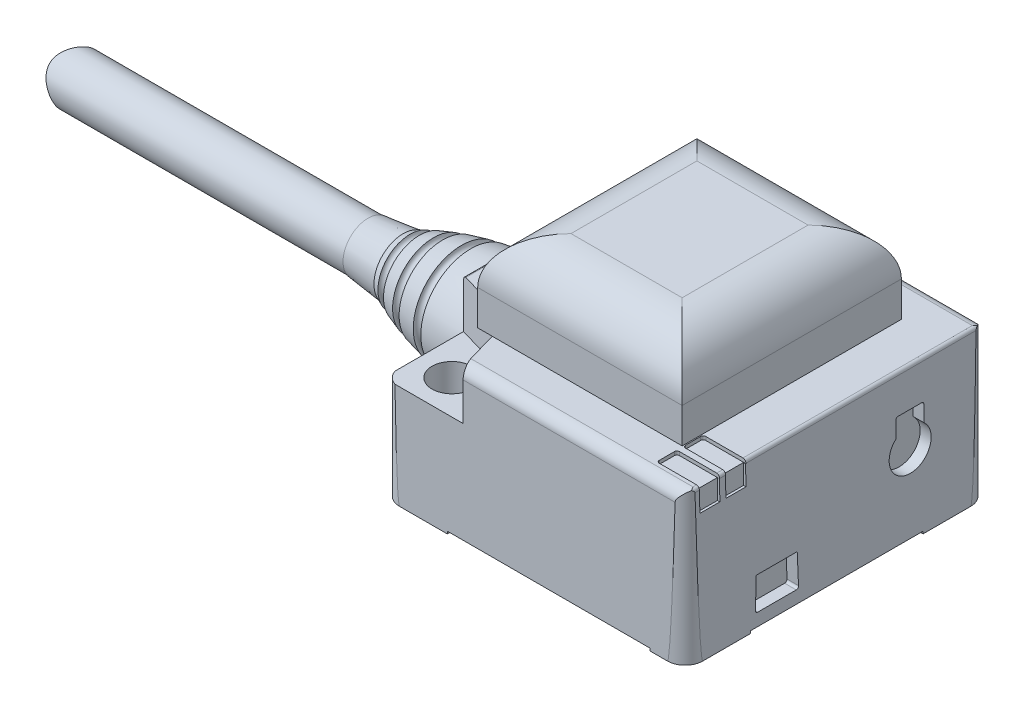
ISO-10303-21;
HEADER;
FILE_DESCRIPTION(('STEP AP214'),'2;1');
FILE_NAME('part.step','',(''),(''),'','','');
FILE_SCHEMA(('AUTOMOTIVE_DESIGN { 1 0 10303 214 1 1 1 1 }'));
ENDSEC;
DATA;
#1=APPLICATION_CONTEXT('core data for automotive mechanical design processes');
#2=APPLICATION_PROTOCOL_DEFINITION('international standard','automotive_design',2000,#1);
#3=PRODUCT_CONTEXT('',#1,'mechanical');
#4=PRODUCT('Part','Part','',(#3));
#5=PRODUCT_RELATED_PRODUCT_CATEGORY('part','',(#4));
#6=PRODUCT_DEFINITION_FORMATION('','',#4);
#7=PRODUCT_DEFINITION_CONTEXT('part definition',#1,'design');
#8=PRODUCT_DEFINITION('design','',#6,#7);
#9=PRODUCT_DEFINITION_SHAPE('','',#8);
#10=(LENGTH_UNIT() NAMED_UNIT(*) SI_UNIT(.MILLI.,.METRE.));
#11=(NAMED_UNIT(*) PLANE_ANGLE_UNIT() SI_UNIT($,.RADIAN.));
#12=(NAMED_UNIT(*) SI_UNIT($,.STERADIAN.) SOLID_ANGLE_UNIT());
#13=UNCERTAINTY_MEASURE_WITH_UNIT(LENGTH_MEASURE(1.E-05),#10,'distance_accuracy_value','');
#14=(GEOMETRIC_REPRESENTATION_CONTEXT(3) GLOBAL_UNCERTAINTY_ASSIGNED_CONTEXT((#13)) GLOBAL_UNIT_ASSIGNED_CONTEXT((#10,
#11,#12)) REPRESENTATION_CONTEXT('',''));
#15=CARTESIAN_POINT('',(0.,0.,0.));
#16=DIRECTION('',(0.,0.,1.));
#17=DIRECTION('',(1.,0.,0.));
#18=AXIS2_PLACEMENT_3D('',#15,#16,#17);
#19=CARTESIAN_POINT('',(-2.,13.,11.9748763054));
#20=DIRECTION('',(0.,1.,0.));
#21=DIRECTION('',(0.,0.,1.));
#22=AXIS2_PLACEMENT_3D('',#19,#20,#21);
#23=PLANE('',#22);
#24=CARTESIAN_POINT('',(3.07764912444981,13.,9.85610631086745));
#25=DIRECTION('',(0.,-1.,0.));
#26=DIRECTION('',(0.,0.,-1.));
#27=AXIS2_PLACEMENT_3D('',#24,#25,#26);
#28=CIRCLE('',#27,2.8);
#29=CARTESIAN_POINT('',(3.84887963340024,13.,7.16441474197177));
#30=VERTEX_POINT('',#29);
#31=CARTESIAN_POINT('',(4.60971792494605,13.,7.51244140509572));
#32=VERTEX_POINT('',#31);
#33=EDGE_CURVE('E1134',#30,#32,#28,.T.);
#34=ORIENTED_EDGE('',*,*,#33,.T.);
#35=DIRECTION('',(0.,0.,1.));
#36=VECTOR('',#35,1.);
#37=CARTESIAN_POINT('',(4.60971792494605,13.,-9.39869217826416));
#38=LINE('',#37,#36);
#39=CARTESIAN_POINT('',(4.60971792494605,13.,5.54738166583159));
#40=VERTEX_POINT('',#39);
#41=EDGE_CURVE('E609',#40,#32,#38,.T.);
#42=ORIENTED_EDGE('',*,*,#41,.F.);
#43=CARTESIAN_POINT('',(44.728,13.,0.));
#44=DIRECTION('',(0.,-1.,0.));
#45=DIRECTION('',(0.,0.,-1.));
#46=AXIS2_PLACEMENT_3D('',#43,#44,#45);
#47=CIRCLE('',#46,40.5);
#48=CARTESIAN_POINT('',(4.60971792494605,13.,-5.54738166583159));
#49=VERTEX_POINT('',#48);
#50=EDGE_CURVE('E953',#40,#49,#47,.T.);
#51=ORIENTED_EDGE('',*,*,#50,.T.);
#52=CARTESIAN_POINT('',(4.60971792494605,13.,-7.5330317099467));
#53=VERTEX_POINT('',#52);
#54=EDGE_CURVE('E615',#53,#49,#38,.T.);
#55=ORIENTED_EDGE('',*,*,#54,.F.);
#56=CARTESIAN_POINT('',(3.14474073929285,13.,-9.92123891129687));
#57=DIRECTION('',(0.,1.,0.));
#58=DIRECTION('',(-1.,0.,0.));
#59=AXIS2_PLACEMENT_3D('',#56,#57,#58);
#60=CIRCLE('',#59,2.80173014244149);
#61=CARTESIAN_POINT('',(3.78990248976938,13.,-7.19480202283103));
#62=VERTEX_POINT('',#61);
#63=EDGE_CURVE('E1148',#53,#62,#60,.F.);
#64=ORIENTED_EDGE('',*,*,#63,.T.);
#65=DIRECTION('',(0.961362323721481,0.,-0.27528618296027));
#66=VECTOR('',#65,1.);
#67=CARTESIAN_POINT('',(0.,13.,-6.10956312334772));
#68=LINE('',#67,#66);
#69=CARTESIAN_POINT('',(0.359655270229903,13.,-6.21255044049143));
#70=VERTEX_POINT('',#69);
#71=EDGE_CURVE('E984',#62,#70,#68,.F.);
#72=ORIENTED_EDGE('',*,*,#71,.T.);
#73=DIRECTION('',(0.,0.,1.));
#74=VECTOR('',#73,1.);
#75=CARTESIAN_POINT('',(0.359655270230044,13.,11.9748763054));
#76=LINE('',#75,#74);
#77=CARTESIAN_POINT('',(0.359655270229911,13.,6.1646730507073));
#78=VERTEX_POINT('',#77);
#79=EDGE_CURVE('E1131',#70,#78,#76,.T.);
#80=ORIENTED_EDGE('',*,*,#79,.T.);
#81=DIRECTION('',(-0.961318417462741,0.,-0.275439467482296));
#82=VECTOR('',#81,1.);
#83=CARTESIAN_POINT('',(0.,13.,6.06162368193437));
#84=LINE('',#83,#82);
#85=EDGE_CURVE('E933',#78,#30,#84,.F.);
#86=ORIENTED_EDGE('',*,*,#85,.T.);
#87=EDGE_LOOP('',(#34,#42,#51,#55,#64,#72,#80,#86));
#88=FACE_BOUND('',#87,.T.);
#89=ADVANCED_FACE('F36',(#88),#23,.T.);
#90=CARTESIAN_POINT('',(-2.,13.,11.9748763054));
#91=DIRECTION('',(0.,1.,0.));
#92=DIRECTION('',(0.,0.,1.));
#93=AXIS2_PLACEMENT_3D('',#90,#91,#92);
#94=PLANE('',#93);
#95=DIRECTION('',(-0.275439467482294,0.,0.961318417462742));
#96=VECTOR('',#95,1.);
#97=CARTESIAN_POINT('',(6.64565775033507,13.,-11.97837534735));
#98=LINE('',#97,#96);
#99=CARTESIAN_POINT('',(6.64565775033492,13.,-11.9783753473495));
#100=VERTEX_POINT('',#99);
#101=CARTESIAN_POINT('',(5.90652018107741,13.,-9.39869217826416));
#102=VERTEX_POINT('',#101);
#103=EDGE_CURVE('E605',#100,#102,#98,.T.);
#104=ORIENTED_EDGE('',*,*,#103,.T.);
#105=DIRECTION('',(-1.,0.,0.));
#106=VECTOR('',#105,1.);
#107=CARTESIAN_POINT('',(22.1406463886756,13.,-9.39869217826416));
#108=LINE('',#107,#106);
#109=CARTESIAN_POINT('',(22.1406463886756,13.,-9.39869217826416));
#110=VERTEX_POINT('',#109);
#111=EDGE_CURVE('E587',#110,#102,#108,.T.);
#112=ORIENTED_EDGE('',*,*,#111,.F.);
#113=DIRECTION('',(0.,0.,-1.));
#114=VECTOR('',#113,1.);
#115=CARTESIAN_POINT('',(22.1406463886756,13.,-9.39869217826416));
#116=LINE('',#115,#114);
#117=CARTESIAN_POINT('',(22.1406463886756,13.,9.39520143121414));
#118=VERTEX_POINT('',#117);
#119=EDGE_CURVE('E593',#118,#110,#116,.T.);
#120=ORIENTED_EDGE('',*,*,#119,.F.);
#121=DIRECTION('',(-1.,0.,0.));
#122=VECTOR('',#121,1.);
#123=CARTESIAN_POINT('',(-2.,13.,9.39520143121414));
#124=LINE('',#123,#122);
#125=CARTESIAN_POINT('',(5.85820250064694,13.,9.39520143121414));
#126=VERTEX_POINT('',#125);
#127=EDGE_CURVE('E1472',#118,#126,#124,.T.);
#128=ORIENTED_EDGE('',*,*,#127,.T.);
#129=DIRECTION('',(0.27528618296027,0.,0.961362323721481));
#130=VECTOR('',#129,1.);
#131=CARTESIAN_POINT('',(5.76946363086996,13.,9.08530499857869));
#132=LINE('',#131,#130);
#133=CARTESIAN_POINT('',(6.59689261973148,13.,11.9748763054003));
#134=VERTEX_POINT('',#133);
#135=EDGE_CURVE('E638',#126,#134,#132,.T.);
#136=ORIENTED_EDGE('',*,*,#135,.T.);
#137=DIRECTION('',(1.,0.,0.));
#138=VECTOR('',#137,1.);
#139=CARTESIAN_POINT('',(-2.,13.,11.9748763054));
#140=LINE('',#139,#138);
#141=CARTESIAN_POINT('',(25.6406463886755,13.,11.9748763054));
#142=VERTEX_POINT('',#141);
#143=EDGE_CURVE('E637',#134,#142,#140,.T.);
#144=ORIENTED_EDGE('',*,*,#143,.T.);
#145=DIRECTION('',(0.,0.,1.));
#146=VECTOR('',#145,1.);
#147=CARTESIAN_POINT('',(25.6406463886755,13.,11.9748763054));
#148=LINE('',#147,#146);
#149=CARTESIAN_POINT('',(25.6406463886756,13.,11.6657083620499));
#150=VERTEX_POINT('',#149);
#151=EDGE_CURVE('E633',#142,#150,#148,.F.);
#152=ORIENTED_EDGE('',*,*,#151,.T.);
#153=DIRECTION('',(1.,0.,0.));
#154=VECTOR('',#153,1.);
#155=CARTESIAN_POINT('',(-2.,13.,11.6657083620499));
#156=LINE('',#155,#154);
#157=CARTESIAN_POINT('',(22.44830089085,13.,11.66570836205));
#158=VERTEX_POINT('',#157);
#159=EDGE_CURVE('E630',#150,#158,#156,.F.);
#160=ORIENTED_EDGE('',*,*,#159,.T.);
#161=CARTESIAN_POINT('',(22.44830089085,13.,11.44820836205));
#162=DIRECTION('',(0.,-1.,0.));
#163=DIRECTION('',(0.,0.,-1.));
#164=AXIS2_PLACEMENT_3D('',#161,#162,#163);
#165=CIRCLE('',#164,0.2175);
#166=CARTESIAN_POINT('',(22.23080089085,13.,11.44820836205));
#167=VERTEX_POINT('',#166);
#168=EDGE_CURVE('E629',#158,#167,#165,.T.);
#169=ORIENTED_EDGE('',*,*,#168,.T.);
#170=DIRECTION('',(0.,0.,1.));
#171=VECTOR('',#170,1.);
#172=CARTESIAN_POINT('',(22.23080089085,13.,11.9748763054));
#173=LINE('',#172,#171);
#174=CARTESIAN_POINT('',(22.23080089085,13.,10.1483008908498));
#175=VERTEX_POINT('',#174);
#176=EDGE_CURVE('E625',#167,#175,#173,.F.);
#177=ORIENTED_EDGE('',*,*,#176,.T.);
#178=CARTESIAN_POINT('',(22.44830089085,13.,10.1483008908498));
#179=DIRECTION('',(0.,-1.,0.));
#180=DIRECTION('',(0.,0.,-1.));
#181=AXIS2_PLACEMENT_3D('',#178,#179,#180);
#182=CIRCLE('',#181,0.2175);
#183=CARTESIAN_POINT('',(22.44830089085,13.,9.93080089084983));
#184=VERTEX_POINT('',#183);
#185=EDGE_CURVE('E628',#175,#184,#182,.T.);
#186=ORIENTED_EDGE('',*,*,#185,.T.);
#187=DIRECTION('',(1.,0.,0.));
#188=VECTOR('',#187,1.);
#189=CARTESIAN_POINT('',(-2.,13.,9.93080089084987));
#190=LINE('',#189,#188);
#191=CARTESIAN_POINT('',(25.6406463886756,13.,9.93080089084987));
#192=VERTEX_POINT('',#191);
#193=EDGE_CURVE('E659',#184,#192,#190,.T.);
#194=ORIENTED_EDGE('',*,*,#193,.T.);
#195=DIRECTION('',(0.,0.,1.));
#196=VECTOR('',#195,1.);
#197=CARTESIAN_POINT('',(25.6406463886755,13.,11.9748763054));
#198=LINE('',#197,#196);
#199=CARTESIAN_POINT('',(25.6406463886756,13.,9.41570836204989));
#200=VERTEX_POINT('',#199);
#201=EDGE_CURVE('E658',#192,#200,#198,.F.);
#202=ORIENTED_EDGE('',*,*,#201,.T.);
#203=DIRECTION('',(1.,0.,0.));
#204=VECTOR('',#203,1.);
#205=CARTESIAN_POINT('',(-2.,13.,9.4157083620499));
#206=LINE('',#205,#204);
#207=CARTESIAN_POINT('',(22.44830089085,13.,9.41570836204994));
#208=VERTEX_POINT('',#207);
#209=EDGE_CURVE('E655',#200,#208,#206,.F.);
#210=ORIENTED_EDGE('',*,*,#209,.T.);
#211=CARTESIAN_POINT('',(22.44830089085,13.,9.19820836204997));
#212=DIRECTION('',(0.,-1.,0.));
#213=DIRECTION('',(0.,0.,-1.));
#214=AXIS2_PLACEMENT_3D('',#211,#212,#213);
#215=CIRCLE('',#214,0.2175);
#216=CARTESIAN_POINT('',(22.23080089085,13.,9.19820836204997));
#217=VERTEX_POINT('',#216);
#218=EDGE_CURVE('E654',#208,#217,#215,.T.);
#219=ORIENTED_EDGE('',*,*,#218,.T.);
#220=DIRECTION('',(0.,0.,1.));
#221=VECTOR('',#220,1.);
#222=CARTESIAN_POINT('',(22.23080089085,13.,11.9748763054));
#223=LINE('',#222,#221);
#224=CARTESIAN_POINT('',(22.23080089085,13.,7.89830089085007));
#225=VERTEX_POINT('',#224);
#226=EDGE_CURVE('E651',#217,#225,#223,.F.);
#227=ORIENTED_EDGE('',*,*,#226,.T.);
#228=CARTESIAN_POINT('',(22.4483008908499,13.,7.89830089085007));
#229=DIRECTION('',(0.,-1.,0.));
#230=DIRECTION('',(0.,0.,-1.));
#231=AXIS2_PLACEMENT_3D('',#228,#229,#230);
#232=CIRCLE('',#231,0.2175);
#233=CARTESIAN_POINT('',(22.4483008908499,13.,7.68080089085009));
#234=VERTEX_POINT('',#233);
#235=EDGE_CURVE('E650',#225,#234,#232,.T.);
#236=ORIENTED_EDGE('',*,*,#235,.T.);
#237=DIRECTION('',(1.,0.,0.));
#238=VECTOR('',#237,1.);
#239=CARTESIAN_POINT('',(-2.,13.,7.68080089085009));
#240=LINE('',#239,#238);
#241=CARTESIAN_POINT('',(25.6406463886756,13.,7.68080089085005));
#242=VERTEX_POINT('',#241);
#243=EDGE_CURVE('E646',#234,#242,#240,.T.);
#244=ORIENTED_EDGE('',*,*,#243,.T.);
#245=DIRECTION('',(0.,0.,1.));
#246=VECTOR('',#245,1.);
#247=CARTESIAN_POINT('',(25.6406463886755,13.,11.9748763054));
#248=LINE('',#247,#246);
#249=CARTESIAN_POINT('',(25.6406463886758,13.,-11.9783753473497));
#250=VERTEX_POINT('',#249);
#251=EDGE_CURVE('E649',#242,#250,#248,.F.);
#252=ORIENTED_EDGE('',*,*,#251,.T.);
#253=DIRECTION('',(1.,0.,0.));
#254=VECTOR('',#253,1.);
#255=CARTESIAN_POINT('',(-2.,13.,-11.97837534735));
#256=LINE('',#255,#254);
#257=EDGE_CURVE('E707',#250,#100,#256,.F.);
#258=ORIENTED_EDGE('',*,*,#257,.T.);
#259=EDGE_LOOP('',(#104,#112,#120,#128,#136,#144,#152,#160,#169,#177,#186,#194,#202,#210,#219,
#227,#236,#244,#252,#258));
#260=FACE_BOUND('',#259,.T.);
#261=ADVANCED_FACE('F602',(#260),#94,.T.);
#262=CARTESIAN_POINT('',(-42.1424285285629,4.9,0.));
#263=DIRECTION('',(0.,0.707106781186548,-0.707106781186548));
#264=DIRECTION('',(0.,0.707106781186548,0.707106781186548));
#265=AXIS2_PLACEMENT_3D('',#262,#263,#264);
#266=CYLINDRICAL_SURFACE('',#265,3.);
#267=CARTESIAN_POINT('',(-39.1424285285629,3.41509356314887,1.48490643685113));
#268=CARTESIAN_POINT('',(-39.1424232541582,3.34124918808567,1.41107013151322));
#269=CARTESIAN_POINT('',(-39.1479241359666,3.27296962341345,1.33171022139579));
#270=CARTESIAN_POINT('',(-39.1693738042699,3.14949189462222,1.16464929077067));
#271=CARTESIAN_POINT('',(-39.1853269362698,3.09429918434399,1.07694481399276));
#272=CARTESIAN_POINT('',(-39.2261350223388,2.99829043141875,0.896550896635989));
#273=CARTESIAN_POINT('',(-39.2509486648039,2.95740938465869,0.803886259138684));
#274=CARTESIAN_POINT('',(-39.3075323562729,2.88981300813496,0.61566514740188));
#275=CARTESIAN_POINT('',(-39.3392998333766,2.86309245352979,0.520109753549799));
#276=CARTESIAN_POINT('',(-39.3985028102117,2.82876155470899,0.353614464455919));
#277=CARTESIAN_POINT('',(-39.4248323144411,2.81795444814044,0.282910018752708));
#278=CARTESIAN_POINT('',(-39.4792005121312,2.80358668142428,0.141422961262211));
#279=CARTESIAN_POINT('',(-39.5072394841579,2.80002720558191,0.0706403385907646));
#280=CARTESIAN_POINT('',(-39.5834346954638,2.80002177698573,-0.118504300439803));
#281=CARTESIAN_POINT('',(-39.6323490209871,2.81002992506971,-0.236608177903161));
#282=CARTESIAN_POINT('',(-39.7278249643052,2.8499850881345,-0.470570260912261));
#283=CARTESIAN_POINT('',(-39.7743840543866,2.87995305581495,-0.586425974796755));
#284=CARTESIAN_POINT('',(-39.8501952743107,2.95197521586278,-0.790033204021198));
#285=CARTESIAN_POINT('',(-39.8810263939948,2.99014584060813,-0.878557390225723));
#286=CARTESIAN_POINT('',(-39.933837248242,3.07961793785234,-1.05144645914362));
#287=CARTESIAN_POINT('',(-39.9558355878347,3.13089143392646,-1.13581975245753));
#288=CARTESIAN_POINT('',(-39.9876009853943,3.24690703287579,-1.29895215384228));
#289=CARTESIAN_POINT('',(-39.9972292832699,3.311792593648,-1.37763838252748));
#290=CARTESIAN_POINT('',(-40.0016882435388,3.45260170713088,-1.52489069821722));
#291=CARTESIAN_POINT('',(-39.9965264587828,3.52851960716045,-1.59346193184));
#292=CARTESIAN_POINT('',(-39.9745069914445,3.67542576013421,-1.70810094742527));
#293=CARTESIAN_POINT('',(-39.9596199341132,3.74530651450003,-1.75601206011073));
#294=CARTESIAN_POINT('',(-39.9222344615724,3.88878781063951,-1.84238058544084));
#295=CARTESIAN_POINT('',(-39.8997279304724,3.9623922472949,-1.88082784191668));
#296=CARTESIAN_POINT('',(-39.8377134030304,4.14678775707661,-1.96393029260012));
#297=CARTESIAN_POINT('',(-39.7951625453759,4.25898466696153,-2.0031865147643));
#298=CARTESIAN_POINT('',(-39.705017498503,4.48648995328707,-2.06222285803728));
#299=CARTESIAN_POINT('',(-39.657413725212,4.60180392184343,-2.08196520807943));
#300=CARTESIAN_POINT('',(-39.5612682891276,4.83635045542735,-2.10236859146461));
#301=CARTESIAN_POINT('',(-39.5127261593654,4.95561575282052,-2.10265616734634));
#302=CARTESIAN_POINT('',(-39.420125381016,5.1941153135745,-2.08270705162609));
#303=CARTESIAN_POINT('',(-39.3760610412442,5.3133494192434,-2.06249678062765));
#304=CARTESIAN_POINT('',(-39.3027382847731,5.53075039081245,-2.00564726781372));
#305=CARTESIAN_POINT('',(-39.272242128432,5.62929639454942,-1.97207075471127));
#306=CARTESIAN_POINT('',(-39.219740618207,5.82211245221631,-1.88959028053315));
#307=CARTESIAN_POINT('',(-39.1977224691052,5.91638875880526,-1.84070962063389));
#308=CARTESIAN_POINT('',(-39.1683315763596,6.07494471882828,-1.74235374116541));
#309=CARTESIAN_POINT('',(-39.158670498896,6.14081642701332,-1.69610380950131));
#310=CARTESIAN_POINT('',(-39.1457168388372,6.26719457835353,-1.59598604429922));
#311=CARTESIAN_POINT('',(-39.1424242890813,6.32770099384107,-1.54211817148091));
#312=CARTESIAN_POINT('',(-39.1424339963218,6.45868563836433,-1.41111912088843));
#313=CARTESIAN_POINT('',(-39.1479232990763,6.52697404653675,-1.33176967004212));
#314=CARTESIAN_POINT('',(-39.169360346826,6.65048217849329,-1.16470114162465));
#315=CARTESIAN_POINT('',(-39.1853193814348,6.70568770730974,-1.07697311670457));
#316=CARTESIAN_POINT('',(-39.226136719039,6.80170891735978,-0.896548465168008));
#317=CARTESIAN_POINT('',(-39.2509511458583,6.84259360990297,-0.803878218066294));
#318=CARTESIAN_POINT('',(-39.3075350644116,6.91019019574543,-0.615655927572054));
#319=CARTESIAN_POINT('',(-39.3393013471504,6.93690860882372,-0.52010523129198));
#320=CARTESIAN_POINT('',(-39.3985027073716,6.97123825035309,-0.353614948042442));
#321=CARTESIAN_POINT('',(-39.4248320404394,6.98204544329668,-0.282910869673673));
#322=CARTESIAN_POINT('',(-39.479200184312,6.99641326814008,-0.141423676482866));
#323=CARTESIAN_POINT('',(-39.5072392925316,6.99997263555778,-0.070640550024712));
#324=CARTESIAN_POINT('',(-39.5834321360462,6.99997848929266,0.118497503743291));
#325=CARTESIAN_POINT('',(-39.6323439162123,6.98997256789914,0.236593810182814));
#326=CARTESIAN_POINT('',(-39.7278195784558,6.95001680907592,0.470558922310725));
#327=CARTESIAN_POINT('',(-39.7743806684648,6.92004382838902,0.586424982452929));
#328=CARTESIAN_POINT('',(-39.8502162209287,6.8480098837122,0.790083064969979));
#329=CARTESIAN_POINT('',(-39.8810663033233,6.80982242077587,0.878649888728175));
#330=CARTESIAN_POINT('',(-39.9338611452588,6.72030583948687,1.05156268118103));
#331=CARTESIAN_POINT('',(-39.955835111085,6.66902074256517,1.13592167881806));
#332=CARTESIAN_POINT('',(-39.9808592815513,6.57776777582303,1.26426889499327));
#333=CARTESIAN_POINT('',(-39.987978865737,6.54195849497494,1.31046073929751));
#334=CARTESIAN_POINT('',(-39.9975366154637,6.46631739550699,1.39998992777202));
#335=CARTESIAN_POINT('',(-39.9999742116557,6.42648508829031,1.44332692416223));
#336=CARTESIAN_POINT('',(-39.9999762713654,6.34927013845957,1.52054347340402));
#337=CARTESIAN_POINT('',(-39.9981874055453,6.31235099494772,1.55488948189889));
#338=CARTESIAN_POINT('',(-39.9911430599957,6.23632637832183,1.62069703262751));
#339=CARTESIAN_POINT('',(-39.9858861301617,6.19721999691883,1.6521573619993));
#340=CARTESIAN_POINT('',(-39.9652579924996,6.07708525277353,1.74193591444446));
#341=CARTESIAN_POINT('',(-39.9450303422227,5.99332142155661,1.7955721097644));
#342=CARTESIAN_POINT('',(-39.8954111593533,5.82248127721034,1.88900610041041));
#343=CARTESIAN_POINT('',(-39.8661245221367,5.73545242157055,1.92895179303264));
#344=CARTESIAN_POINT('',(-39.8018860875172,5.55873400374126,1.99622131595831));
#345=CARTESIAN_POINT('',(-39.7669338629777,5.46904424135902,2.02354419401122));
#346=CARTESIAN_POINT('',(-39.6879880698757,5.27200880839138,2.0696530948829));
#347=CARTESIAN_POINT('',(-39.6434832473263,5.1643225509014,2.08610518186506));
#348=CARTESIAN_POINT('',(-39.5547048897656,4.94749671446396,2.10225317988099));
#349=CARTESIAN_POINT('',(-39.5104316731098,4.83835563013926,2.10193012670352));
#350=CARTESIAN_POINT('',(-39.4184715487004,4.60175899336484,2.08261153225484));
#351=CARTESIAN_POINT('',(-39.3714404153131,4.47427463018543,2.0605212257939));
#352=CARTESIAN_POINT('',(-39.2875053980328,4.22253097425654,1.99195200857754));
#353=CARTESIAN_POINT('',(-39.2505877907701,4.09826752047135,1.94550639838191));
#354=CARTESIAN_POINT('',(-39.195844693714,3.87560526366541,1.83671780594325));
#355=CARTESIAN_POINT('',(-39.1760142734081,3.77608460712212,1.77770157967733));
#356=CARTESIAN_POINT('',(-39.149317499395,3.5870988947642,1.64304431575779));
#357=CARTESIAN_POINT('',(-39.1424344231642,3.4976210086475,1.56742486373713));
#358=CARTESIAN_POINT('',(-39.1424285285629,3.41509356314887,1.48490643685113));
#359=B_SPLINE_CURVE_WITH_KNOTS('',3,(#267,#268,#269,#270,#271,#272,#273,#274,#275,#276,#277,
#278,#279,#280,#281,#282,#283,#284,#285,#286,#287,#288,#289,#290,#291,#292,#293,#294,#295,#296,
#297,#298,#299,#300,#301,#302,#303,#304,#305,#306,#307,#308,#309,#310,#311,#312,#313,#314,#315,
#316,#317,#318,#319,#320,#321,#322,#323,#324,#325,#326,#327,#328,#329,#330,#331,#332,#333,#334,
#335,#336,#337,#338,#339,#340,#341,#342,#343,#344,#345,#346,#347,#348,#349,#350,#351,#352,#353,
#354,#355,#356,#357,#358),.UNSPECIFIED.,.T.,.F.,(4,2,2,2,2,2,2,2,2,2,2,2,2,2,2,2,2,2,2,2,2,2,2,
2,2,2,2,2,2,2,2,2,2,2,2,2,2,2,2,2,2,2,2,2,2,4),(0.,0.312808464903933,0.625747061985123,
0.937245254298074,1.24862843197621,1.47692256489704,1.70525399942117,2.08829657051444,
2.47174187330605,2.77429308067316,3.07620361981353,3.38147206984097,3.68658465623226,
3.94363108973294,4.20095218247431,4.57768697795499,4.95514956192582,5.3398559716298,
5.72406714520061,6.04820669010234,6.37185509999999,6.61431254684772,6.85677124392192,
7.16947591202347,7.4825183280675,7.79403075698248,8.10539969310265,8.33369256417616,
8.562025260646,8.94504683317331,9.32851312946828,9.63124626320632,9.93297499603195,
10.10926774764,10.2855819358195,10.4366975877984,10.5878764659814,10.8905672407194,
11.1898766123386,11.4892085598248,11.8409768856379,12.193142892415,12.6038449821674,
13.0139869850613,13.3640297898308,13.713620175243),.UNSPECIFIED.);
#360=CARTESIAN_POINT('',(-39.1424285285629,3.41509356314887,1.48490643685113));
#361=VERTEX_POINT('',#360);
#362=EDGE_CURVE('E624',#361,#361,#359,.T.);
#363=ORIENTED_EDGE('',*,*,#362,.F.);
#364=EDGE_LOOP('',(#363));
#365=FACE_BOUND('',#364,.T.);
#366=ADVANCED_FACE('F1701',(#365),#266,.F.);
#367=CARTESIAN_POINT('',(-27.0909984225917,4.9,0.));
#368=DIRECTION('',(-1.,0.,0.));
#369=DIRECTION('',(0.,0.,1.));
#370=AXIS2_PLACEMENT_3D('',#367,#368,#369);
#371=CYLINDRICAL_SURFACE('',#370,2.09997482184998);
#372=CARTESIAN_POINT('',(-14.1819968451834,4.9,0.));
#373=DIRECTION('',(-1.,0.,0.));
#374=DIRECTION('',(0.,0.,1.));
#375=AXIS2_PLACEMENT_3D('',#372,#373,#374);
#376=CIRCLE('',#375,2.09997482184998);
#377=CARTESIAN_POINT('',(-14.1819968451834,4.9,2.09997482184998));
#378=VERTEX_POINT('',#377);
#379=EDGE_CURVE('E1691',#378,#378,#376,.F.);
#380=ORIENTED_EDGE('',*,*,#379,.F.);
#381=EDGE_LOOP('',(#380));
#382=FACE_BOUND('',#381,.T.);
#383=ORIENTED_EDGE('',*,*,#362,.T.);
#384=EDGE_LOOP('',(#383));
#385=FACE_BOUND('',#384,.T.);
#386=ADVANCED_FACE('F1704',(#382,#385),#371,.T.);
#387=CARTESIAN_POINT('',(-14.1819968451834,7.02497482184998,0.));
#388=DIRECTION('',(-1.,0.,0.));
#389=DIRECTION('',(0.,0.,1.));
#390=AXIS2_PLACEMENT_3D('',#387,#388,#389);
#391=PLANE('',#390);
#392=ORIENTED_EDGE('',*,*,#379,.T.);
#393=EDGE_LOOP('',(#392));
#394=FACE_BOUND('',#393,.T.);
#395=CARTESIAN_POINT('',(-14.1819968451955,4.9,0.));
#396=DIRECTION('',(1.,0.,0.));
#397=DIRECTION('',(0.,0.,-1.));
#398=AXIS2_PLACEMENT_3D('',#395,#396,#397);
#399=CIRCLE('',#398,2.14997482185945);
#400=CARTESIAN_POINT('',(-14.1819968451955,4.9,-2.14997482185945));
#401=VERTEX_POINT('',#400);
#402=EDGE_CURVE('E1463',#401,#401,#399,.T.);
#403=ORIENTED_EDGE('',*,*,#402,.F.);
#404=EDGE_LOOP('',(#403));
#405=FACE_BOUND('',#404,.T.);
#406=ADVANCED_FACE('F1708',(#394,#405),#391,.T.);
#407=CARTESIAN_POINT('',(-11.1819956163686,4.9,0.));
#408=DIRECTION('',(1.,0.,0.));
#409=DIRECTION('',(0.,0.,-1.));
#410=AXIS2_PLACEMENT_3D('',#407,#408,#409);
#411=CONICAL_SURFACE('',#410,2.49997496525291,0.11614162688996);
#412=CARTESIAN_POINT('',(-11.181995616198,4.9,0.));
#413=DIRECTION('',(1.,0.,0.));
#414=DIRECTION('',(0.,1.,0.));
#415=AXIS2_PLACEMENT_3D('',#412,#413,#414);
#416=CIRCLE('',#415,2.49997496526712);
#417=CARTESIAN_POINT('',(-11.181995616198,7.39997496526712,0.));
#418=VERTEX_POINT('',#417);
#419=EDGE_CURVE('E1458',#418,#418,#416,.T.);
#420=ORIENTED_EDGE('',*,*,#419,.F.);
#421=EDGE_LOOP('',(#420));
#422=FACE_BOUND('',#421,.T.);
#423=ORIENTED_EDGE('',*,*,#402,.T.);
#424=EDGE_LOOP('',(#423));
#425=FACE_BOUND('',#424,.T.);
#426=ADVANCED_FACE('F1712',(#422,#425),#411,.T.);
#427=CARTESIAN_POINT('',(-10.577211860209,4.9,0.));
#428=DIRECTION('',(1.,0.,0.));
#429=DIRECTION('',(0.,0.,-1.));
#430=AXIS2_PLACEMENT_3D('',#427,#428,#429);
#431=CONICAL_SURFACE('',#430,2.76349206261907,0.410916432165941);
#432=CARTESIAN_POINT('',(-10.5772118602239,4.9,0.));
#433=DIRECTION('',(1.,0.,0.));
#434=DIRECTION('',(0.,0.,-1.));
#435=AXIS2_PLACEMENT_3D('',#432,#433,#434);
#436=CIRCLE('',#435,2.76349206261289);
#437=CARTESIAN_POINT('',(-10.5772118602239,4.9,-2.76349206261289));
#438=VERTEX_POINT('',#437);
#439=EDGE_CURVE('E1456',#438,#438,#436,.F.);
#440=ORIENTED_EDGE('',*,*,#439,.T.);
#441=EDGE_LOOP('',(#440));
#442=FACE_BOUND('',#441,.T.);
#443=ORIENTED_EDGE('',*,*,#419,.T.);
#444=EDGE_LOOP('',(#443));
#445=FACE_BOUND('',#444,.T.);
#446=ADVANCED_FACE('F1715',(#442,#445),#431,.T.);
#447=CARTESIAN_POINT('',(-10.1820067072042,4.9,0.));
#448=DIRECTION('',(1.,0.,0.));
#449=DIRECTION('',(0.,0.,-1.));
#450=AXIS2_PLACEMENT_3D('',#447,#448,#449);
#451=TOROIDAL_SURFACE('',#450,2.82530449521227,0.400009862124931);
#452=ORIENTED_EDGE('',*,*,#439,.F.);
#453=EDGE_LOOP('',(#452));
#454=FACE_BOUND('',#453,.T.);
#455=CARTESIAN_POINT('',(-9.78199684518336,4.9,0.));
#456=DIRECTION('',(-1.,0.,0.));
#457=DIRECTION('',(0.,1.,0.));
#458=AXIS2_PLACEMENT_3D('',#455,#456,#457);
#459=CIRCLE('',#458,2.82529536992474);
#460=CARTESIAN_POINT('',(-9.7819968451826,4.9,-2.82529536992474));
#461=VERTEX_POINT('',#460);
#462=CARTESIAN_POINT('',(-9.78199684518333,7.72529536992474,0.));
#463=VERTEX_POINT('',#462);
#464=EDGE_CURVE('E1403',#461,#463,#459,.F.);
#465=ORIENTED_EDGE('',*,*,#464,.F.);
#466=CARTESIAN_POINT('',(-9.78199684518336,4.9,0.));
#467=DIRECTION('',(-1.,0.,0.));
#468=DIRECTION('',(0.,0.,-1.));
#469=AXIS2_PLACEMENT_3D('',#466,#467,#468);
#470=CIRCLE('',#469,2.82529536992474);
#471=CARTESIAN_POINT('',(-9.78199684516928,4.9,2.82529609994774));
#472=VERTEX_POINT('',#471);
#473=EDGE_CURVE('E1444',#472,#461,#470,.F.);
#474=ORIENTED_EDGE('',*,*,#473,.F.);
#475=CARTESIAN_POINT('',(-9.78199684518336,4.9,0.));
#476=DIRECTION('',(-1.,0.,0.));
#477=DIRECTION('',(0.,0.,1.));
#478=AXIS2_PLACEMENT_3D('',#475,#476,#477);
#479=CIRCLE('',#478,2.82529536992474);
#480=EDGE_CURVE('E1453',#463,#472,#479,.F.);
#481=ORIENTED_EDGE('',*,*,#480,.F.);
#482=EDGE_LOOP('',(#465,#474,#481));
#483=FACE_BOUND('',#482,.T.);
#484=ADVANCED_FACE('F1422',(#454,#483),#451,.F.);
#485=CARTESIAN_POINT('',(-9.78199684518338,7.85307420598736,0.));
#486=DIRECTION('',(-1.,-6.46434069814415E-13,0.));
#487=DIRECTION('',(6.46434069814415E-13,-1.,0.));
#488=AXIS2_PLACEMENT_3D('',#485,#486,#487);
#489=PLANE('',#488);
#490=ORIENTED_EDGE('',*,*,#473,.T.);
#491=ORIENTED_EDGE('',*,*,#464,.T.);
#492=ORIENTED_EDGE('',*,*,#480,.T.);
#493=EDGE_LOOP('',(#490,#491,#492));
#494=FACE_BOUND('',#493,.T.);
#495=CARTESIAN_POINT('',(-9.78199684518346,4.9,0.));
#496=DIRECTION('',(1.,0.,0.));
#497=DIRECTION('',(0.,0.,-1.));
#498=AXIS2_PLACEMENT_3D('',#495,#496,#497);
#499=CIRCLE('',#498,3.08085304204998);
#500=CARTESIAN_POINT('',(-9.78199684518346,4.9,-3.08085304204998));
#501=VERTEX_POINT('',#500);
#502=EDGE_CURVE('E1398',#501,#501,#499,.T.);
#503=ORIENTED_EDGE('',*,*,#502,.F.);
#504=EDGE_LOOP('',(#503));
#505=FACE_BOUND('',#504,.T.);
#506=ADVANCED_FACE('F1417',(#494,#505),#489,.T.);
#507=CARTESIAN_POINT('',(-1.27568088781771,4.9,19.3793491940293));
#508=DIRECTION('',(0.,1.,0.));
#509=DIRECTION('',(0.,0.,-1.));
#510=AXIS2_PLACEMENT_3D('',#507,#508,#509);
#511=CIRCLE('',#510,24.0170376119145);
#512=TRIMMED_CURVE('',#511,(PARAMETER_VALUE(-0.631911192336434)),
(PARAMETER_VALUE(0.631911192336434)),.T.,.PARAMETER.);
#513=CARTESIAN_POINT('',(-1.27568088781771,4.9,0.));
#514=DIRECTION('',(1.,0.,0.));
#515=AXIS1_PLACEMENT('',#513,#514);
#516=SURFACE_OF_REVOLUTION('',#512,#515);
#517=ORIENTED_EDGE('',*,*,#502,.T.);
#518=EDGE_LOOP('',(#517));
#519=FACE_BOUND('',#518,.T.);
#520=CARTESIAN_POINT('',(-8.58129666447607,4.9,0.));
#521=DIRECTION('',(1.,0.,0.));
#522=DIRECTION('',(0.,0.,-1.));
#523=AXIS2_PLACEMENT_3D('',#520,#521,#522);
#524=CIRCLE('',#523,3.49959470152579);
#525=CARTESIAN_POINT('',(-8.58129666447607,4.9,-3.49959470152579));
#526=VERTEX_POINT('',#525);
#527=EDGE_CURVE('E1396',#526,#526,#524,.F.);
#528=ORIENTED_EDGE('',*,*,#527,.T.);
#529=EDGE_LOOP('',(#528));
#530=FACE_BOUND('',#529,.T.);
#531=ADVANCED_FACE('F1414',(#519,#530),#516,.F.);
#532=CARTESIAN_POINT('',(-8.18199173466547,4.9,0.));
#533=DIRECTION('',(1.,0.,0.));
#534=DIRECTION('',(0.,0.,-1.));
#535=AXIS2_PLACEMENT_3D('',#532,#533,#534);
#536=TOROIDAL_SURFACE('',#535,3.52327058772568,0.400006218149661);
#537=ORIENTED_EDGE('',*,*,#527,.F.);
#538=EDGE_LOOP('',(#537));
#539=FACE_BOUND('',#538,.T.);
#540=CARTESIAN_POINT('',(-7.78199684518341,4.9,0.));
#541=DIRECTION('',(-1.,0.,0.));
#542=DIRECTION('',(0.,1.,0.));
#543=AXIS2_PLACEMENT_3D('',#540,#541,#542);
#544=CIRCLE('',#543,3.52628106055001);
#545=CARTESIAN_POINT('',(-7.78199684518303,4.9,-3.52628106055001));
#546=VERTEX_POINT('',#545);
#547=CARTESIAN_POINT('',(-7.78199684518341,8.42628106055,0.));
#548=VERTEX_POINT('',#547);
#549=EDGE_CURVE('E1347',#546,#548,#544,.F.);
#550=ORIENTED_EDGE('',*,*,#549,.F.);
#551=CARTESIAN_POINT('',(-7.78199684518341,4.9,0.));
#552=DIRECTION('',(-1.,0.,0.));
#553=DIRECTION('',(0.,0.,-1.));
#554=AXIS2_PLACEMENT_3D('',#551,#552,#553);
#555=CIRCLE('',#554,3.52628106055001);
#556=CARTESIAN_POINT('',(-7.78199684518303,4.9,3.52628106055));
#557=VERTEX_POINT('',#556);
#558=EDGE_CURVE('E1393',#557,#546,#555,.F.);
#559=ORIENTED_EDGE('',*,*,#558,.F.);
#560=CARTESIAN_POINT('',(-7.78199684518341,4.9,0.));
#561=DIRECTION('',(-1.,0.,0.));
#562=DIRECTION('',(0.,0.,1.));
#563=AXIS2_PLACEMENT_3D('',#560,#561,#562);
#564=CIRCLE('',#563,3.52628106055);
#565=EDGE_CURVE('E1359',#548,#557,#564,.F.);
#566=ORIENTED_EDGE('',*,*,#565,.F.);
#567=EDGE_LOOP('',(#550,#559,#566));
#568=FACE_BOUND('',#567,.T.);
#569=ADVANCED_FACE('F1375',(#539,#568),#536,.F.);
#570=CARTESIAN_POINT('',(-7.78199684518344,8.53292105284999,0.));
#571=DIRECTION('',(-1.,-2.66520175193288E-13,0.));
#572=DIRECTION('',(2.66520175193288E-13,-1.,0.));
#573=AXIS2_PLACEMENT_3D('',#570,#571,#572);
#574=PLANE('',#573);
#575=ORIENTED_EDGE('',*,*,#558,.T.);
#576=ORIENTED_EDGE('',*,*,#549,.T.);
#577=ORIENTED_EDGE('',*,*,#565,.T.);
#578=EDGE_LOOP('',(#575,#576,#577));
#579=FACE_BOUND('',#578,.T.);
#580=CARTESIAN_POINT('',(-7.78199684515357,4.9,0.));
#581=DIRECTION('',(1.,0.,0.));
#582=DIRECTION('',(0.,0.,-1.));
#583=AXIS2_PLACEMENT_3D('',#580,#581,#582);
#584=CIRCLE('',#583,3.7395610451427);
#585=CARTESIAN_POINT('',(-7.78199684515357,4.9,-3.7395610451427));
#586=VERTEX_POINT('',#585);
#587=EDGE_CURVE('E1342',#586,#586,#584,.T.);
#588=ORIENTED_EDGE('',*,*,#587,.F.);
#589=EDGE_LOOP('',(#588));
#590=FACE_BOUND('',#589,.T.);
#591=ADVANCED_FACE('F1365',(#579,#590),#574,.T.);
#592=CARTESIAN_POINT('',(-6.18149379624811,4.9,0.));
#593=DIRECTION('',(1.,0.,0.));
#594=DIRECTION('',(0.,0.,-1.));
#595=AXIS2_PLACEMENT_3D('',#592,#593,#594);
#596=CONICAL_SURFACE('',#595,4.13128869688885,0.240034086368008);
#597=CARTESIAN_POINT('',(-6.18149379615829,4.9,0.));
#598=DIRECTION('',(1.,0.,0.));
#599=DIRECTION('',(0.,0.,-1.));
#600=AXIS2_PLACEMENT_3D('',#597,#598,#599);
#601=CIRCLE('',#600,4.13128869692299);
#602=CARTESIAN_POINT('',(-6.18149379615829,4.9,-4.13128869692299));
#603=VERTEX_POINT('',#602);
#604=EDGE_CURVE('E1340',#603,#603,#601,.F.);
#605=ORIENTED_EDGE('',*,*,#604,.T.);
#606=EDGE_LOOP('',(#605));
#607=FACE_BOUND('',#606,.T.);
#608=ORIENTED_EDGE('',*,*,#587,.T.);
#609=EDGE_LOOP('',(#608));
#610=FACE_BOUND('',#609,.T.);
#611=ADVANCED_FACE('F1374',(#607,#610),#596,.T.);
#612=CARTESIAN_POINT('',(-5.78199684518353,4.9,0.));
#613=DIRECTION('',(1.,0.,0.));
#614=DIRECTION('',(0.,0.,-1.));
#615=AXIS2_PLACEMENT_3D('',#612,#613,#614);
#616=TOROIDAL_SURFACE('',#615,4.11123411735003,0.399999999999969);
#617=ORIENTED_EDGE('',*,*,#604,.F.);
#618=EDGE_LOOP('',(#617));
#619=FACE_BOUND('',#618,.T.);
#620=CARTESIAN_POINT('',(-5.38199684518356,4.9,0.));
#621=DIRECTION('',(-1.,0.,0.));
#622=DIRECTION('',(0.,1.,0.));
#623=AXIS2_PLACEMENT_3D('',#620,#621,#622);
#624=CIRCLE('',#623,4.11123411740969);
#625=CARTESIAN_POINT('',(-5.38199684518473,4.9,-4.11123411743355));
#626=VERTEX_POINT('',#625);
#627=CARTESIAN_POINT('',(-5.38199684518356,9.01123411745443,0.));
#628=VERTEX_POINT('',#627);
#629=EDGE_CURVE('E1333',#626,#628,#624,.F.);
#630=ORIENTED_EDGE('',*,*,#629,.F.);
#631=CARTESIAN_POINT('',(-5.38199684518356,4.9,0.));
#632=DIRECTION('',(-1.,0.,0.));
#633=DIRECTION('',(0.,0.,-1.));
#634=AXIS2_PLACEMENT_3D('',#631,#632,#633);
#635=CIRCLE('',#634,4.11123411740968);
#636=CARTESIAN_POINT('',(-5.38199684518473,4.9,4.11123411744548));
#637=VERTEX_POINT('',#636);
#638=EDGE_CURVE('E1325',#637,#626,#635,.F.);
#639=ORIENTED_EDGE('',*,*,#638,.F.);
#640=CARTESIAN_POINT('',(-5.38199684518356,4.9,0.));
#641=DIRECTION('',(-1.,0.,0.));
#642=DIRECTION('',(0.,0.,1.));
#643=AXIS2_PLACEMENT_3D('',#640,#641,#642);
#644=CIRCLE('',#643,4.11123411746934);
#645=EDGE_CURVE('E1335',#628,#637,#644,.F.);
#646=ORIENTED_EDGE('',*,*,#645,.F.);
#647=EDGE_LOOP('',(#630,#639,#646));
#648=FACE_BOUND('',#647,.T.);
#649=ADVANCED_FACE('F1299',(#619,#648),#616,.F.);
#650=CARTESIAN_POINT('',(-5.38199684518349,9.0977435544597,0.));
#651=DIRECTION('',(-1.,7.13545276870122E-13,0.));
#652=DIRECTION('',(-7.13545276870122E-13,-1.,0.));
#653=AXIS2_PLACEMENT_3D('',#650,#651,#652);
#654=PLANE('',#653);
#655=ORIENTED_EDGE('',*,*,#638,.T.);
#656=ORIENTED_EDGE('',*,*,#629,.T.);
#657=ORIENTED_EDGE('',*,*,#645,.T.);
#658=EDGE_LOOP('',(#655,#656,#657));
#659=FACE_BOUND('',#658,.T.);
#660=CARTESIAN_POINT('',(-5.38199684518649,4.9,0.));
#661=DIRECTION('',(1.,0.,0.));
#662=DIRECTION('',(0.,0.,-1.));
#663=AXIS2_PLACEMENT_3D('',#660,#661,#662);
#664=CIRCLE('',#663,4.28425299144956);
#665=CARTESIAN_POINT('',(-5.38199684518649,4.9,-4.28425299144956));
#666=VERTEX_POINT('',#665);
#667=EDGE_CURVE('E1275',#666,#666,#664,.T.);
#668=ORIENTED_EDGE('',*,*,#667,.F.);
#669=EDGE_LOOP('',(#668));
#670=FACE_BOUND('',#669,.T.);
#671=ADVANCED_FACE('F1293',(#659,#670),#654,.T.);
#672=CARTESIAN_POINT('',(-0.979158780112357,4.9,21.2677926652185));
#673=DIRECTION('',(0.,1.,0.));
#674=DIRECTION('',(0.,0.,-1.));
#675=AXIS2_PLACEMENT_3D('',#672,#673,#674);
#676=CIRCLE('',#675,25.9285946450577);
#677=TRIMMED_CURVE('',#676,(PARAMETER_VALUE(-0.608957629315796)),
(PARAMETER_VALUE(0.608957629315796)),.T.,.PARAMETER.);
#678=CARTESIAN_POINT('',(-0.979158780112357,4.9,0.));
#679=DIRECTION('',(1.,0.,0.));
#680=AXIS1_PLACEMENT('',#678,#679);
#681=SURFACE_OF_REVOLUTION('',#677,#680);
#682=CARTESIAN_POINT('',(-0.181996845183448,4.9,0.));
#683=DIRECTION('',(-1.,0.,0.));
#684=DIRECTION('',(0.,0.,1.));
#685=AXIS2_PLACEMENT_3D('',#682,#683,#684);
#686=CIRCLE('',#685,4.64854490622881);
#687=CARTESIAN_POINT('',(-0.181996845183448,4.9,4.64854490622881));
#688=VERTEX_POINT('',#687);
#689=EDGE_CURVE('E1190',#688,#688,#686,.F.);
#690=ORIENTED_EDGE('',*,*,#689,.F.);
#691=EDGE_LOOP('',(#690));
#692=FACE_BOUND('',#691,.T.);
#693=ORIENTED_EDGE('',*,*,#667,.T.);
#694=EDGE_LOOP('',(#693));
#695=FACE_BOUND('',#694,.T.);
#696=ADVANCED_FACE('F1288',(#692,#695),#681,.F.);
#697=CARTESIAN_POINT('',(-2.,0.,-7.40174537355));
#698=DIRECTION('',(0.,0.,1.));
#699=DIRECTION('',(1.,0.,0.));
#700=AXIS2_PLACEMENT_3D('',#697,#698,#699);
#701=PLANE('',#700);
#702=DIRECTION('',(-0.000102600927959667,0.999999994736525,0.));
#703=VECTOR('',#702,1.);
#704=CARTESIAN_POINT('',(5.60916459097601,0.,-7.40174537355));
#705=LINE('',#704,#703);
#706=CARTESIAN_POINT('',(5.60916459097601,0.,-7.40174537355));
#707=VERTEX_POINT('',#706);
#708=CARTESIAN_POINT('',(5.60914407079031,0.200000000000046,-7.40174537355));
#709=VERTEX_POINT('',#708);
#710=EDGE_CURVE('E1274',#707,#709,#705,.T.);
#711=ORIENTED_EDGE('',*,*,#710,.T.);
#712=DIRECTION('',(1.,0.,0.));
#713=VECTOR('',#712,1.);
#714=CARTESIAN_POINT('',(-2.,0.200000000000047,-7.40174537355));
#715=LINE('',#714,#713);
#716=CARTESIAN_POINT('',(0.00172465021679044,0.200000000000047,-7.40174537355));
#717=VERTEX_POINT('',#716);
#718=EDGE_CURVE('E1145',#717,#709,#715,.T.);
#719=ORIENTED_EDGE('',*,*,#718,.F.);
#720=DIRECTION('',(-0.00862293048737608,-0.999962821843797,0.));
#721=VECTOR('',#720,1.);
#722=CARTESIAN_POINT('',(0.00172465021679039,0.200000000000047,-7.40174537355));
#723=LINE('',#722,#721);
#724=CARTESIAN_POINT('',(0.,0.,-7.40174537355));
#725=VERTEX_POINT('',#724);
#726=EDGE_CURVE('E1272',#717,#725,#723,.T.);
#727=ORIENTED_EDGE('',*,*,#726,.T.);
#728=DIRECTION('',(1.,0.,0.));
#729=VECTOR('',#728,1.);
#730=CARTESIAN_POINT('',(-2.,0.,-7.40174537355));
#731=LINE('',#730,#729);
#732=EDGE_CURVE('E1149',#707,#725,#731,.F.);
#733=ORIENTED_EDGE('',*,*,#732,.F.);
#734=EDGE_LOOP('',(#711,#719,#727,#733));
#735=FACE_BOUND('',#734,.T.);
#736=ADVANCED_FACE('F1292',(#735),#701,.T.);
#737=CARTESIAN_POINT('',(25.,7.54038367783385,-6.35));
#738=DIRECTION('',(1.,0.,0.));
#739=DIRECTION('',(0.,0.,-1.));
#740=AXIS2_PLACEMENT_3D('',#737,#738,#739);
#741=PLANE('',#740);
#742=CARTESIAN_POINT('',(25.,9.51720000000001,-5.35));
#743=DIRECTION('',(-1.,0.,0.));
#744=DIRECTION('',(0.,0.,1.));
#745=AXIS2_PLACEMENT_3D('',#742,#743,#744);
#746=CIRCLE('',#745,0.199999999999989);
#747=CARTESIAN_POINT('',(25.,9.7172,-5.35));
#748=VERTEX_POINT('',#747);
#749=CARTESIAN_POINT('',(25.,9.51720000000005,-5.15000000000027));
#750=VERTEX_POINT('',#749);
#751=EDGE_CURVE('E1092',#748,#750,#746,.F.);
#752=ORIENTED_EDGE('',*,*,#751,.T.);
#753=DIRECTION('',(0.,-1.,3.71917344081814E-13));
#754=VECTOR('',#753,1.);
#755=CARTESIAN_POINT('',(25.,8.14165035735,-5.15000000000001));
#756=LINE('',#755,#754);
#757=CARTESIAN_POINT('',(25.,8.14165035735,-5.15000000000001));
#758=VERTEX_POINT('',#757);
#759=EDGE_CURVE('E1199',#750,#758,#756,.T.);
#760=ORIENTED_EDGE('',*,*,#759,.T.);
#761=CARTESIAN_POINT('',(25.,6.80000957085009,-6.35));
#762=DIRECTION('',(-1.,0.,0.));
#763=DIRECTION('',(0.,0.,1.));
#764=AXIS2_PLACEMENT_3D('',#761,#762,#763);
#765=CIRCLE('',#764,1.80000000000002);
#766=CARTESIAN_POINT('',(25.,8.14165035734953,-7.55000000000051));
#767=VERTEX_POINT('',#766);
#768=EDGE_CURVE('E1077',#758,#767,#765,.F.);
#769=ORIENTED_EDGE('',*,*,#768,.T.);
#770=DIRECTION('',(0.,1.,3.71917344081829E-13));
#771=VECTOR('',#770,1.);
#772=CARTESIAN_POINT('',(25.,9.51720000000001,-7.54999999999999));
#773=LINE('',#772,#771);
#774=CARTESIAN_POINT('',(25.,9.51720000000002,-7.54999999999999));
#775=VERTEX_POINT('',#774);
#776=EDGE_CURVE('E1083',#767,#775,#773,.T.);
#777=ORIENTED_EDGE('',*,*,#776,.T.);
#778=CARTESIAN_POINT('',(25.,9.51719999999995,-7.35));
#779=DIRECTION('',(-1.,0.,0.));
#780=DIRECTION('',(0.,0.,1.));
#781=AXIS2_PLACEMENT_3D('',#778,#779,#780);
#782=CIRCLE('',#781,0.199999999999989);
#783=CARTESIAN_POINT('',(25.,9.71719999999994,-7.35));
#784=VERTEX_POINT('',#783);
#785=EDGE_CURVE('E1086',#775,#784,#782,.F.);
#786=ORIENTED_EDGE('',*,*,#785,.T.);
#787=DIRECTION('',(0.,0.,1.));
#788=VECTOR('',#787,1.);
#789=CARTESIAN_POINT('',(25.,9.7172,-5.35));
#790=LINE('',#789,#788);
#791=EDGE_CURVE('E1089',#784,#748,#790,.T.);
#792=ORIENTED_EDGE('',*,*,#791,.T.);
#793=EDGE_LOOP('',(#752,#760,#769,#777,#786,#792));
#794=FACE_BOUND('',#793,.T.);
#795=ADVANCED_FACE('F1679',(#794),#741,.T.);
#796=CARTESIAN_POINT('',(25.,2.65649821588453,5.11289999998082));
#797=DIRECTION('',(1.,0.,0.));
#798=DIRECTION('',(0.,0.,-1.));
#799=AXIS2_PLACEMENT_3D('',#796,#797,#798);
#800=PLANE('',#799);
#801=DIRECTION('',(0.,0.,1.));
#802=VECTOR('',#801,1.);
#803=CARTESIAN_POINT('',(25.,1.268,3.46615407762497));
#804=LINE('',#803,#802);
#805=CARTESIAN_POINT('',(25.,1.26799999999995,6.75964592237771));
#806=VERTEX_POINT('',#805);
#807=CARTESIAN_POINT('',(25.,1.268,3.46615407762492));
#808=VERTEX_POINT('',#807);
#809=EDGE_CURVE('E1073',#806,#808,#804,.F.);
#810=ORIENTED_EDGE('',*,*,#809,.T.);
#811=CARTESIAN_POINT('',(25.,1.47152896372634,3.47004611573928));
#812=DIRECTION('',(-1.,0.,0.));
#813=DIRECTION('',(0.,0.,1.));
#814=AXIS2_PLACEMENT_3D('',#811,#812,#813);
#815=CIRCLE('',#814,0.203566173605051);
#816=CARTESIAN_POINT('',(25.,1.48253679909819,3.26677778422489));
#817=VERTEX_POINT('',#816);
#818=EDGE_CURVE('E1229',#808,#817,#815,.F.);
#819=ORIENTED_EDGE('',*,*,#818,.T.);
#820=DIRECTION('',(0.,0.999390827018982,0.0348994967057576));
#821=VECTOR('',#820,1.);
#822=CARTESIAN_POINT('',(25.,4.04480201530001,3.35625405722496));
#823=LINE('',#822,#821);
#824=CARTESIAN_POINT('',(25.,4.04480201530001,3.35625405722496));
#825=VERTEX_POINT('',#824);
#826=EDGE_CURVE('E1052',#817,#825,#823,.T.);
#827=ORIENTED_EDGE('',*,*,#826,.T.);
#828=DIRECTION('',(0.,0.,1.));
#829=VECTOR('',#828,1.);
#830=CARTESIAN_POINT('',(25.,4.04480201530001,6.86954594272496));
#831=LINE('',#830,#829);
#832=CARTESIAN_POINT('',(25.,4.04480201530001,6.86954594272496));
#833=VERTEX_POINT('',#832);
#834=EDGE_CURVE('E1062',#825,#833,#831,.T.);
#835=ORIENTED_EDGE('',*,*,#834,.T.);
#836=DIRECTION('',(0.,-0.999390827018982,0.0348994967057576));
#837=VECTOR('',#836,1.);
#838=CARTESIAN_POINT('',(25.,1.48253679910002,6.95902221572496));
#839=LINE('',#838,#837);
#840=CARTESIAN_POINT('',(25.,1.4825367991,6.95902221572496));
#841=VERTEX_POINT('',#840);
#842=EDGE_CURVE('E1067',#833,#841,#839,.T.);
#843=ORIENTED_EDGE('',*,*,#842,.T.);
#844=CARTESIAN_POINT('',(25.,1.47152896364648,6.75575388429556));
#845=DIRECTION('',(-1.,0.,0.));
#846=DIRECTION('',(0.,0.,1.));
#847=AXIS2_PLACEMENT_3D('',#844,#845,#846);
#848=CIRCLE('',#847,0.203566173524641);
#849=EDGE_CURVE('E1070',#841,#806,#848,.F.);
#850=ORIENTED_EDGE('',*,*,#849,.T.);
#851=EDGE_LOOP('',(#810,#819,#827,#835,#843,#850));
#852=FACE_BOUND('',#851,.T.);
#853=ADVANCED_FACE('F1766',(#852),#800,.T.);
#854=CARTESIAN_POINT('',(-2.,0.,-7.40174537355));
#855=DIRECTION('',(0.,0.,1.));
#856=DIRECTION('',(1.,0.,0.));
#857=AXIS2_PLACEMENT_3D('',#854,#855,#856);
#858=PLANE('',#857);
#859=DIRECTION('',(0.,1.,0.));
#860=VECTOR('',#859,1.);
#861=CARTESIAN_POINT('',(23.,-0.213096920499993,-7.40174537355));
#862=LINE('',#861,#860);
#863=CARTESIAN_POINT('',(23.,0.,-7.40174537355));
#864=VERTEX_POINT('',#863);
#865=CARTESIAN_POINT('',(23.,0.200000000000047,-7.40174537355));
#866=VERTEX_POINT('',#865);
#867=EDGE_CURVE('E1239',#864,#866,#862,.T.);
#868=ORIENTED_EDGE('',*,*,#867,.F.);
#869=DIRECTION('',(1.,0.,0.));
#870=VECTOR('',#869,1.);
#871=CARTESIAN_POINT('',(-2.,0.,-7.40174537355));
#872=LINE('',#871,#870);
#873=CARTESIAN_POINT('',(26.,0.,-7.40174537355));
#874=VERTEX_POINT('',#873);
#875=EDGE_CURVE('E1170',#874,#864,#872,.F.);
#876=ORIENTED_EDGE('',*,*,#875,.F.);
#877=DIRECTION('',(0.,1.,0.));
#878=VECTOR('',#877,1.);
#879=CARTESIAN_POINT('',(26.,0.,-7.40174537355));
#880=LINE('',#879,#878);
#881=CARTESIAN_POINT('',(26.,0.00290723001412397,-7.40174537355));
#882=VERTEX_POINT('',#881);
#883=EDGE_CURVE('E1279',#874,#882,#880,.T.);
#884=ORIENTED_EDGE('',*,*,#883,.T.);
#885=DIRECTION('',(-0.00860118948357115,0.99996300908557,0.));
#886=VECTOR('',#885,1.);
#887=CARTESIAN_POINT('',(26.,0.00290723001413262,-7.40174537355));
#888=LINE('',#887,#886);
#889=CARTESIAN_POINT('',(25.998304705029,0.200000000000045,-7.40174537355));
#890=VERTEX_POINT('',#889);
#891=EDGE_CURVE('E1194',#882,#890,#888,.T.);
#892=ORIENTED_EDGE('',*,*,#891,.T.);
#893=DIRECTION('',(1.,0.,0.));
#894=VECTOR('',#893,1.);
#895=CARTESIAN_POINT('',(-2.,0.200000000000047,-7.40174537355));
#896=LINE('',#895,#894);
#897=EDGE_CURVE('E1265',#866,#890,#896,.T.);
#898=ORIENTED_EDGE('',*,*,#897,.F.);
#899=EDGE_LOOP('',(#868,#876,#884,#892,#898));
#900=FACE_BOUND('',#899,.T.);
#901=ADVANCED_FACE('F1762',(#900),#858,.T.);
#902=CARTESIAN_POINT('',(-2.,0.200000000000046,7.39825462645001));
#903=DIRECTION('',(0.,-0.00872653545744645,-0.999961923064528));
#904=DIRECTION('',(0.,0.999961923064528,-0.00872653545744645));
#905=AXIS2_PLACEMENT_3D('',#902,#903,#904);
#906=PLANE('',#905);
#907=DIRECTION('',(1.,0.,0.));
#908=VECTOR('',#907,1.);
#909=CARTESIAN_POINT('',(-2.,0.200000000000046,7.39825462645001));
#910=LINE('',#909,#908);
#911=CARTESIAN_POINT('',(25.998304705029,0.200000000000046,7.39825462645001));
#912=VERTEX_POINT('',#911);
#913=CARTESIAN_POINT('',(23.,0.200000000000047,7.39825462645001));
#914=VERTEX_POINT('',#913);
#915=EDGE_CURVE('E1175',#912,#914,#910,.F.);
#916=ORIENTED_EDGE('',*,*,#915,.F.);
#917=DIRECTION('',(0.00860086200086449,-0.999924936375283,0.00872621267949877));
#918=VECTOR('',#917,1.);
#919=CARTESIAN_POINT('',(25.998304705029,0.200000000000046,7.39825462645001));
#920=LINE('',#919,#918);
#921=CARTESIAN_POINT('',(26.,0.00290723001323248,7.39997462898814));
#922=VERTEX_POINT('',#921);
#923=EDGE_CURVE('E1184',#912,#922,#920,.T.);
#924=ORIENTED_EDGE('',*,*,#923,.T.);
#925=DIRECTION('',(0.,0.999961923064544,-0.0087265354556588));
#926=VECTOR('',#925,1.);
#927=CARTESIAN_POINT('',(26.,0.,7.39999999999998));
#928=LINE('',#927,#926);
#929=CARTESIAN_POINT('',(26.,0.,7.39999999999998));
#930=VERTEX_POINT('',#929);
#931=EDGE_CURVE('E1021',#930,#922,#928,.T.);
#932=ORIENTED_EDGE('',*,*,#931,.F.);
#933=DIRECTION('',(1.,0.,0.));
#934=VECTOR('',#933,1.);
#935=CARTESIAN_POINT('',(-2.,0.,7.39999999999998));
#936=LINE('',#935,#934);
#937=CARTESIAN_POINT('',(23.,0.,7.39999999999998));
#938=VERTEX_POINT('',#937);
#939=EDGE_CURVE('E1197',#938,#930,#936,.T.);
#940=ORIENTED_EDGE('',*,*,#939,.F.);
#941=DIRECTION('',(0.,-0.999961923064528,0.00872653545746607));
#942=VECTOR('',#941,1.);
#943=CARTESIAN_POINT('',(23.,0.200000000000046,7.39825462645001));
#944=LINE('',#943,#942);
#945=EDGE_CURVE('E1237',#914,#938,#944,.T.);
#946=ORIENTED_EDGE('',*,*,#945,.F.);
#947=EDGE_LOOP('',(#916,#924,#932,#940,#946));
#948=FACE_BOUND('',#947,.T.);
#949=ADVANCED_FACE('F1758',(#948),#906,.T.);
#950=CARTESIAN_POINT('',(25.7,12.6561255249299,10.0374684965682));
#951=DIRECTION('',(1.,0.,0.));
#952=DIRECTION('',(0.,0.,-1.));
#953=AXIS2_PLACEMENT_3D('',#950,#951,#952);
#954=PLANE('',#953);
#955=DIRECTION('',(0.,0.,-1.));
#956=VECTOR('',#955,1.);
#957=CARTESIAN_POINT('',(25.7,12.7,10.0374684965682));
#958=LINE('',#957,#956);
#959=CARTESIAN_POINT('',(25.7,12.7,7.70080089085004));
#960=VERTEX_POINT('',#959);
#961=CARTESIAN_POINT('',(25.7,12.7,9.41570836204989));
#962=VERTEX_POINT('',#961);
#963=EDGE_CURVE('E1183',#960,#962,#958,.F.);
#964=ORIENTED_EDGE('',*,*,#963,.T.);
#965=DIRECTION('',(0.,1.,0.));
#966=VECTOR('',#965,1.);
#967=CARTESIAN_POINT('',(25.7,12.6561255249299,9.41570836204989));
#968=LINE('',#967,#966);
#969=CARTESIAN_POINT('',(25.7,12.9868522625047,9.41570836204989));
#970=VERTEX_POINT('',#969);
#971=EDGE_CURVE('E1171',#962,#970,#968,.T.);
#972=ORIENTED_EDGE('',*,*,#971,.T.);
#973=DIRECTION('',(0.,0.,-1.));
#974=VECTOR('',#973,1.);
#975=CARTESIAN_POINT('',(25.7,12.9868522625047,10.0374684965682));
#976=LINE('',#975,#974);
#977=CARTESIAN_POINT('',(25.7,12.9868522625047,9.41825462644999));
#978=VERTEX_POINT('',#977);
#979=EDGE_CURVE('E1181',#970,#978,#976,.F.);
#980=ORIENTED_EDGE('',*,*,#979,.T.);
#981=DIRECTION('',(0.,1.,0.));
#982=VECTOR('',#981,1.);
#983=CARTESIAN_POINT('',(25.7,10.9955242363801,9.41825462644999));
#984=LINE('',#983,#982);
#985=CARTESIAN_POINT('',(25.7,10.9955242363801,9.41825462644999));
#986=VERTEX_POINT('',#985);
#987=EDGE_CURVE('E990',#978,#986,#984,.F.);
#988=ORIENTED_EDGE('',*,*,#987,.T.);
#989=DIRECTION('',(0.,0.,1.));
#990=VECTOR('',#989,1.);
#991=CARTESIAN_POINT('',(25.7,10.9955242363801,7.70080089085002));
#992=LINE('',#991,#990);
#993=CARTESIAN_POINT('',(25.7,10.9955242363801,7.70080089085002));
#994=VERTEX_POINT('',#993);
#995=EDGE_CURVE('E1010',#986,#994,#992,.F.);
#996=ORIENTED_EDGE('',*,*,#995,.T.);
#997=DIRECTION('',(0.,1.,0.));
#998=VECTOR('',#997,1.);
#999=CARTESIAN_POINT('',(25.7,14.0000000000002,7.70080089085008));
#1000=LINE('',#999,#998);
#1001=EDGE_CURVE('E1093',#994,#960,#1000,.T.);
#1002=ORIENTED_EDGE('',*,*,#1001,.T.);
#1003=EDGE_LOOP('',(#964,#972,#980,#988,#996,#1002));
#1004=FACE_BOUND('',#1003,.T.);
#1005=ADVANCED_FACE('F1754',(#1004),#954,.T.);
#1006=CARTESIAN_POINT('',(-2.,0.,-13.0034907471));
#1007=DIRECTION('',(0.,-1.,0.));
#1008=DIRECTION('',(0.,0.,-1.));
#1009=AXIS2_PLACEMENT_3D('',#1006,#1007,#1008);
#1010=PLANE('',#1009);
#1011=ORIENTED_EDGE('',*,*,#875,.T.);
#1012=DIRECTION('',(0.,0.,1.));
#1013=VECTOR('',#1012,1.);
#1014=CARTESIAN_POINT('',(23.,0.,-15.));
#1015=LINE('',#1014,#1013);
#1016=CARTESIAN_POINT('',(23.,0.,-13.));
#1017=VERTEX_POINT('',#1016);
#1018=EDGE_CURVE('E1138',#1017,#864,#1015,.T.);
#1019=ORIENTED_EDGE('',*,*,#1018,.F.);
#1020=DIRECTION('',(1.,0.,0.));
#1021=VECTOR('',#1020,1.);
#1022=CARTESIAN_POINT('',(-2.,0.,-13.));
#1023=LINE('',#1022,#1021);
#1024=CARTESIAN_POINT('',(24.48,0.,-13.));
#1025=VERTEX_POINT('',#1024);
#1026=EDGE_CURVE('E1168',#1017,#1025,#1023,.T.);
#1027=ORIENTED_EDGE('',*,*,#1026,.T.);
#1028=CARTESIAN_POINT('',(24.48,0.,-11.48));
#1029=DIRECTION('',(0.,-1.,0.));
#1030=DIRECTION('',(0.,0.,-1.));
#1031=AXIS2_PLACEMENT_3D('',#1028,#1029,#1030);
#1032=CIRCLE('',#1031,1.52);
#1033=CARTESIAN_POINT('',(26.,0.,-11.48));
#1034=VERTEX_POINT('',#1033);
#1035=EDGE_CURVE('E976',#1034,#1025,#1032,.F.);
#1036=ORIENTED_EDGE('',*,*,#1035,.F.);
#1037=DIRECTION('',(0.,0.,-1.));
#1038=VECTOR('',#1037,1.);
#1039=CARTESIAN_POINT('',(26.,0.,-11.48));
#1040=LINE('',#1039,#1038);
#1041=EDGE_CURVE('E1096',#874,#1034,#1040,.T.);
#1042=ORIENTED_EDGE('',*,*,#1041,.F.);
#1043=EDGE_LOOP('',(#1011,#1019,#1027,#1036,#1042));
#1044=FACE_BOUND('',#1043,.T.);
#1045=ADVANCED_FACE('F1750',(#1044),#1010,.T.);
#1046=CARTESIAN_POINT('',(0.40900157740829,4.9,0.));
#1047=DIRECTION('',(-1.,0.,0.));
#1048=DIRECTION('',(0.,0.,1.));
#1049=AXIS2_PLACEMENT_3D('',#1046,#1047,#1048);
#1050=CYLINDRICAL_SURFACE('',#1049,4.64854490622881);
#1051=ORIENTED_EDGE('',*,*,#689,.T.);
#1052=EDGE_LOOP('',(#1051));
#1053=FACE_BOUND('',#1052,.T.);
#1054=CARTESIAN_POINT('',(0.0422539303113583,4.9,0.));
#1055=DIRECTION('',(-0.999962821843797,0.0086229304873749,0.));
#1056=DIRECTION('',(-0.0086229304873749,-0.999962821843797,0.));
#1057=AXIS2_PLACEMENT_3D('',#1054,#1055,#1056);
#1058=ELLIPSE('',#1057,4.64871773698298,4.64854490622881);
#1059=CARTESIAN_POINT('',(0.00216836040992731,0.251455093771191,0.));
#1060=VERTEX_POINT('',#1059);
#1061=EDGE_CURVE('E1130',#1060,#1060,#1058,.F.);
#1062=ORIENTED_EDGE('',*,*,#1061,.F.);
#1063=EDGE_LOOP('',(#1062));
#1064=FACE_BOUND('',#1063,.T.);
#1065=ADVANCED_FACE('F1746',(#1053,#1064),#1050,.T.);
#1066=CARTESIAN_POINT('',(0.390307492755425,12.7210792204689,-15.));
#1067=DIRECTION('',(0.,0.,-1.));
#1068=DIRECTION('',(-1.,0.,0.));
#1069=AXIS2_PLACEMENT_3D('',#1066,#1067,#1068);
#1070=CYLINDRICAL_SURFACE('',#1069,0.2806);
#1071=CARTESIAN_POINT('',(0.390307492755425,12.7210792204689,-6.22132770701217));
#1072=DIRECTION('',(0.27528618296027,0.,0.961362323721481));
#1073=DIRECTION('',(0.961362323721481,0.,-0.27528618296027));
#1074=AXIS2_PLACEMENT_3D('',#1071,#1072,#1073);
#1075=ELLIPSE('',#1074,0.291877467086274,0.2806);
#1076=CARTESIAN_POINT('',(0.109717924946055,12.7234988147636,-6.14098086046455));
#1077=VERTEX_POINT('',#1076);
#1078=EDGE_CURVE('E988',#70,#1077,#1075,.T.);
#1079=ORIENTED_EDGE('',*,*,#1078,.T.);
#1080=DIRECTION('',(0.,0.,1.));
#1081=VECTOR('',#1080,1.);
#1082=CARTESIAN_POINT('',(0.109717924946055,12.7234988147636,-15.));
#1083=LINE('',#1082,#1081);
#1084=CARTESIAN_POINT('',(0.109717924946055,12.7234988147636,6.09306034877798));
#1085=VERTEX_POINT('',#1084);
#1086=EDGE_CURVE('E981',#1085,#1077,#1083,.F.);
#1087=ORIENTED_EDGE('',*,*,#1086,.F.);
#1088=CARTESIAN_POINT('',(0.390307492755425,12.7210792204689,6.17345560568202));
#1089=DIRECTION('',(0.275439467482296,0.,-0.961318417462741));
#1090=DIRECTION('',(-0.961318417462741,0.,-0.275439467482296));
#1091=AXIS2_PLACEMENT_3D('',#1088,#1089,#1090);
#1092=ELLIPSE('',#1091,0.29189079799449,0.2806);
#1093=EDGE_CURVE('E1154',#1085,#78,#1092,.T.);
#1094=ORIENTED_EDGE('',*,*,#1093,.T.);
#1095=ORIENTED_EDGE('',*,*,#79,.F.);
#1096=EDGE_LOOP('',(#1079,#1087,#1094,#1095));
#1097=FACE_BOUND('',#1096,.T.);
#1098=ADVANCED_FACE('F1742',(#1097),#1070,.T.);
#1099=CARTESIAN_POINT('',(-2.,0.,-13.0034907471));
#1100=DIRECTION('',(0.,-1.,0.));
#1101=DIRECTION('',(0.,0.,-1.));
#1102=AXIS2_PLACEMENT_3D('',#1099,#1100,#1101);
#1103=PLANE('',#1102);
#1104=ORIENTED_EDGE('',*,*,#732,.T.);
#1105=DIRECTION('',(0.,0.,1.));
#1106=VECTOR('',#1105,1.);
#1107=CARTESIAN_POINT('',(0.,0.,-15.));
#1108=LINE('',#1107,#1106);
#1109=CARTESIAN_POINT('',(0.,5.83734449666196E-13,-11.48));
#1110=VERTEX_POINT('',#1109);
#1111=EDGE_CURVE('E943',#1110,#725,#1108,.T.);
#1112=ORIENTED_EDGE('',*,*,#1111,.F.);
#1113=CARTESIAN_POINT('',(1.52000000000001,0.,-11.48));
#1114=DIRECTION('',(0.,-1.,0.));
#1115=DIRECTION('',(0.,0.,-1.));
#1116=AXIS2_PLACEMENT_3D('',#1113,#1114,#1115);
#1117=CIRCLE('',#1116,1.52);
#1118=CARTESIAN_POINT('',(1.52000000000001,0.,-13.));
#1119=VERTEX_POINT('',#1118);
#1120=EDGE_CURVE('E954',#1119,#1110,#1117,.F.);
#1121=ORIENTED_EDGE('',*,*,#1120,.F.);
#1122=DIRECTION('',(-1.,0.,0.));
#1123=VECTOR('',#1122,1.);
#1124=CARTESIAN_POINT('',(1.52000000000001,0.,-13.));
#1125=LINE('',#1124,#1123);
#1126=CARTESIAN_POINT('',(5.60916459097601,0.,-13.));
#1127=VERTEX_POINT('',#1126);
#1128=EDGE_CURVE('E972',#1127,#1119,#1125,.T.);
#1129=ORIENTED_EDGE('',*,*,#1128,.F.);
#1130=DIRECTION('',(0.,0.,1.));
#1131=VECTOR('',#1130,1.);
#1132=CARTESIAN_POINT('',(5.60916459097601,0.,-15.));
#1133=LINE('',#1132,#1131);
#1134=EDGE_CURVE('E1107',#707,#1127,#1133,.F.);
#1135=ORIENTED_EDGE('',*,*,#1134,.F.);
#1136=EDGE_LOOP('',(#1104,#1112,#1121,#1129,#1135));
#1137=FACE_BOUND('',#1136,.T.);
#1138=CARTESIAN_POINT('',(3.,0.,-10.));
#1139=DIRECTION('',(0.,-1.,0.));
#1140=DIRECTION('',(0.,0.,-1.));
#1141=AXIS2_PLACEMENT_3D('',#1138,#1139,#1140);
#1142=CIRCLE('',#1141,1.7);
#1143=CARTESIAN_POINT('',(3.,0.,-11.7));
#1144=VERTEX_POINT('',#1143);
#1145=EDGE_CURVE('E1910',#1144,#1144,#1142,.F.);
#1146=ORIENTED_EDGE('',*,*,#1145,.T.);
#1147=EDGE_LOOP('',(#1146));
#1148=FACE_BOUND('',#1147,.T.);
#1149=ADVANCED_FACE('F1738',(#1137,#1148),#1103,.T.);
#1150=CARTESIAN_POINT('',(-2.,0.200000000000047,-7.40174537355));
#1151=DIRECTION('',(0.,-1.,0.));
#1152=DIRECTION('',(0.,0.,-1.));
#1153=AXIS2_PLACEMENT_3D('',#1150,#1151,#1152);
#1154=PLANE('',#1153);
#1155=DIRECTION('',(0.,0.,1.));
#1156=VECTOR('',#1155,1.);
#1157=CARTESIAN_POINT('',(5.60914407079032,0.200000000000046,-15.));
#1158=LINE('',#1157,#1156);
#1159=CARTESIAN_POINT('',(5.60914407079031,0.200000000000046,7.39825462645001));
#1160=VERTEX_POINT('',#1159);
#1161=EDGE_CURVE('E1118',#1160,#709,#1158,.F.);
#1162=ORIENTED_EDGE('',*,*,#1161,.F.);
#1163=DIRECTION('',(1.,0.,0.));
#1164=VECTOR('',#1163,1.);
#1165=CARTESIAN_POINT('',(-2.,0.200000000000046,7.39825462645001));
#1166=LINE('',#1165,#1164);
#1167=CARTESIAN_POINT('',(0.00172465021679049,0.200000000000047,7.39825462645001));
#1168=VERTEX_POINT('',#1167);
#1169=EDGE_CURVE('E1136',#1168,#1160,#1166,.T.);
#1170=ORIENTED_EDGE('',*,*,#1169,.F.);
#1171=DIRECTION('',(0.,0.,1.));
#1172=VECTOR('',#1171,1.);
#1173=CARTESIAN_POINT('',(0.00172465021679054,0.200000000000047,-15.));
#1174=LINE('',#1173,#1172);
#1175=EDGE_CURVE('E946',#717,#1168,#1174,.T.);
#1176=ORIENTED_EDGE('',*,*,#1175,.F.);
#1177=ORIENTED_EDGE('',*,*,#718,.T.);
#1178=EDGE_LOOP('',(#1162,#1170,#1176,#1177));
#1179=FACE_BOUND('',#1178,.T.);
#1180=ADVANCED_FACE('F1735',(#1179),#1154,.T.);
#1181=CARTESIAN_POINT('',(-2.,0.200000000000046,7.39825462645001));
#1182=DIRECTION('',(0.,-0.00872653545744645,-0.999961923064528));
#1183=DIRECTION('',(0.,0.999961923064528,-0.00872653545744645));
#1184=AXIS2_PLACEMENT_3D('',#1181,#1182,#1183);
#1185=PLANE('',#1184);
#1186=DIRECTION('',(-0.000102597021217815,0.999961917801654,-0.00872653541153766));
#1187=VECTOR('',#1186,1.);
#1188=CARTESIAN_POINT('',(5.60916459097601,0.,7.39999999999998));
#1189=LINE('',#1188,#1187);
#1190=CARTESIAN_POINT('',(5.60916459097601,0.,7.39999999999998));
#1191=VERTEX_POINT('',#1190);
#1192=EDGE_CURVE('E1112',#1191,#1160,#1189,.T.);
#1193=ORIENTED_EDGE('',*,*,#1192,.F.);
#1194=DIRECTION('',(1.,0.,0.));
#1195=VECTOR('',#1194,1.);
#1196=CARTESIAN_POINT('',(-2.,0.,7.39999999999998));
#1197=LINE('',#1196,#1195);
#1198=CARTESIAN_POINT('',(0.,0.,7.39999999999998));
#1199=VERTEX_POINT('',#1198);
#1200=EDGE_CURVE('E921',#1199,#1191,#1197,.T.);
#1201=ORIENTED_EDGE('',*,*,#1200,.F.);
#1202=DIRECTION('',(-0.00862260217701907,-0.999924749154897,0.00872621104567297));
#1203=VECTOR('',#1202,1.);
#1204=CARTESIAN_POINT('',(0.00172465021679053,0.200000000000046,7.39825462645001));
#1205=LINE('',#1204,#1203);
#1206=EDGE_CURVE('E938',#1168,#1199,#1205,.T.);
#1207=ORIENTED_EDGE('',*,*,#1206,.F.);
#1208=ORIENTED_EDGE('',*,*,#1169,.T.);
#1209=EDGE_LOOP('',(#1193,#1201,#1207,#1208));
#1210=FACE_BOUND('',#1209,.T.);
#1211=ADVANCED_FACE('F1733',(#1210),#1185,.T.);
#1212=CARTESIAN_POINT('',(23.,-0.213096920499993,-15.));
#1213=DIRECTION('',(-1.,0.,0.));
#1214=DIRECTION('',(0.,0.,1.));
#1215=AXIS2_PLACEMENT_3D('',#1212,#1213,#1214);
#1216=PLANE('',#1215);
#1217=DIRECTION('',(0.,0.999961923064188,-0.00872653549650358));
#1218=VECTOR('',#1217,1.);
#1219=CARTESIAN_POINT('',(23.,0.,13.));
#1220=LINE('',#1219,#1218);
#1221=CARTESIAN_POINT('',(23.,0.,13.));
#1222=VERTEX_POINT('',#1221);
#1223=CARTESIAN_POINT('',(23.,0.208564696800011,12.9981798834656));
#1224=VERTEX_POINT('',#1223);
#1225=EDGE_CURVE('E1113',#1222,#1224,#1220,.T.);
#1226=ORIENTED_EDGE('',*,*,#1225,.T.);
#1227=DIRECTION('',(0.,0.,1.));
#1228=VECTOR('',#1227,1.);
#1229=CARTESIAN_POINT('',(23.,0.208564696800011,-15.));
#1230=LINE('',#1229,#1228);
#1231=CARTESIAN_POINT('',(23.,0.208564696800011,-13.));
#1232=VERTEX_POINT('',#1231);
#1233=EDGE_CURVE('E916',#1232,#1224,#1230,.T.);
#1234=ORIENTED_EDGE('',*,*,#1233,.F.);
#1235=DIRECTION('',(0.,1.,0.));
#1236=VECTOR('',#1235,1.);
#1237=CARTESIAN_POINT('',(23.,-0.999999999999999,-13.));
#1238=LINE('',#1237,#1236);
#1239=EDGE_CURVE('E971',#1017,#1232,#1238,.T.);
#1240=ORIENTED_EDGE('',*,*,#1239,.F.);
#1241=ORIENTED_EDGE('',*,*,#1018,.T.);
#1242=ORIENTED_EDGE('',*,*,#867,.T.);
#1243=DIRECTION('',(0.,0.,-1.));
#1244=VECTOR('',#1243,1.);
#1245=CARTESIAN_POINT('',(23.,0.200000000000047,-7.40174537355));
#1246=LINE('',#1245,#1244);
#1247=EDGE_CURVE('E1024',#914,#866,#1246,.T.);
#1248=ORIENTED_EDGE('',*,*,#1247,.F.);
#1249=ORIENTED_EDGE('',*,*,#945,.T.);
#1250=DIRECTION('',(0.,0.,-1.));
#1251=VECTOR('',#1250,1.);
#1252=CARTESIAN_POINT('',(23.,0.,7.39999999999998));
#1253=LINE('',#1252,#1251);
#1254=EDGE_CURVE('E1106',#1222,#938,#1253,.T.);
#1255=ORIENTED_EDGE('',*,*,#1254,.F.);
#1256=EDGE_LOOP('',(#1226,#1234,#1240,#1241,#1242,#1248,#1249,#1255));
#1257=FACE_BOUND('',#1256,.T.);
#1258=ADVANCED_FACE('F1875',(#1257),#1216,.T.);
#1259=CARTESIAN_POINT('',(5.60914337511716,0.206780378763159,-15.));
#1260=DIRECTION('',(0.999999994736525,0.000102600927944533,0.));
#1261=DIRECTION('',(-0.000102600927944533,0.999999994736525,0.));
#1262=AXIS2_PLACEMENT_3D('',#1259,#1260,#1261);
#1263=PLANE('',#1262);
#1264=ORIENTED_EDGE('',*,*,#710,.F.);
#1265=ORIENTED_EDGE('',*,*,#1134,.T.);
#1266=DIRECTION('',(0.000102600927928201,-0.999999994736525,0.));
#1267=VECTOR('',#1266,1.);
#1268=CARTESIAN_POINT('',(5.60914337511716,0.206780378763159,-13.));
#1269=LINE('',#1268,#1267);
#1270=CARTESIAN_POINT('',(5.60914337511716,0.206780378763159,-13.));
#1271=VERTEX_POINT('',#1270);
#1272=EDGE_CURVE('E967',#1271,#1127,#1269,.T.);
#1273=ORIENTED_EDGE('',*,*,#1272,.F.);
#1274=DIRECTION('',(0.,0.,1.));
#1275=VECTOR('',#1274,1.);
#1276=CARTESIAN_POINT('',(5.60914337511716,0.206780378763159,-15.));
#1277=LINE('',#1276,#1275);
#1278=CARTESIAN_POINT('',(5.60914337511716,0.206780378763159,12.9981954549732));
#1279=VERTEX_POINT('',#1278);
#1280=EDGE_CURVE('E1249',#1279,#1271,#1277,.F.);
#1281=ORIENTED_EDGE('',*,*,#1280,.F.);
#1282=DIRECTION('',(0.000102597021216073,-0.999961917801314,0.00872653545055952));
#1283=VECTOR('',#1282,1.);
#1284=CARTESIAN_POINT('',(5.60914337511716,0.206780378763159,12.9981954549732));
#1285=LINE('',#1284,#1283);
#1286=CARTESIAN_POINT('',(5.60916459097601,0.,13.));
#1287=VERTEX_POINT('',#1286);
#1288=EDGE_CURVE('E1110',#1279,#1287,#1285,.T.);
#1289=ORIENTED_EDGE('',*,*,#1288,.T.);
#1290=DIRECTION('',(0.,0.,-1.));
#1291=VECTOR('',#1290,1.);
#1292=CARTESIAN_POINT('',(5.60916459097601,0.,7.39999999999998));
#1293=LINE('',#1292,#1291);
#1294=EDGE_CURVE('E917',#1191,#1287,#1293,.F.);
#1295=ORIENTED_EDGE('',*,*,#1294,.F.);
#1296=ORIENTED_EDGE('',*,*,#1192,.T.);
#1297=ORIENTED_EDGE('',*,*,#1161,.T.);
#1298=EDGE_LOOP('',(#1264,#1265,#1273,#1281,#1289,#1295,#1296,#1297));
#1299=FACE_BOUND('',#1298,.T.);
#1300=ADVANCED_FACE('F1783',(#1299),#1263,.T.);
#1301=CARTESIAN_POINT('',(-2.,0.,7.39999999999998));
#1302=DIRECTION('',(0.,-1.,0.));
#1303=DIRECTION('',(0.,0.,-1.));
#1304=AXIS2_PLACEMENT_3D('',#1301,#1302,#1303);
#1305=PLANE('',#1304);
#1306=ORIENTED_EDGE('',*,*,#939,.T.);
#1307=DIRECTION('',(0.,0.,-1.));
#1308=VECTOR('',#1307,1.);
#1309=CARTESIAN_POINT('',(26.,0.,-11.48));
#1310=LINE('',#1309,#1308);
#1311=CARTESIAN_POINT('',(26.,0.,11.48));
#1312=VERTEX_POINT('',#1311);
#1313=EDGE_CURVE('E1025',#1312,#930,#1310,.T.);
#1314=ORIENTED_EDGE('',*,*,#1313,.F.);
#1315=CARTESIAN_POINT('',(24.48,0.,11.48));
#1316=DIRECTION('',(0.,-1.,0.));
#1317=DIRECTION('',(0.,0.,-1.));
#1318=AXIS2_PLACEMENT_3D('',#1315,#1316,#1317);
#1319=CIRCLE('',#1318,1.52);
#1320=CARTESIAN_POINT('',(24.48,1.1097576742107E-13,13.));
#1321=VERTEX_POINT('',#1320);
#1322=EDGE_CURVE('E912',#1321,#1312,#1319,.F.);
#1323=ORIENTED_EDGE('',*,*,#1322,.F.);
#1324=DIRECTION('',(1.,0.,0.));
#1325=VECTOR('',#1324,1.);
#1326=CARTESIAN_POINT('',(-2.,0.,13.));
#1327=LINE('',#1326,#1325);
#1328=EDGE_CURVE('E1103',#1321,#1222,#1327,.F.);
#1329=ORIENTED_EDGE('',*,*,#1328,.T.);
#1330=ORIENTED_EDGE('',*,*,#1254,.T.);
#1331=EDGE_LOOP('',(#1306,#1314,#1323,#1329,#1330));
#1332=FACE_BOUND('',#1331,.T.);
#1333=ADVANCED_FACE('F1880',(#1332),#1305,.T.);
#1334=CARTESIAN_POINT('',(25.,8.14165035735,-5.15000000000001));
#1335=DIRECTION('',(0.,3.71917344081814E-13,1.));
#1336=DIRECTION('',(0.,-1.,3.71917344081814E-13));
#1337=AXIS2_PLACEMENT_3D('',#1334,#1335,#1336);
#1338=PLANE('',#1337);
#1339=DIRECTION('',(-1.,0.,0.));
#1340=VECTOR('',#1339,1.);
#1341=CARTESIAN_POINT('',(25.,8.14165035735,-5.15000000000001));
#1342=LINE('',#1341,#1340);
#1343=CARTESIAN_POINT('',(25.9299945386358,8.14165035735,-5.15000000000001));
#1344=VERTEX_POINT('',#1343);
#1345=EDGE_CURVE('E1074',#1344,#758,#1342,.T.);
#1346=ORIENTED_EDGE('',*,*,#1345,.T.);
#1347=ORIENTED_EDGE('',*,*,#759,.F.);
#1348=DIRECTION('',(-1.,0.,0.));
#1349=VECTOR('',#1348,1.);
#1350=CARTESIAN_POINT('',(25.,9.51720000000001,-5.15000000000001));
#1351=LINE('',#1350,#1349);
#1352=CARTESIAN_POINT('',(25.9181627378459,9.51720000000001,-5.15000000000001));
#1353=VERTEX_POINT('',#1352);
#1354=EDGE_CURVE('E1090',#750,#1353,#1351,.F.);
#1355=ORIENTED_EDGE('',*,*,#1354,.T.);
#1356=DIRECTION('',(-0.00860118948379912,0.999963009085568,0.));
#1357=VECTOR('',#1356,1.);
#1358=CARTESIAN_POINT('',(25.8905837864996,12.723492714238,-5.15000000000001));
#1359=LINE('',#1358,#1357);
#1360=EDGE_CURVE('E867',#1344,#1353,#1359,.T.);
#1361=ORIENTED_EDGE('',*,*,#1360,.F.);
#1362=EDGE_LOOP('',(#1346,#1347,#1355,#1361));
#1363=FACE_BOUND('',#1362,.T.);
#1364=ADVANCED_FACE('F1677',(#1363),#1338,.F.);
#1365=CARTESIAN_POINT('',(25.,9.51720000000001,-5.35));
#1366=DIRECTION('',(-1.,0.,0.));
#1367=DIRECTION('',(0.,0.,1.));
#1368=AXIS2_PLACEMENT_3D('',#1365,#1366,#1367);
#1369=CYLINDRICAL_SURFACE('',#1368,0.199999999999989);
#1370=ORIENTED_EDGE('',*,*,#1354,.F.);
#1371=ORIENTED_EDGE('',*,*,#751,.F.);
#1372=DIRECTION('',(1.,0.,0.));
#1373=VECTOR('',#1372,1.);
#1374=CARTESIAN_POINT('',(25.,9.7172,-5.35));
#1375=LINE('',#1374,#1373);
#1376=CARTESIAN_POINT('',(25.9164424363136,9.7172,-5.35));
#1377=VERTEX_POINT('',#1376);
#1378=EDGE_CURVE('E1087',#748,#1377,#1375,.T.);
#1379=ORIENTED_EDGE('',*,*,#1378,.T.);
#1380=CARTESIAN_POINT('',(25.9181627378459,9.51720000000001,-5.35));
#1381=DIRECTION('',(0.999963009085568,0.00860118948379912,0.));
#1382=DIRECTION('',(-0.00860118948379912,0.999963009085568,0.));
#1383=AXIS2_PLACEMENT_3D('',#1380,#1381,#1382);
#1384=ELLIPSE('',#1383,0.200007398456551,0.199999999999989);
#1385=EDGE_CURVE('E866',#1353,#1377,#1384,.F.);
#1386=ORIENTED_EDGE('',*,*,#1385,.F.);
#1387=EDGE_LOOP('',(#1370,#1371,#1379,#1386));
#1388=FACE_BOUND('',#1387,.T.);
#1389=ADVANCED_FACE('F1654',(#1388),#1369,.F.);
#1390=CARTESIAN_POINT('',(25.,9.7172,-5.35));
#1391=DIRECTION('',(0.,1.,0.));
#1392=DIRECTION('',(0.,0.,1.));
#1393=AXIS2_PLACEMENT_3D('',#1390,#1391,#1392);
#1394=PLANE('',#1393);
#1395=ORIENTED_EDGE('',*,*,#1378,.F.);
#1396=ORIENTED_EDGE('',*,*,#791,.F.);
#1397=DIRECTION('',(-1.,0.,0.));
#1398=VECTOR('',#1397,1.);
#1399=CARTESIAN_POINT('',(25.,9.71719999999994,-7.35));
#1400=LINE('',#1399,#1398);
#1401=CARTESIAN_POINT('',(25.9164424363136,9.71719999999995,-7.35));
#1402=VERTEX_POINT('',#1401);
#1403=EDGE_CURVE('E1084',#784,#1402,#1400,.F.);
#1404=ORIENTED_EDGE('',*,*,#1403,.T.);
#1405=DIRECTION('',(0.,0.,1.));
#1406=VECTOR('',#1405,1.);
#1407=CARTESIAN_POINT('',(25.9164424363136,9.7172,-15.));
#1408=LINE('',#1407,#1406);
#1409=EDGE_CURVE('E863',#1377,#1402,#1408,.F.);
#1410=ORIENTED_EDGE('',*,*,#1409,.F.);
#1411=EDGE_LOOP('',(#1395,#1396,#1404,#1410));
#1412=FACE_BOUND('',#1411,.T.);
#1413=ADVANCED_FACE('F1659',(#1412),#1394,.F.);
#1414=CARTESIAN_POINT('',(25.,9.51719999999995,-7.35));
#1415=DIRECTION('',(-1.,0.,0.));
#1416=DIRECTION('',(0.,0.,1.));
#1417=AXIS2_PLACEMENT_3D('',#1414,#1415,#1416);
#1418=CYLINDRICAL_SURFACE('',#1417,0.199999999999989);
#1419=ORIENTED_EDGE('',*,*,#1403,.F.);
#1420=ORIENTED_EDGE('',*,*,#785,.F.);
#1421=DIRECTION('',(1.,0.,0.));
#1422=VECTOR('',#1421,1.);
#1423=CARTESIAN_POINT('',(25.,9.51720000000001,-7.54999999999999));
#1424=LINE('',#1423,#1422);
#1425=CARTESIAN_POINT('',(25.9181627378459,9.51719999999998,-7.54999999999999));
#1426=VERTEX_POINT('',#1425);
#1427=EDGE_CURVE('E1081',#775,#1426,#1424,.T.);
#1428=ORIENTED_EDGE('',*,*,#1427,.T.);
#1429=CARTESIAN_POINT('',(25.9181627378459,9.51719999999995,-7.35));
#1430=DIRECTION('',(0.999963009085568,0.00860118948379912,0.));
#1431=DIRECTION('',(-0.00860118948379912,0.999963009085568,0.));
#1432=AXIS2_PLACEMENT_3D('',#1429,#1430,#1431);
#1433=ELLIPSE('',#1432,0.200007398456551,0.199999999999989);
#1434=EDGE_CURVE('E862',#1402,#1426,#1433,.F.);
#1435=ORIENTED_EDGE('',*,*,#1434,.F.);
#1436=EDGE_LOOP('',(#1419,#1420,#1428,#1435));
#1437=FACE_BOUND('',#1436,.T.);
#1438=ADVANCED_FACE('F1664',(#1437),#1418,.F.);
#1439=CARTESIAN_POINT('',(25.,9.51720000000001,-7.54999999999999));
#1440=DIRECTION('',(0.,3.71917344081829E-13,-1.));
#1441=DIRECTION('',(0.,1.,3.71917344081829E-13));
#1442=AXIS2_PLACEMENT_3D('',#1439,#1440,#1441);
#1443=PLANE('',#1442);
#1444=ORIENTED_EDGE('',*,*,#1427,.F.);
#1445=ORIENTED_EDGE('',*,*,#776,.F.);
#1446=DIRECTION('',(-1.,0.,0.));
#1447=VECTOR('',#1446,1.);
#1448=CARTESIAN_POINT('',(25.,8.14165035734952,-7.55000000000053));
#1449=LINE('',#1448,#1447);
#1450=CARTESIAN_POINT('',(25.9299945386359,8.14165035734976,-7.55000000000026));
#1451=VERTEX_POINT('',#1450);
#1452=EDGE_CURVE('E1078',#767,#1451,#1449,.F.);
#1453=ORIENTED_EDGE('',*,*,#1452,.T.);
#1454=DIRECTION('',(-0.00860118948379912,0.999963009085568,0.));
#1455=VECTOR('',#1454,1.);
#1456=CARTESIAN_POINT('',(25.8905837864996,12.723492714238,-7.54999999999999));
#1457=LINE('',#1456,#1455);
#1458=EDGE_CURVE('E858',#1426,#1451,#1457,.F.);
#1459=ORIENTED_EDGE('',*,*,#1458,.F.);
#1460=EDGE_LOOP('',(#1444,#1445,#1453,#1459));
#1461=FACE_BOUND('',#1460,.T.);
#1462=ADVANCED_FACE('F1668',(#1461),#1443,.F.);
#1463=CARTESIAN_POINT('',(25.,6.80000957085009,-6.35));
#1464=DIRECTION('',(-1.,0.,0.));
#1465=DIRECTION('',(0.,0.,1.));
#1466=AXIS2_PLACEMENT_3D('',#1463,#1464,#1465);
#1467=CYLINDRICAL_SURFACE('',#1466,1.80000000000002);
#1468=ORIENTED_EDGE('',*,*,#768,.F.);
#1469=ORIENTED_EDGE('',*,*,#1345,.F.);
#1470=CARTESIAN_POINT('',(25.9415346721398,6.80000957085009,-6.35));
#1471=DIRECTION('',(0.999963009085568,0.00860118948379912,0.));
#1472=DIRECTION('',(-0.00860118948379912,0.999963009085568,0.));
#1473=AXIS2_PLACEMENT_3D('',#1470,#1471,#1472);
#1474=ELLIPSE('',#1473,1.80006658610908,1.80000000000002);
#1475=EDGE_CURVE('E861',#1451,#1344,#1474,.F.);
#1476=ORIENTED_EDGE('',*,*,#1475,.F.);
#1477=ORIENTED_EDGE('',*,*,#1452,.F.);
#1478=EDGE_LOOP('',(#1468,#1469,#1476,#1477));
#1479=FACE_BOUND('',#1478,.T.);
#1480=ADVANCED_FACE('F1673',(#1479),#1467,.F.);
#1481=CARTESIAN_POINT('',(25.,1.47152896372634,3.47004611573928));
#1482=DIRECTION('',(-1.,0.,0.));
#1483=DIRECTION('',(0.,0.,1.));
#1484=AXIS2_PLACEMENT_3D('',#1481,#1482,#1483);
#1485=CYLINDRICAL_SURFACE('',#1484,0.203566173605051);
#1486=DIRECTION('',(1.,0.,0.));
#1487=VECTOR('',#1486,1.);
#1488=CARTESIAN_POINT('',(25.,1.48253679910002,3.26677778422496));
#1489=LINE('',#1488,#1487);
#1490=CARTESIAN_POINT('',(25.9872729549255,1.48253679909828,3.2667777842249));
#1491=VERTEX_POINT('',#1490);
#1492=EDGE_CURVE('E1049',#1491,#817,#1489,.F.);
#1493=ORIENTED_EDGE('',*,*,#1492,.T.);
#1494=ORIENTED_EDGE('',*,*,#818,.F.);
#1495=DIRECTION('',(1.,0.,0.));
#1496=VECTOR('',#1495,1.);
#1497=CARTESIAN_POINT('',(25.,1.268,3.46615407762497));
#1498=LINE('',#1497,#1496);
#1499=CARTESIAN_POINT('',(25.9891182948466,1.268,3.46615407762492));
#1500=VERTEX_POINT('',#1499);
#1501=EDGE_CURVE('E1071',#808,#1500,#1498,.T.);
#1502=ORIENTED_EDGE('',*,*,#1501,.T.);
#1503=CARTESIAN_POINT('',(25.9873676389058,1.47152896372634,3.47004611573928));
#1504=DIRECTION('',(0.999963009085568,0.00860118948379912,0.));
#1505=DIRECTION('',(-0.00860118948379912,0.999963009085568,0.));
#1506=AXIS2_PLACEMENT_3D('',#1503,#1504,#1505);
#1507=ELLIPSE('',#1506,0.203573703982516,0.203566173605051);
#1508=EDGE_CURVE('E857',#1491,#1500,#1507,.F.);
#1509=ORIENTED_EDGE('',*,*,#1508,.F.);
#1510=EDGE_LOOP('',(#1493,#1494,#1502,#1509));
#1511=FACE_BOUND('',#1510,.T.);
#1512=ADVANCED_FACE('F1978',(#1511),#1485,.F.);
#1513=CARTESIAN_POINT('',(25.,1.268,3.46615407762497));
#1514=DIRECTION('',(0.,-1.,0.));
#1515=DIRECTION('',(1.,0.,0.));
#1516=AXIS2_PLACEMENT_3D('',#1513,#1514,#1515);
#1517=PLANE('',#1516);
#1518=ORIENTED_EDGE('',*,*,#1501,.F.);
#1519=ORIENTED_EDGE('',*,*,#809,.F.);
#1520=DIRECTION('',(-1.,0.,0.));
#1521=VECTOR('',#1520,1.);
#1522=CARTESIAN_POINT('',(25.,1.2679999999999,6.75964592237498));
#1523=LINE('',#1522,#1521);
#1524=CARTESIAN_POINT('',(25.9891182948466,1.26799999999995,6.75964592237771));
#1525=VERTEX_POINT('',#1524);
#1526=EDGE_CURVE('E1068',#806,#1525,#1523,.F.);
#1527=ORIENTED_EDGE('',*,*,#1526,.T.);
#1528=DIRECTION('',(0.,0.,1.));
#1529=VECTOR('',#1528,1.);
#1530=CARTESIAN_POINT('',(25.9891182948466,1.268,-15.));
#1531=LINE('',#1530,#1529);
#1532=EDGE_CURVE('E854',#1500,#1525,#1531,.T.);
#1533=ORIENTED_EDGE('',*,*,#1532,.F.);
#1534=EDGE_LOOP('',(#1518,#1519,#1527,#1533));
#1535=FACE_BOUND('',#1534,.T.);
#1536=ADVANCED_FACE('F1998',(#1535),#1517,.F.);
#1537=CARTESIAN_POINT('',(25.,1.47152896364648,6.75575388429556));
#1538=DIRECTION('',(-1.,0.,0.));
#1539=DIRECTION('',(0.,0.,1.));
#1540=AXIS2_PLACEMENT_3D('',#1537,#1538,#1539);
#1541=CYLINDRICAL_SURFACE('',#1540,0.203566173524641);
#1542=ORIENTED_EDGE('',*,*,#1526,.F.);
#1543=ORIENTED_EDGE('',*,*,#849,.F.);
#1544=DIRECTION('',(1.,0.,0.));
#1545=VECTOR('',#1544,1.);
#1546=CARTESIAN_POINT('',(25.,1.48253679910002,6.95902221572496));
#1547=LINE('',#1546,#1545);
#1548=CARTESIAN_POINT('',(25.9872729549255,1.48253679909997,6.95902221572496));
#1549=VERTEX_POINT('',#1548);
#1550=EDGE_CURVE('E1065',#841,#1549,#1547,.T.);
#1551=ORIENTED_EDGE('',*,*,#1550,.T.);
#1552=CARTESIAN_POINT('',(25.9873676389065,1.47152896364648,6.75575388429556));
#1553=DIRECTION('',(0.999963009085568,0.00860118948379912,0.));
#1554=DIRECTION('',(-0.00860118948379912,0.999963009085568,0.));
#1555=AXIS2_PLACEMENT_3D('',#1552,#1553,#1554);
#1556=ELLIPSE('',#1555,0.203573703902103,0.203566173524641);
#1557=EDGE_CURVE('E851',#1525,#1549,#1556,.F.);
#1558=ORIENTED_EDGE('',*,*,#1557,.F.);
#1559=EDGE_LOOP('',(#1542,#1543,#1551,#1558));
#1560=FACE_BOUND('',#1559,.T.);
#1561=ADVANCED_FACE('F1996',(#1560),#1541,.F.);
#1562=CARTESIAN_POINT('',(25.,1.48253679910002,6.95902221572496));
#1563=DIRECTION('',(0.,0.0348994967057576,0.999390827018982));
#1564=DIRECTION('',(0.,-0.999390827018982,0.0348994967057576));
#1565=AXIS2_PLACEMENT_3D('',#1562,#1563,#1564);
#1566=PLANE('',#1565);
#1567=ORIENTED_EDGE('',*,*,#1550,.F.);
#1568=ORIENTED_EDGE('',*,*,#842,.F.);
#1569=DIRECTION('',(-1.,0.,0.));
#1570=VECTOR('',#1569,1.);
#1571=CARTESIAN_POINT('',(25.,4.04480201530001,6.86954594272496));
#1572=LINE('',#1571,#1570);
#1573=CARTESIAN_POINT('',(25.9652336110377,4.04480201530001,6.86954594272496));
#1574=VERTEX_POINT('',#1573);
#1575=EDGE_CURVE('E1053',#833,#1574,#1572,.F.);
#1576=ORIENTED_EDGE('',*,*,#1575,.T.);
#1577=DIRECTION('',(-0.00859595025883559,0.999353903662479,-0.0348982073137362));
#1578=VECTOR('',#1577,1.);
#1579=CARTESIAN_POINT('',(25.9872729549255,1.48253679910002,6.95902221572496));
#1580=LINE('',#1579,#1578);
#1581=EDGE_CURVE('E848',#1549,#1574,#1580,.T.);
#1582=ORIENTED_EDGE('',*,*,#1581,.F.);
#1583=EDGE_LOOP('',(#1567,#1568,#1576,#1582));
#1584=FACE_BOUND('',#1583,.T.);
#1585=ADVANCED_FACE('F1991',(#1584),#1566,.F.);
#1586=CARTESIAN_POINT('',(25.,4.04480201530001,6.86954594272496));
#1587=DIRECTION('',(0.,1.,0.));
#1588=DIRECTION('',(-1.,0.,0.));
#1589=AXIS2_PLACEMENT_3D('',#1586,#1587,#1588);
#1590=PLANE('',#1589);
#1591=ORIENTED_EDGE('',*,*,#1575,.F.);
#1592=ORIENTED_EDGE('',*,*,#834,.F.);
#1593=DIRECTION('',(1.,0.,0.));
#1594=VECTOR('',#1593,1.);
#1595=CARTESIAN_POINT('',(25.,4.04480201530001,3.35625405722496));
#1596=LINE('',#1595,#1594);
#1597=CARTESIAN_POINT('',(25.9652336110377,4.04480201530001,3.35625405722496));
#1598=VERTEX_POINT('',#1597);
#1599=EDGE_CURVE('E1046',#825,#1598,#1596,.T.);
#1600=ORIENTED_EDGE('',*,*,#1599,.T.);
#1601=DIRECTION('',(0.,0.,1.));
#1602=VECTOR('',#1601,1.);
#1603=CARTESIAN_POINT('',(25.9652336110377,4.04480201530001,-15.));
#1604=LINE('',#1603,#1602);
#1605=EDGE_CURVE('E845',#1574,#1598,#1604,.F.);
#1606=ORIENTED_EDGE('',*,*,#1605,.F.);
#1607=EDGE_LOOP('',(#1591,#1592,#1600,#1606));
#1608=FACE_BOUND('',#1607,.T.);
#1609=ADVANCED_FACE('F1986',(#1608),#1590,.F.);
#1610=CARTESIAN_POINT('',(25.,4.04480201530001,3.35625405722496));
#1611=DIRECTION('',(0.,0.0348994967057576,-0.999390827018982));
#1612=DIRECTION('',(0.,0.999390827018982,0.0348994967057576));
#1613=AXIS2_PLACEMENT_3D('',#1610,#1611,#1612);
#1614=PLANE('',#1613);
#1615=ORIENTED_EDGE('',*,*,#1599,.F.);
#1616=ORIENTED_EDGE('',*,*,#826,.F.);
#1617=ORIENTED_EDGE('',*,*,#1492,.F.);
#1618=DIRECTION('',(0.00859595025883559,-0.999353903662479,-0.0348982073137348));
#1619=VECTOR('',#1618,1.);
#1620=CARTESIAN_POINT('',(25.9652336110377,4.04480201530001,3.35625405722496));
#1621=LINE('',#1620,#1619);
#1622=EDGE_CURVE('E841',#1598,#1491,#1621,.T.);
#1623=ORIENTED_EDGE('',*,*,#1622,.F.);
#1624=EDGE_LOOP('',(#1615,#1616,#1617,#1623));
#1625=FACE_BOUND('',#1624,.T.);
#1626=ADVANCED_FACE('F1982',(#1625),#1614,.F.);
#1627=CARTESIAN_POINT('',(25.7,13.5000000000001,9.93335462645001));
#1628=DIRECTION('',(0.,0.,-1.));
#1629=DIRECTION('',(-1.,0.,0.));
#1630=AXIS2_PLACEMENT_3D('',#1627,#1628,#1629);
#1631=PLANE('',#1630);
#1632=DIRECTION('',(-1.,0.,0.));
#1633=VECTOR('',#1632,1.);
#1634=CARTESIAN_POINT('',(25.7,12.7,9.93335462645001));
#1635=LINE('',#1634,#1633);
#1636=CARTESIAN_POINT('',(25.7,12.7,9.93335462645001));
#1637=VERTEX_POINT('',#1636);
#1638=CARTESIAN_POINT('',(25.8907858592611,12.7,9.93335462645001));
#1639=VERTEX_POINT('',#1638);
#1640=EDGE_CURVE('E1042',#1637,#1639,#1635,.F.);
#1641=ORIENTED_EDGE('',*,*,#1640,.F.);
#1642=DIRECTION('',(0.,1.,0.));
#1643=VECTOR('',#1642,1.);
#1644=CARTESIAN_POINT('',(25.7,12.6561255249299,9.93335462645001));
#1645=LINE('',#1644,#1643);
#1646=CARTESIAN_POINT('',(25.7,10.9955242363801,9.93335462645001));
#1647=VERTEX_POINT('',#1646);
#1648=EDGE_CURVE('E1018',#1647,#1637,#1645,.T.);
#1649=ORIENTED_EDGE('',*,*,#1648,.F.);
#1650=DIRECTION('',(1.,0.,0.));
#1651=VECTOR('',#1650,1.);
#1652=CARTESIAN_POINT('',(25.7,10.9955242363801,9.93335462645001));
#1653=LINE('',#1652,#1651);
#1654=CARTESIAN_POINT('',(25.9054469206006,10.9955242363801,9.93335462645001));
#1655=VERTEX_POINT('',#1654);
#1656=EDGE_CURVE('E1031',#1647,#1655,#1653,.T.);
#1657=ORIENTED_EDGE('',*,*,#1656,.T.);
#1658=DIRECTION('',(-0.00860118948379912,0.999963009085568,0.));
#1659=VECTOR('',#1658,1.);
#1660=CARTESIAN_POINT('',(25.8905837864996,12.723492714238,9.93335462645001));
#1661=LINE('',#1660,#1659);
#1662=EDGE_CURVE('E844',#1639,#1655,#1661,.F.);
#1663=ORIENTED_EDGE('',*,*,#1662,.F.);
#1664=EDGE_LOOP('',(#1641,#1649,#1657,#1663));
#1665=FACE_BOUND('',#1664,.T.);
#1666=ADVANCED_FACE('F2467',(#1665),#1631,.F.);
#1667=CARTESIAN_POINT('',(25.7,10.9955242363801,9.93335462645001));
#1668=DIRECTION('',(0.,-1.,0.));
#1669=DIRECTION('',(1.,0.,0.));
#1670=AXIS2_PLACEMENT_3D('',#1667,#1668,#1669);
#1671=PLANE('',#1670);
#1672=ORIENTED_EDGE('',*,*,#1656,.F.);
#1673=DIRECTION('',(0.,0.,-1.));
#1674=VECTOR('',#1673,1.);
#1675=CARTESIAN_POINT('',(25.7,10.9955242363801,10.0374684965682));
#1676=LINE('',#1675,#1674);
#1677=CARTESIAN_POINT('',(25.7,10.9955242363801,11.64825462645));
#1678=VERTEX_POINT('',#1677);
#1679=EDGE_CURVE('E1202',#1678,#1647,#1676,.T.);
#1680=ORIENTED_EDGE('',*,*,#1679,.F.);
#1681=DIRECTION('',(1.,0.,0.));
#1682=VECTOR('',#1681,1.);
#1683=CARTESIAN_POINT('',(25.7,10.9955242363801,11.64825462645));
#1684=LINE('',#1683,#1682);
#1685=CARTESIAN_POINT('',(25.9054469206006,10.9955242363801,11.64825462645));
#1686=VERTEX_POINT('',#1685);
#1687=EDGE_CURVE('E1030',#1678,#1686,#1684,.T.);
#1688=ORIENTED_EDGE('',*,*,#1687,.T.);
#1689=DIRECTION('',(0.,0.,1.));
#1690=VECTOR('',#1689,1.);
#1691=CARTESIAN_POINT('',(25.9054469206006,10.9955242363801,-15.));
#1692=LINE('',#1691,#1690);
#1693=EDGE_CURVE('E902',#1655,#1686,#1692,.T.);
#1694=ORIENTED_EDGE('',*,*,#1693,.F.);
#1695=EDGE_LOOP('',(#1672,#1680,#1688,#1694));
#1696=FACE_BOUND('',#1695,.T.);
#1697=ADVANCED_FACE('F2457',(#1696),#1671,.F.);
#1698=CARTESIAN_POINT('',(25.7,10.9955242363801,11.64825462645));
#1699=DIRECTION('',(0.,0.,1.));
#1700=DIRECTION('',(1.,0.,0.));
#1701=AXIS2_PLACEMENT_3D('',#1698,#1699,#1700);
#1702=PLANE('',#1701);
#1703=ORIENTED_EDGE('',*,*,#1687,.F.);
#1704=DIRECTION('',(0.,1.,0.));
#1705=VECTOR('',#1704,1.);
#1706=CARTESIAN_POINT('',(25.7,12.6561255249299,11.64825462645));
#1707=LINE('',#1706,#1705);
#1708=CARTESIAN_POINT('',(25.7,12.7,11.64825462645));
#1709=VERTEX_POINT('',#1708);
#1710=EDGE_CURVE('E911',#1709,#1678,#1707,.F.);
#1711=ORIENTED_EDGE('',*,*,#1710,.F.);
#1712=DIRECTION('',(1.,0.,0.));
#1713=VECTOR('',#1712,1.);
#1714=CARTESIAN_POINT('',(25.7,12.7,11.64825462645));
#1715=LINE('',#1714,#1713);
#1716=CARTESIAN_POINT('',(25.8907858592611,12.7,11.64825462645));
#1717=VERTEX_POINT('',#1716);
#1718=EDGE_CURVE('E1028',#1717,#1709,#1715,.F.);
#1719=ORIENTED_EDGE('',*,*,#1718,.F.);
#1720=DIRECTION('',(-0.00860118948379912,0.999963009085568,0.));
#1721=VECTOR('',#1720,1.);
#1722=CARTESIAN_POINT('',(25.8905837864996,12.723492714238,11.64825462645));
#1723=LINE('',#1722,#1721);
#1724=EDGE_CURVE('E897',#1686,#1717,#1723,.T.);
#1725=ORIENTED_EDGE('',*,*,#1724,.F.);
#1726=EDGE_LOOP('',(#1703,#1711,#1719,#1725));
#1727=FACE_BOUND('',#1726,.T.);
#1728=ADVANCED_FACE('F2447',(#1727),#1702,.F.);
#1729=CARTESIAN_POINT('',(26.,-0.999999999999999,-11.48));
#1730=DIRECTION('',(1.,0.,0.));
#1731=DIRECTION('',(0.,0.,-1.));
#1732=AXIS2_PLACEMENT_3D('',#1729,#1730,#1731);
#1733=PLANE('',#1732);
#1734=ORIENTED_EDGE('',*,*,#1313,.T.);
#1735=ORIENTED_EDGE('',*,*,#931,.T.);
#1736=DIRECTION('',(0.,0.,1.));
#1737=VECTOR('',#1736,1.);
#1738=CARTESIAN_POINT('',(26.0000000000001,0.00290723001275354,-15.));
#1739=LINE('',#1738,#1737);
#1740=CARTESIAN_POINT('',(26.,0.00290723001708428,11.48));
#1741=VERTEX_POINT('',#1740);
#1742=EDGE_CURVE('E831',#1741,#922,#1739,.F.);
#1743=ORIENTED_EDGE('',*,*,#1742,.F.);
#1744=DIRECTION('',(0.,-1.,0.));
#1745=VECTOR('',#1744,1.);
#1746=CARTESIAN_POINT('',(26.,-1.,11.48));
#1747=LINE('',#1746,#1745);
#1748=EDGE_CURVE('E909',#1312,#1741,#1747,.F.);
#1749=ORIENTED_EDGE('',*,*,#1748,.F.);
#1750=EDGE_LOOP('',(#1734,#1735,#1743,#1749));
#1751=FACE_BOUND('',#1750,.T.);
#1752=ADVANCED_FACE('F2436',(#1751),#1733,.T.);
#1753=CARTESIAN_POINT('',(-2.,0.200000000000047,-7.40174537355));
#1754=DIRECTION('',(0.,-1.,0.));
#1755=DIRECTION('',(0.,0.,-1.));
#1756=AXIS2_PLACEMENT_3D('',#1753,#1754,#1755);
#1757=PLANE('',#1756);
#1758=DIRECTION('',(0.,0.,1.));
#1759=VECTOR('',#1758,1.);
#1760=CARTESIAN_POINT('',(25.998304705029,0.200000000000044,-15.));
#1761=LINE('',#1760,#1759);
#1762=EDGE_CURVE('E828',#912,#890,#1761,.F.);
#1763=ORIENTED_EDGE('',*,*,#1762,.F.);
#1764=ORIENTED_EDGE('',*,*,#915,.T.);
#1765=ORIENTED_EDGE('',*,*,#1247,.T.);
#1766=ORIENTED_EDGE('',*,*,#897,.T.);
#1767=EDGE_LOOP('',(#1763,#1764,#1765,#1766));
#1768=FACE_BOUND('',#1767,.T.);
#1769=ADVANCED_FACE('F1856',(#1768),#1757,.T.);
#1770=CARTESIAN_POINT('',(26.,-0.999999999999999,-11.48));
#1771=DIRECTION('',(1.,0.,0.));
#1772=DIRECTION('',(0.,0.,-1.));
#1773=AXIS2_PLACEMENT_3D('',#1770,#1771,#1772);
#1774=PLANE('',#1773);
#1775=DIRECTION('',(0.,0.,1.));
#1776=VECTOR('',#1775,1.);
#1777=CARTESIAN_POINT('',(26.0000000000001,0.00290723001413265,-15.));
#1778=LINE('',#1777,#1776);
#1779=CARTESIAN_POINT('',(26.,0.00290723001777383,-11.48));
#1780=VERTEX_POINT('',#1779);
#1781=EDGE_CURVE('E824',#882,#1780,#1778,.F.);
#1782=ORIENTED_EDGE('',*,*,#1781,.F.);
#1783=ORIENTED_EDGE('',*,*,#883,.F.);
#1784=ORIENTED_EDGE('',*,*,#1041,.T.);
#1785=DIRECTION('',(0.,-1.,0.));
#1786=VECTOR('',#1785,1.);
#1787=CARTESIAN_POINT('',(26.,-0.999999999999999,-11.48));
#1788=LINE('',#1787,#1786);
#1789=EDGE_CURVE('E973',#1780,#1034,#1788,.T.);
#1790=ORIENTED_EDGE('',*,*,#1789,.F.);
#1791=EDGE_LOOP('',(#1782,#1783,#1784,#1790));
#1792=FACE_BOUND('',#1791,.T.);
#1793=ADVANCED_FACE('F1841',(#1792),#1774,.T.);
#1794=CARTESIAN_POINT('',(25.7,14.0000000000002,7.70080089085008));
#1795=DIRECTION('',(0.,0.,-1.));
#1796=DIRECTION('',(0.,1.,0.));
#1797=AXIS2_PLACEMENT_3D('',#1794,#1795,#1796);
#1798=PLANE('',#1797);
#1799=DIRECTION('',(1.,0.,0.));
#1800=VECTOR('',#1799,1.);
#1801=CARTESIAN_POINT('',(25.0231076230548,12.7,7.70080089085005));
#1802=LINE('',#1801,#1800);
#1803=CARTESIAN_POINT('',(25.8907858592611,12.7,7.70080089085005));
#1804=VERTEX_POINT('',#1803);
#1805=EDGE_CURVE('E870',#960,#1804,#1802,.T.);
#1806=ORIENTED_EDGE('',*,*,#1805,.F.);
#1807=ORIENTED_EDGE('',*,*,#1001,.F.);
#1808=DIRECTION('',(1.,0.,0.));
#1809=VECTOR('',#1808,1.);
#1810=CARTESIAN_POINT('',(25.7,10.9955242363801,7.70080089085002));
#1811=LINE('',#1810,#1809);
#1812=CARTESIAN_POINT('',(25.9054469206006,10.9955242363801,7.70080089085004));
#1813=VERTEX_POINT('',#1812);
#1814=EDGE_CURVE('E993',#994,#1813,#1811,.T.);
#1815=ORIENTED_EDGE('',*,*,#1814,.T.);
#1816=DIRECTION('',(-0.00860118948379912,0.999963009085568,0.));
#1817=VECTOR('',#1816,1.);
#1818=CARTESIAN_POINT('',(25.8905837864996,12.723492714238,7.70080089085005));
#1819=LINE('',#1818,#1817);
#1820=EDGE_CURVE('E877',#1804,#1813,#1819,.F.);
#1821=ORIENTED_EDGE('',*,*,#1820,.F.);
#1822=EDGE_LOOP('',(#1806,#1807,#1815,#1821));
#1823=FACE_BOUND('',#1822,.T.);
#1824=ADVANCED_FACE('F1955',(#1823),#1798,.F.);
#1825=CARTESIAN_POINT('',(25.7,10.9955242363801,7.70080089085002));
#1826=DIRECTION('',(0.,-1.,0.));
#1827=DIRECTION('',(1.,0.,0.));
#1828=AXIS2_PLACEMENT_3D('',#1825,#1826,#1827);
#1829=PLANE('',#1828);
#1830=ORIENTED_EDGE('',*,*,#1814,.F.);
#1831=ORIENTED_EDGE('',*,*,#995,.F.);
#1832=DIRECTION('',(1.,0.,0.));
#1833=VECTOR('',#1832,1.);
#1834=CARTESIAN_POINT('',(25.7,10.9955242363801,9.41825462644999));
#1835=LINE('',#1834,#1833);
#1836=CARTESIAN_POINT('',(25.9054469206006,10.9955242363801,9.41825462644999));
#1837=VERTEX_POINT('',#1836);
#1838=EDGE_CURVE('E992',#986,#1837,#1835,.T.);
#1839=ORIENTED_EDGE('',*,*,#1838,.T.);
#1840=DIRECTION('',(0.,0.,1.));
#1841=VECTOR('',#1840,1.);
#1842=CARTESIAN_POINT('',(25.9054469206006,10.9955242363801,-15.));
#1843=LINE('',#1842,#1841);
#1844=EDGE_CURVE('E998',#1813,#1837,#1843,.T.);
#1845=ORIENTED_EDGE('',*,*,#1844,.F.);
#1846=EDGE_LOOP('',(#1830,#1831,#1839,#1845));
#1847=FACE_BOUND('',#1846,.T.);
#1848=ADVANCED_FACE('F1960',(#1847),#1829,.F.);
#1849=CARTESIAN_POINT('',(25.7,10.9955242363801,9.41825462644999));
#1850=DIRECTION('',(0.,0.,1.));
#1851=DIRECTION('',(1.,0.,0.));
#1852=AXIS2_PLACEMENT_3D('',#1849,#1850,#1851);
#1853=PLANE('',#1852);
#1854=DIRECTION('',(-0.00860118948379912,0.999963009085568,0.));
#1855=VECTOR('',#1854,1.);
#1856=CARTESIAN_POINT('',(25.8905837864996,12.723492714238,9.41825462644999));
#1857=LINE('',#1856,#1855);
#1858=CARTESIAN_POINT('',(25.8905837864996,12.723492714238,9.41825462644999));
#1859=VERTEX_POINT('',#1858);
#1860=EDGE_CURVE('E963',#1837,#1859,#1857,.T.);
#1861=ORIENTED_EDGE('',*,*,#1860,.F.);
#1862=ORIENTED_EDGE('',*,*,#1838,.F.);
#1863=ORIENTED_EDGE('',*,*,#987,.F.);
#1864=CARTESIAN_POINT('',(25.6099941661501,12.7210792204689,9.41825462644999));
#1865=DIRECTION('',(0.,0.,-1.));
#1866=DIRECTION('',(-1.,0.,0.));
#1867=AXIS2_PLACEMENT_3D('',#1864,#1865,#1866);
#1868=CIRCLE('',#1867,0.2806);
#1869=EDGE_CURVE('E1002',#1859,#978,#1868,.F.);
#1870=ORIENTED_EDGE('',*,*,#1869,.F.);
#1871=EDGE_LOOP('',(#1861,#1862,#1863,#1870));
#1872=FACE_BOUND('',#1871,.T.);
#1873=ADVANCED_FACE('F1964',(#1872),#1853,.F.);
#1874=CARTESIAN_POINT('',(3.,4.5,-10.));
#1875=DIRECTION('',(0.,-1.,0.));
#1876=DIRECTION('',(0.,0.,-1.));
#1877=AXIS2_PLACEMENT_3D('',#1874,#1875,#1876);
#1878=CYLINDRICAL_SURFACE('',#1877,1.7);
#1879=CARTESIAN_POINT('',(3.,8.8,-10.));
#1880=DIRECTION('',(0.,-1.,0.));
#1881=DIRECTION('',(0.,0.,-1.));
#1882=AXIS2_PLACEMENT_3D('',#1879,#1880,#1881);
#1883=CIRCLE('',#1882,1.7);
#1884=CARTESIAN_POINT('',(3.,8.8,-11.7));
#1885=VERTEX_POINT('',#1884);
#1886=EDGE_CURVE('E957',#1885,#1885,#1883,.F.);
#1887=ORIENTED_EDGE('',*,*,#1886,.T.);
#1888=EDGE_LOOP('',(#1887));
#1889=FACE_BOUND('',#1888,.T.);
#1890=ORIENTED_EDGE('',*,*,#1145,.F.);
#1891=EDGE_LOOP('',(#1890));
#1892=FACE_BOUND('',#1891,.T.);
#1893=ADVANCED_FACE('F2383',(#1889,#1892),#1878,.F.);
#1894=CARTESIAN_POINT('',(0.,13.8,-6.10956312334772));
#1895=DIRECTION('',(0.27528618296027,0.,0.961362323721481));
#1896=DIRECTION('',(0.961362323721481,0.,-0.27528618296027));
#1897=AXIS2_PLACEMENT_3D('',#1894,#1895,#1896);
#1898=PLANE('',#1897);
#1899=DIRECTION('',(0.,1.,0.));
#1900=VECTOR('',#1899,1.);
#1901=CARTESIAN_POINT('',(3.78990248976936,13.8,-7.19480202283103));
#1902=LINE('',#1901,#1900);
#1903=CARTESIAN_POINT('',(3.78990248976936,8.8,-7.19480202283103));
#1904=VERTEX_POINT('',#1903);
#1905=EDGE_CURVE('E962',#62,#1904,#1902,.F.);
#1906=ORIENTED_EDGE('',*,*,#1905,.T.);
#1907=DIRECTION('',(-0.96136232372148,0.,0.275286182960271));
#1908=VECTOR('',#1907,1.);
#1909=CARTESIAN_POINT('',(3.78990248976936,8.8,-7.19480202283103));
#1910=LINE('',#1909,#1908);
#1911=CARTESIAN_POINT('',(0.0758846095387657,8.8,-6.13129268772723));
#1912=VERTEX_POINT('',#1911);
#1913=EDGE_CURVE('E817',#1904,#1912,#1910,.T.);
#1914=ORIENTED_EDGE('',*,*,#1913,.T.);
#1915=DIRECTION('',(-0.00862290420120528,-0.999959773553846,0.00246916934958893));
#1916=VECTOR('',#1915,1.);
#1917=CARTESIAN_POINT('',(0.109717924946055,12.7234988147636,-6.14098086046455));
#1918=LINE('',#1917,#1916);
#1919=EDGE_CURVE('E978',#1077,#1912,#1918,.T.);
#1920=ORIENTED_EDGE('',*,*,#1919,.F.);
#1921=ORIENTED_EDGE('',*,*,#1078,.F.);
#1922=ORIENTED_EDGE('',*,*,#71,.F.);
#1923=EDGE_LOOP('',(#1906,#1914,#1920,#1921,#1922));
#1924=FACE_BOUND('',#1923,.T.);
#1925=ADVANCED_FACE('F1562',(#1924),#1898,.F.);
#1926=CARTESIAN_POINT('',(24.48,-0.999999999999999,-11.48));
#1927=DIRECTION('',(0.,-1.,0.));
#1928=DIRECTION('',(0.,0.,-1.));
#1929=AXIS2_PLACEMENT_3D('',#1926,#1927,#1928);
#1930=CYLINDRICAL_SURFACE('',#1929,1.52);
#1931=ORIENTED_EDGE('',*,*,#1035,.T.);
#1932=DIRECTION('',(0.,1.,0.));
#1933=VECTOR('',#1932,1.);
#1934=CARTESIAN_POINT('',(24.48,-0.999999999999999,-13.));
#1935=LINE('',#1934,#1933);
#1936=CARTESIAN_POINT('',(24.48,0.399999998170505,-13.));
#1937=VERTEX_POINT('',#1936);
#1938=EDGE_CURVE('E968',#1937,#1025,#1935,.F.);
#1939=ORIENTED_EDGE('',*,*,#1938,.F.);
#1940=CARTESIAN_POINT('',(24.48,174.574748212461,-11.48));
#1941=DIRECTION('',(0.,0.0087265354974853,-0.999961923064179));
#1942=DIRECTION('',(0.,-0.999961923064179,-0.0087265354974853));
#1943=AXIS2_PLACEMENT_3D('',#1940,#1941,#1942);
#1944=ELLIPSE('',#1943,174.181380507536,1.52);
#1945=CARTESIAN_POINT('',(25.0256303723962,12.0087265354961,-12.8986921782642));
#1946=VERTEX_POINT('',#1945);
#1947=EDGE_CURVE('E809',#1946,#1937,#1944,.T.);
#1948=ORIENTED_EDGE('',*,*,#1947,.F.);
#1949=CARTESIAN_POINT('',(25.0256303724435,12.0087265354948,-12.8986921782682));
#1950=CARTESIAN_POINT('',(25.0262920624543,12.0357964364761,-12.8984200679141));
#1951=CARTESIAN_POINT('',(25.0299989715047,12.0624917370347,-12.897015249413));
#1952=CARTESIAN_POINT('',(25.0419603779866,12.1141050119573,-12.8923214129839));
#1953=CARTESIAN_POINT('',(25.0501157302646,12.1390488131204,-12.8890734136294));
#1954=CARTESIAN_POINT('',(25.0745789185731,12.1997271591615,-12.8789697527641));
#1955=CARTESIAN_POINT('',(25.0929226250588,12.234424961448,-12.8711179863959));
#1956=CARTESIAN_POINT('',(25.1334763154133,12.3011214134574,-12.8525451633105));
#1957=CARTESIAN_POINT('',(25.1557337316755,12.3330788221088,-12.8417879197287));
#1958=CARTESIAN_POINT('',(25.2029381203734,12.395632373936,-12.8173448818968));
#1959=CARTESIAN_POINT('',(25.2279516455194,12.4261427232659,-12.8035703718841));
#1960=CARTESIAN_POINT('',(25.2789087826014,12.4850520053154,-12.7734551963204));
#1961=CARTESIAN_POINT('',(25.3048531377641,12.5134491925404,-12.7571124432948));
#1962=CARTESIAN_POINT('',(25.3828159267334,12.5955793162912,-12.7044297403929));
#1963=CARTESIAN_POINT('',(25.435247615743,12.6465967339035,-12.6642964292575));
#1964=CARTESIAN_POINT('',(25.5140280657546,12.7191858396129,-12.5946957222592));
#1965=CARTESIAN_POINT('',(25.5412149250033,12.7434554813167,-12.5688916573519));
#1966=CARTESIAN_POINT('',(25.5945486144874,12.7895800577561,-12.5142317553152));
#1967=CARTESIAN_POINT('',(25.6206959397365,12.8114361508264,-12.4853773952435));
#1968=CARTESIAN_POINT('',(25.6717016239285,12.8525450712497,-12.4243717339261));
#1969=CARTESIAN_POINT('',(25.6965501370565,12.8717794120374,-12.3921995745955));
#1970=CARTESIAN_POINT('',(25.7443518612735,12.9070209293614,-12.3247083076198));
#1971=CARTESIAN_POINT('',(25.7673008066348,12.9230209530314,-12.2893824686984));
#1972=CARTESIAN_POINT('',(25.7890361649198,12.9371355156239,-12.252544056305));
#1973=B_SPLINE_CURVE_WITH_KNOTS('',3,(#1949,#1950,#1951,#1952,#1953,#1954,#1955,#1956,#1957,
#1958,#1959,#1960,#1961,#1962,#1963,#1964,#1965,#1966,#1967,#1968,#1969,#1970,#1971,#1972),
.UNSPECIFIED.,.F.,.F.,(4,2,2,2,2,2,2,2,2,2,2,4),(0.,0.0806292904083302,0.15953090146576,
0.278951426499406,0.399933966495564,0.525117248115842,0.65040281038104,0.899582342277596,
1.03340762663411,1.16716840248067,1.30182831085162,1.43678284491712),.UNSPECIFIED.);
#1974=CARTESIAN_POINT('',(25.78903616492,12.9371355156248,-12.2525440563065));
#1975=VERTEX_POINT('',#1974);
#1976=EDGE_CURVE('E987',#1946,#1975,#1973,.T.);
#1977=ORIENTED_EDGE('',*,*,#1976,.T.);
#1978=CARTESIAN_POINT('',(25.7890361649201,12.9371355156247,-12.2525440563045));
#1979=CARTESIAN_POINT('',(25.7957724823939,12.931544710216,-12.2411327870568));
#1980=CARTESIAN_POINT('',(25.8022887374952,12.9256207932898,-12.2297473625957));
#1981=CARTESIAN_POINT('',(25.814882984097,12.9130106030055,-12.2070865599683));
#1982=CARTESIAN_POINT('',(25.8209591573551,12.9063214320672,-12.1958117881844));
#1983=CARTESIAN_POINT('',(25.8326795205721,12.8920571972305,-12.1734116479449));
#1984=CARTESIAN_POINT('',(25.8383188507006,12.884474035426,-12.1622888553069));
#1985=CARTESIAN_POINT('',(25.8490425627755,12.8683415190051,-12.1405066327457));
#1986=CARTESIAN_POINT('',(25.8541279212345,12.8597939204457,-12.1298464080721));
#1987=CARTESIAN_POINT('',(25.8622671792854,12.8441563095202,-12.112298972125));
#1988=CARTESIAN_POINT('',(25.8654808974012,12.8373686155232,-12.1052183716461));
#1989=CARTESIAN_POINT('',(25.8715317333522,12.8230358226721,-12.0916328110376));
#1990=CARTESIAN_POINT('',(25.8743678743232,12.8154888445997,-12.0851293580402));
#1991=CARTESIAN_POINT('',(25.8795909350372,12.7993571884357,-12.072950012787));
#1992=CARTESIAN_POINT('',(25.8819686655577,12.7907560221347,-12.0672914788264));
#1993=CARTESIAN_POINT('',(25.8859839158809,12.7725661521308,-12.0576129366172));
#1994=CARTESIAN_POINT('',(25.8876285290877,12.7629880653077,-12.0535772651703));
#1995=CARTESIAN_POINT('',(25.8893165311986,12.74825152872,-12.0494112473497));
#1996=CARTESIAN_POINT('',(25.8897475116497,12.7434014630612,-12.0483422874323));
#1997=CARTESIAN_POINT('',(25.8903619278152,12.7335390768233,-12.0468152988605));
#1998=CARTESIAN_POINT('',(25.8905426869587,12.7285255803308,-12.0463638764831));
#1999=CARTESIAN_POINT('',(25.8905837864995,12.723492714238,-12.0462626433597));
#2000=B_SPLINE_CURVE_WITH_KNOTS('',3,(#1978,#1979,#1980,#1981,#1982,#1983,#1984,#1985,#1986,
#1987,#1988,#1989,#1990,#1991,#1992,#1993,#1994,#1995,#1996,#1997,#1998,#1999),.UNSPECIFIED.,
.F.,.F.,(4,2,2,2,2,2,2,2,2,2,4),(0.,0.0431504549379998,0.0864700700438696,0.130217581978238,
0.173886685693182,0.204815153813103,0.23582214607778,0.267397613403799,0.298660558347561,
0.313573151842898,0.328644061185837),.UNSPECIFIED.);
#2001=CARTESIAN_POINT('',(25.8905837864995,12.723492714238,-12.0462626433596));
#2002=VERTEX_POINT('',#2001);
#2003=EDGE_CURVE('E977',#1975,#2002,#2000,.T.);
#2004=ORIENTED_EDGE('',*,*,#2003,.T.);
#2005=CARTESIAN_POINT('',(24.48,176.716113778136,-11.48));
#2006=DIRECTION('',(0.999963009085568,0.00860118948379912,0.));
#2007=DIRECTION('',(0.00860118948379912,-0.999963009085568,0.));
#2008=AXIS2_PLACEMENT_3D('',#2005,#2006,#2007);
#2009=ELLIPSE('',#2008,176.719743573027,1.52);
#2010=EDGE_CURVE('E827',#1780,#2002,#2009,.T.);
#2011=ORIENTED_EDGE('',*,*,#2010,.F.);
#2012=ORIENTED_EDGE('',*,*,#1789,.T.);
#2013=EDGE_LOOP('',(#1931,#1939,#1948,#1977,#2004,#2011,#2012));
#2014=FACE_BOUND('',#2013,.T.);
#2015=ADVANCED_FACE('F1557',(#2014),#1930,.T.);
#2016=CARTESIAN_POINT('',(1.52000000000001,-0.999999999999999,-13.));
#2017=DIRECTION('',(0.,0.,-1.));
#2018=DIRECTION('',(-1.,0.,0.));
#2019=AXIS2_PLACEMENT_3D('',#2016,#2017,#2018);
#2020=PLANE('',#2019);
#2021=DIRECTION('',(0.999999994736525,0.00010260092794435,0.));
#2022=VECTOR('',#2021,1.);
#2023=CARTESIAN_POINT('',(23.,0.208564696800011,-13.));
#2024=LINE('',#2023,#2022);
#2025=EDGE_CURVE('E913',#1271,#1232,#2024,.T.);
#2026=ORIENTED_EDGE('',*,*,#2025,.F.);
#2027=ORIENTED_EDGE('',*,*,#1272,.T.);
#2028=ORIENTED_EDGE('',*,*,#1128,.T.);
#2029=DIRECTION('',(0.,-1.,0.));
#2030=VECTOR('',#2029,1.);
#2031=CARTESIAN_POINT('',(1.52000000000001,-0.999999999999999,-13.));
#2032=LINE('',#2031,#2030);
#2033=CARTESIAN_POINT('',(1.52000000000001,0.399999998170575,-13.));
#2034=VERTEX_POINT('',#2033);
#2035=EDGE_CURVE('E964',#2034,#1119,#2032,.T.);
#2036=ORIENTED_EDGE('',*,*,#2035,.F.);
#2037=DIRECTION('',(1.,0.,0.));
#2038=VECTOR('',#2037,1.);
#2039=CARTESIAN_POINT('',(-2.,0.399999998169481,-13.));
#2040=LINE('',#2039,#2038);
#2041=EDGE_CURVE('E806',#1937,#2034,#2040,.F.);
#2042=ORIENTED_EDGE('',*,*,#2041,.F.);
#2043=ORIENTED_EDGE('',*,*,#1938,.T.);
#2044=ORIENTED_EDGE('',*,*,#1026,.F.);
#2045=ORIENTED_EDGE('',*,*,#1239,.T.);
#2046=EDGE_LOOP('',(#2026,#2027,#2028,#2036,#2042,#2043,#2044,#2045));
#2047=FACE_BOUND('',#2046,.T.);
#2048=ADVANCED_FACE('F1553',(#2047),#2020,.T.);
#2049=CARTESIAN_POINT('',(1.52000000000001,-0.999999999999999,-11.48));
#2050=DIRECTION('',(0.,-1.,0.));
#2051=DIRECTION('',(0.,0.,-1.));
#2052=AXIS2_PLACEMENT_3D('',#2049,#2050,#2051);
#2053=CYLINDRICAL_SURFACE('',#2052,1.52);
#2054=ORIENTED_EDGE('',*,*,#1120,.T.);
#2055=CARTESIAN_POINT('',(1.52000000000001,176.267626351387,-11.48));
#2056=DIRECTION('',(-0.999962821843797,0.0086229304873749,0.));
#2057=DIRECTION('',(-0.0086229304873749,-0.999962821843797,0.));
#2058=AXIS2_PLACEMENT_3D('',#2055,#2056,#2057);
#2059=ELLIPSE('',#2058,176.274179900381,1.52);
#2060=CARTESIAN_POINT('',(0.0758846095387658,8.8,-11.9542686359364));
#2061=VERTEX_POINT('',#2060);
#2062=EDGE_CURVE('E947',#2061,#1110,#2059,.T.);
#2063=ORIENTED_EDGE('',*,*,#2062,.F.);
#2064=CARTESIAN_POINT('',(1.52000000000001,8.8,-11.48));
#2065=DIRECTION('',(0.,-1.,0.));
#2066=DIRECTION('',(0.,0.,-1.));
#2067=AXIS2_PLACEMENT_3D('',#2064,#2065,#2066);
#2068=CIRCLE('',#2067,1.52);
#2069=CARTESIAN_POINT('',(1.05365723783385,8.8,-12.9266943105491));
#2070=VERTEX_POINT('',#2069);
#2071=EDGE_CURVE('E816',#2061,#2070,#2068,.T.);
#2072=ORIENTED_EDGE('',*,*,#2071,.T.);
#2073=CARTESIAN_POINT('',(1.52000000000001,174.574748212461,-11.48));
#2074=DIRECTION('',(0.,0.0087265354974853,-0.999961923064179));
#2075=DIRECTION('',(0.,-0.999961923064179,-0.0087265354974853));
#2076=AXIS2_PLACEMENT_3D('',#2073,#2074,#2075);
#2077=ELLIPSE('',#2076,174.181380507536,1.52);
#2078=EDGE_CURVE('E803',#2034,#2070,#2077,.T.);
#2079=ORIENTED_EDGE('',*,*,#2078,.F.);
#2080=ORIENTED_EDGE('',*,*,#2035,.T.);
#2081=EDGE_LOOP('',(#2054,#2063,#2072,#2079,#2080));
#2082=FACE_BOUND('',#2081,.T.);
#2083=ADVANCED_FACE('F1549',(#2082),#2053,.T.);
#2084=CARTESIAN_POINT('',(44.728,12.5,0.));
#2085=DIRECTION('',(0.,-1.,0.));
#2086=DIRECTION('',(0.,0.,-1.));
#2087=AXIS2_PLACEMENT_3D('',#2084,#2085,#2086);
#2088=CYLINDRICAL_SURFACE('',#2087,40.5);
#2089=CARTESIAN_POINT('',(4.98797541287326,13.,7.80899774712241));
#2090=VERTEX_POINT('',#2089);
#2091=EDGE_CURVE('E1815',#2090,#40,#47,.T.);
#2092=ORIENTED_EDGE('',*,*,#2091,.F.);
#2093=DIRECTION('',(0.,-1.,0.));
#2094=VECTOR('',#2093,1.);
#2095=CARTESIAN_POINT('',(4.98797541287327,12.5,7.80899774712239));
#2096=LINE('',#2095,#2094);
#2097=CARTESIAN_POINT('',(4.98797541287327,12.5,7.8089977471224));
#2098=VERTEX_POINT('',#2097);
#2099=EDGE_CURVE('E950',#2098,#2090,#2096,.F.);
#2100=ORIENTED_EDGE('',*,*,#2099,.F.);
#2101=CARTESIAN_POINT('',(44.728,12.5,0.));
#2102=DIRECTION('',(0.,-1.,0.));
#2103=DIRECTION('',(0.,0.,-1.));
#2104=AXIS2_PLACEMENT_3D('',#2101,#2102,#2103);
#2105=CIRCLE('',#2104,40.5);
#2106=CARTESIAN_POINT('',(4.98850284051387,12.5,-7.81168134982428));
#2107=VERTEX_POINT('',#2106);
#2108=EDGE_CURVE('E1621',#2107,#2098,#2105,.F.);
#2109=ORIENTED_EDGE('',*,*,#2108,.F.);
#2110=DIRECTION('',(0.,1.,0.));
#2111=VECTOR('',#2110,1.);
#2112=CARTESIAN_POINT('',(4.98850284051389,13.8,-7.81168134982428));
#2113=LINE('',#2112,#2111);
#2114=CARTESIAN_POINT('',(4.98850284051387,13.,-7.81168134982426));
#2115=VERTEX_POINT('',#2114);
#2116=EDGE_CURVE('E959',#2107,#2115,#2113,.T.);
#2117=ORIENTED_EDGE('',*,*,#2116,.T.);
#2118=CARTESIAN_POINT('',(44.728,13.,0.));
#2119=DIRECTION('',(0.,-1.,0.));
#2120=DIRECTION('',(0.,0.,-1.));
#2121=AXIS2_PLACEMENT_3D('',#2118,#2119,#2120);
#2122=CIRCLE('',#2121,40.5);
#2123=EDGE_CURVE('E622',#2115,#49,#2122,.F.);
#2124=ORIENTED_EDGE('',*,*,#2123,.T.);
#2125=ORIENTED_EDGE('',*,*,#50,.F.);
#2126=EDGE_LOOP('',(#2092,#2100,#2109,#2117,#2124,#2125));
#2127=FACE_BOUND('',#2126,.T.);
#2128=ADVANCED_FACE('F1545',(#2127),#2088,.F.);
#2129=CARTESIAN_POINT('',(3.,4.5,10.));
#2130=DIRECTION('',(0.,-1.,0.));
#2131=DIRECTION('',(0.,0.,-1.));
#2132=AXIS2_PLACEMENT_3D('',#2129,#2130,#2131);
#2133=CYLINDRICAL_SURFACE('',#2132,1.7);
#2134=CARTESIAN_POINT('',(3.,0.,10.));
#2135=DIRECTION('',(0.,-1.,0.));
#2136=DIRECTION('',(0.,0.,-1.));
#2137=AXIS2_PLACEMENT_3D('',#2134,#2135,#2136);
#2138=CIRCLE('',#2137,1.7);
#2139=CARTESIAN_POINT('',(3.,0.,8.3));
#2140=VERTEX_POINT('',#2139);
#2141=EDGE_CURVE('E1807',#2140,#2140,#2138,.F.);
#2142=ORIENTED_EDGE('',*,*,#2141,.F.);
#2143=EDGE_LOOP('',(#2142));
#2144=FACE_BOUND('',#2143,.T.);
#2145=CARTESIAN_POINT('',(3.,8.8,10.));
#2146=DIRECTION('',(0.,-1.,0.));
#2147=DIRECTION('',(0.,0.,-1.));
#2148=AXIS2_PLACEMENT_3D('',#2145,#2146,#2147);
#2149=CIRCLE('',#2148,1.7);
#2150=CARTESIAN_POINT('',(3.,8.8,8.3));
#2151=VERTEX_POINT('',#2150);
#2152=EDGE_CURVE('E792',#2151,#2151,#2149,.T.);
#2153=ORIENTED_EDGE('',*,*,#2152,.F.);
#2154=EDGE_LOOP('',(#2153));
#2155=FACE_BOUND('',#2154,.T.);
#2156=ADVANCED_FACE('F1541',(#2144,#2155),#2133,.F.);
#2157=CARTESIAN_POINT('',(-0.000302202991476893,-0.0350451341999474,-15.));
#2158=DIRECTION('',(-0.999962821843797,0.0086229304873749,0.));
#2159=DIRECTION('',(-0.0086229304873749,-0.999962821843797,0.));
#2160=AXIS2_PLACEMENT_3D('',#2157,#2158,#2159);
#2161=PLANE('',#2160);
#2162=DIRECTION('',(0.,0.,-1.));
#2163=VECTOR('',#2162,1.);
#2164=CARTESIAN_POINT('',(0.,0.,7.39999999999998));
#2165=LINE('',#2164,#2163);
#2166=CARTESIAN_POINT('',(0.,5.82975508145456E-13,11.48));
#2167=VERTEX_POINT('',#2166);
#2168=EDGE_CURVE('E918',#2167,#1199,#2165,.T.);
#2169=ORIENTED_EDGE('',*,*,#2168,.F.);
#2170=CARTESIAN_POINT('',(1.52000000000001,176.267626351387,11.48));
#2171=DIRECTION('',(-0.999962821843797,0.0086229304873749,0.));
#2172=DIRECTION('',(-0.0086229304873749,-0.999962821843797,0.));
#2173=AXIS2_PLACEMENT_3D('',#2170,#2171,#2172);
#2174=ELLIPSE('',#2173,176.274179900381,1.52);
#2175=CARTESIAN_POINT('',(0.0758846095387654,8.8,11.9542686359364));
#2176=VERTEX_POINT('',#2175);
#2177=EDGE_CURVE('E932',#2176,#2167,#2174,.F.);
#2178=ORIENTED_EDGE('',*,*,#2177,.F.);
#2179=DIRECTION('',(0.,0.,1.));
#2180=VECTOR('',#2179,1.);
#2181=CARTESIAN_POINT('',(0.0758846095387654,8.8,10.4104164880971));
#2182=LINE('',#2181,#2180);
#2183=CARTESIAN_POINT('',(0.0758846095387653,8.8,6.08336633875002));
#2184=VERTEX_POINT('',#2183);
#2185=EDGE_CURVE('E783',#2184,#2176,#2182,.T.);
#2186=ORIENTED_EDGE('',*,*,#2185,.F.);
#2187=DIRECTION('',(0.00862290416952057,0.999959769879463,0.00247065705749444));
#2188=VECTOR('',#2187,1.);
#2189=CARTESIAN_POINT('',(0.0758846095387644,8.8,6.08336633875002));
#2190=LINE('',#2189,#2188);
#2191=EDGE_CURVE('E929',#2184,#1085,#2190,.T.);
#2192=ORIENTED_EDGE('',*,*,#2191,.T.);
#2193=ORIENTED_EDGE('',*,*,#1086,.T.);
#2194=ORIENTED_EDGE('',*,*,#1919,.T.);
#2195=DIRECTION('',(0.,0.,1.));
#2196=VECTOR('',#2195,1.);
#2197=CARTESIAN_POINT('',(0.0758846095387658,8.8,-10.4339814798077));
#2198=LINE('',#2197,#2196);
#2199=EDGE_CURVE('E813',#1912,#2061,#2198,.F.);
#2200=ORIENTED_EDGE('',*,*,#2199,.T.);
#2201=ORIENTED_EDGE('',*,*,#2062,.T.);
#2202=ORIENTED_EDGE('',*,*,#1111,.T.);
#2203=ORIENTED_EDGE('',*,*,#726,.F.);
#2204=ORIENTED_EDGE('',*,*,#1175,.T.);
#2205=ORIENTED_EDGE('',*,*,#1206,.T.);
#2206=EDGE_LOOP('',(#2169,#2178,#2186,#2192,#2193,#2194,#2200,#2201,#2202,#2203,#2204,#2205));
#2207=FACE_BOUND('',#2206,.T.);
#2208=ORIENTED_EDGE('',*,*,#1061,.T.);
#2209=EDGE_LOOP('',(#2208));
#2210=FACE_BOUND('',#2209,.T.);
#2211=ADVANCED_FACE('F1537',(#2207,#2210),#2161,.T.);
#2212=CARTESIAN_POINT('',(0.,8.8,6.06162368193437));
#2213=DIRECTION('',(0.275439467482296,0.,-0.961318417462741));
#2214=DIRECTION('',(-0.961318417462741,0.,-0.275439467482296));
#2215=AXIS2_PLACEMENT_3D('',#2212,#2213,#2214);
#2216=PLANE('',#2215);
#2217=DIRECTION('',(-0.961318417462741,0.,-0.275439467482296));
#2218=VECTOR('',#2217,1.);
#2219=CARTESIAN_POINT('',(3.84887963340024,8.8,7.16441474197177));
#2220=LINE('',#2219,#2218);
#2221=CARTESIAN_POINT('',(3.84887963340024,8.8,7.16441474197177));
#2222=VERTEX_POINT('',#2221);
#2223=EDGE_CURVE('E787',#2222,#2184,#2220,.T.);
#2224=ORIENTED_EDGE('',*,*,#2223,.F.);
#2225=DIRECTION('',(0.,-1.,0.));
#2226=VECTOR('',#2225,1.);
#2227=CARTESIAN_POINT('',(3.84887963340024,8.8,7.16441474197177));
#2228=LINE('',#2227,#2226);
#2229=EDGE_CURVE('E939',#2222,#30,#2228,.F.);
#2230=ORIENTED_EDGE('',*,*,#2229,.T.);
#2231=ORIENTED_EDGE('',*,*,#85,.F.);
#2232=ORIENTED_EDGE('',*,*,#1093,.F.);
#2233=ORIENTED_EDGE('',*,*,#2191,.F.);
#2234=EDGE_LOOP('',(#2224,#2230,#2231,#2232,#2233));
#2235=FACE_BOUND('',#2234,.T.);
#2236=ADVANCED_FACE('F1533',(#2235),#2216,.F.);
#2237=CARTESIAN_POINT('',(1.52000000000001,-1.,11.48));
#2238=DIRECTION('',(0.,-1.,0.));
#2239=DIRECTION('',(0.,0.,-1.));
#2240=AXIS2_PLACEMENT_3D('',#2237,#2238,#2239);
#2241=CYLINDRICAL_SURFACE('',#2240,1.52);
#2242=CARTESIAN_POINT('',(1.52000000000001,0.,11.48));
#2243=DIRECTION('',(0.,-1.,0.));
#2244=DIRECTION('',(0.,0.,-1.));
#2245=AXIS2_PLACEMENT_3D('',#2242,#2243,#2244);
#2246=CIRCLE('',#2245,1.52);
#2247=CARTESIAN_POINT('',(1.52000000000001,0.,13.));
#2248=VERTEX_POINT('',#2247);
#2249=EDGE_CURVE('E922',#2248,#2167,#2246,.T.);
#2250=ORIENTED_EDGE('',*,*,#2249,.F.);
#2251=CARTESIAN_POINT('',(1.52000000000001,174.174748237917,11.48));
#2252=DIRECTION('',(0.,0.00872653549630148,0.999961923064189));
#2253=DIRECTION('',(0.,-0.999961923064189,0.00872653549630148));
#2254=AXIS2_PLACEMENT_3D('',#2251,#2252,#2253);
#2255=ELLIPSE('',#2254,174.181380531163,1.52);
#2256=CARTESIAN_POINT('',(1.04296386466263,8.80000000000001,12.9232035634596));
#2257=VERTEX_POINT('',#2256);
#2258=EDGE_CURVE('E771',#2257,#2248,#2255,.T.);
#2259=ORIENTED_EDGE('',*,*,#2258,.F.);
#2260=CARTESIAN_POINT('',(1.52000000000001,8.8,11.48));
#2261=DIRECTION('',(0.,-1.,0.));
#2262=DIRECTION('',(0.,0.,-1.));
#2263=AXIS2_PLACEMENT_3D('',#2260,#2261,#2262);
#2264=CIRCLE('',#2263,1.52);
#2265=EDGE_CURVE('E786',#2176,#2257,#2264,.F.);
#2266=ORIENTED_EDGE('',*,*,#2265,.F.);
#2267=ORIENTED_EDGE('',*,*,#2177,.T.);
#2268=EDGE_LOOP('',(#2250,#2259,#2266,#2267));
#2269=FACE_BOUND('',#2268,.T.);
#2270=ADVANCED_FACE('F1529',(#2269),#2241,.T.);
#2271=CARTESIAN_POINT('',(-2.,0.,7.39999999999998));
#2272=DIRECTION('',(0.,-1.,0.));
#2273=DIRECTION('',(0.,0.,-1.));
#2274=AXIS2_PLACEMENT_3D('',#2271,#2272,#2273);
#2275=PLANE('',#2274);
#2276=ORIENTED_EDGE('',*,*,#1294,.T.);
#2277=DIRECTION('',(1.,0.,0.));
#2278=VECTOR('',#2277,1.);
#2279=CARTESIAN_POINT('',(-2.,0.,13.));
#2280=LINE('',#2279,#2278);
#2281=EDGE_CURVE('E767',#2248,#1287,#2280,.T.);
#2282=ORIENTED_EDGE('',*,*,#2281,.F.);
#2283=ORIENTED_EDGE('',*,*,#2249,.T.);
#2284=ORIENTED_EDGE('',*,*,#2168,.T.);
#2285=ORIENTED_EDGE('',*,*,#1200,.T.);
#2286=EDGE_LOOP('',(#2276,#2282,#2283,#2284,#2285));
#2287=FACE_BOUND('',#2286,.T.);
#2288=ORIENTED_EDGE('',*,*,#2141,.T.);
#2289=EDGE_LOOP('',(#2288));
#2290=FACE_BOUND('',#2289,.T.);
#2291=ADVANCED_FACE('F1525',(#2287,#2290),#2275,.T.);
#2292=CARTESIAN_POINT('',(23.,0.208564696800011,-15.));
#2293=DIRECTION('',(0.00010260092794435,-0.999999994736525,0.));
#2294=DIRECTION('',(0.999999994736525,0.00010260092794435,0.));
#2295=AXIS2_PLACEMENT_3D('',#2292,#2293,#2294);
#2296=PLANE('',#2295);
#2297=DIRECTION('',(0.999999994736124,0.000102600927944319,-8.95384733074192E-07));
#2298=VECTOR('',#2297,1.);
#2299=CARTESIAN_POINT('',(5.60914337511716,0.206780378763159,12.9981954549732));
#2300=LINE('',#2299,#2298);
#2301=EDGE_CURVE('E770',#1279,#1224,#2300,.T.);
#2302=ORIENTED_EDGE('',*,*,#2301,.F.);
#2303=ORIENTED_EDGE('',*,*,#1280,.T.);
#2304=ORIENTED_EDGE('',*,*,#2025,.T.);
#2305=ORIENTED_EDGE('',*,*,#1233,.T.);
#2306=EDGE_LOOP('',(#2302,#2303,#2304,#2305));
#2307=FACE_BOUND('',#2306,.T.);
#2308=ADVANCED_FACE('F1519',(#2307),#2296,.T.);
#2309=CARTESIAN_POINT('',(24.48,-1.,11.48));
#2310=DIRECTION('',(0.,-1.,0.));
#2311=DIRECTION('',(0.,0.,-1.));
#2312=AXIS2_PLACEMENT_3D('',#2309,#2310,#2311);
#2313=CYLINDRICAL_SURFACE('',#2312,1.52);
#2314=ORIENTED_EDGE('',*,*,#1322,.T.);
#2315=ORIENTED_EDGE('',*,*,#1748,.T.);
#2316=CARTESIAN_POINT('',(24.48,176.716113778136,11.48));
#2317=DIRECTION('',(0.999963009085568,0.00860118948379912,0.));
#2318=DIRECTION('',(0.00860118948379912,-0.999963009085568,0.));
#2319=AXIS2_PLACEMENT_3D('',#2316,#2317,#2318);
#2320=ELLIPSE('',#2319,176.719743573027,1.52);
#2321=CARTESIAN_POINT('',(25.8905837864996,12.723492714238,12.0462626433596));
#2322=VERTEX_POINT('',#2321);
#2323=EDGE_CURVE('E834',#2322,#1741,#2320,.T.);
#2324=ORIENTED_EDGE('',*,*,#2323,.F.);
#2325=CARTESIAN_POINT('',(25.8905837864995,12.723492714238,12.0462626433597));
#2326=CARTESIAN_POINT('',(25.8905309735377,12.7304750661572,12.0463908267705));
#2327=CARTESIAN_POINT('',(25.8902039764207,12.737400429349,12.0472090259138));
#2328=CARTESIAN_POINT('',(25.8890869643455,12.7508674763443,12.0499798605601));
#2329=CARTESIAN_POINT('',(25.8883046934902,12.7574136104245,12.0519135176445));
#2330=CARTESIAN_POINT('',(25.8860354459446,12.7721766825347,12.0574732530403));
#2331=CARTESIAN_POINT('',(25.8844013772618,12.7802358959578,12.0614466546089));
#2332=CARTESIAN_POINT('',(25.8806243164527,12.7956376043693,12.0704880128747));
#2333=CARTESIAN_POINT('',(25.8784774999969,12.8029740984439,12.0755641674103));
#2334=CARTESIAN_POINT('',(25.8717607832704,12.8230957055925,12.0911649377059));
#2335=CARTESIAN_POINT('',(25.8667150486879,12.8350274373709,12.102568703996));
#2336=CARTESIAN_POINT('',(25.8557014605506,12.857153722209,12.1265471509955));
#2337=CARTESIAN_POINT('',(25.8497303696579,12.8673419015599,12.1391258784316));
#2338=CARTESIAN_POINT('',(25.8354901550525,12.8886837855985,12.1680134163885));
#2339=CARTESIAN_POINT('',(25.8270148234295,12.899472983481,12.1844873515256));
#2340=CARTESIAN_POINT('',(25.8091540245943,12.9191684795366,12.2176361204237));
#2341=CARTESIAN_POINT('',(25.7997851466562,12.9281019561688,12.2343036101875));
#2342=CARTESIAN_POINT('',(25.7899626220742,12.9363644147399,12.2509720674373));
#2343=B_SPLINE_CURVE_WITH_KNOTS('',3,(#2325,#2326,#2327,#2328,#2329,#2330,#2331,#2332,#2333,
#2334,#2335,#2336,#2337,#2338,#2339,#2340,#2341,#2342),.UNSPECIFIED.,.F.,.F.,(4,2,2,2,2,2,2,2,
4),(0.,0.0208509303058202,0.0413571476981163,0.0686010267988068,0.0960548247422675,
0.147545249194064,0.199220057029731,0.263419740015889,0.326599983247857),.UNSPECIFIED.);
#2344=CARTESIAN_POINT('',(25.7899626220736,12.9363644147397,12.2509720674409));
#2345=VERTEX_POINT('',#2344);
#2346=EDGE_CURVE('E1252',#2322,#2345,#2343,.T.);
#2347=ORIENTED_EDGE('',*,*,#2346,.T.);
#2348=CARTESIAN_POINT('',(25.7899626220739,12.9363644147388,12.2509720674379));
#2349=CARTESIAN_POINT('',(25.7691463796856,12.9227238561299,12.2863494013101));
#2350=CARTESIAN_POINT('',(25.7472117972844,12.9073402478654,12.3203332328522));
#2351=CARTESIAN_POINT('',(25.7015727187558,12.8735572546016,12.3853905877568));
#2352=CARTESIAN_POINT('',(25.6778717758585,12.8551638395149,12.4164696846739));
#2353=CARTESIAN_POINT('',(25.6291777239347,12.8158520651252,12.4756169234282));
#2354=CARTESIAN_POINT('',(25.6041900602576,12.7949439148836,12.5036964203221));
#2355=CARTESIAN_POINT('',(25.5532171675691,12.750848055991,12.5570180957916));
#2356=CARTESIAN_POINT('',(25.5272315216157,12.7276593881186,12.5822590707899));
#2357=CARTESIAN_POINT('',(25.4553431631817,12.6614852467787,12.647422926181));
#2358=CARTESIAN_POINT('',(25.4087799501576,12.6164296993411,12.6845743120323));
#2359=CARTESIAN_POINT('',(25.3392422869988,12.5444613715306,12.734160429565));
#2360=CARTESIAN_POINT('',(25.3161093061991,12.5197352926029,12.7496683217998));
#2361=CARTESIAN_POINT('',(25.2703443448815,12.4686780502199,12.7786479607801));
#2362=CARTESIAN_POINT('',(25.2477121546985,12.4423475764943,12.7921205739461));
#2363=CARTESIAN_POINT('',(25.2036259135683,12.387938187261,12.8169378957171));
#2364=CARTESIAN_POINT('',(25.1821678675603,12.3598659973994,12.8282901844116));
#2365=CARTESIAN_POINT('',(25.1413166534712,12.3014418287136,12.8487872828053));
#2366=CARTESIAN_POINT('',(25.1219229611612,12.2710904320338,12.8579326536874));
#2367=CARTESIAN_POINT('',(25.0917630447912,12.2161699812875,12.8715252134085));
#2368=CARTESIAN_POINT('',(25.0800829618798,12.1922623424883,12.8765739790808));
#2369=CARTESIAN_POINT('',(25.0600083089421,12.1428904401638,12.8850299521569));
#2370=CARTESIAN_POINT('',(25.051597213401,12.1174347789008,12.8884454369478));
#2371=CARTESIAN_POINT('',(25.0423618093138,12.0778714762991,12.89214774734));
#2372=CARTESIAN_POINT('',(25.0398354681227,12.0642254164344,12.8931488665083));
#2373=CARTESIAN_POINT('',(25.0361517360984,12.0366436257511,12.8946015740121));
#2374=CARTESIAN_POINT('',(25.0350022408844,12.0227066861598,12.8950499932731));
#2375=CARTESIAN_POINT('',(25.034621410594,12.0087265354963,12.8952014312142));
#2376=B_SPLINE_CURVE_WITH_KNOTS('',3,(#2348,#2349,#2350,#2351,#2352,#2353,#2354,#2355,#2356,
#2357,#2358,#2359,#2360,#2361,#2362,#2363,#2364,#2365,#2366,#2367,#2368,#2369,#2370,#2371,#2372,
#2373,#2374,#2375),.UNSPECIFIED.,.F.,.F.,(4,2,2,2,2,2,2,2,2,2,2,2,2,4),(0.,0.129615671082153,
0.258977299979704,0.387830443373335,0.516738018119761,0.73997078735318,0.851635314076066,
0.963252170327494,1.07446202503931,1.18564357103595,1.26670124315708,1.34734364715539,
1.38901051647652,1.43091520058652),.UNSPECIFIED.);
#2377=CARTESIAN_POINT('',(25.034621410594,12.0087265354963,12.8952014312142));
#2378=VERTEX_POINT('',#2377);
#2379=EDGE_CURVE('E1501',#2345,#2378,#2376,.T.);
#2380=ORIENTED_EDGE('',*,*,#2379,.T.);
#2381=CARTESIAN_POINT('',(24.48,174.174748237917,11.48));
#2382=DIRECTION('',(0.,0.00872653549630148,0.999961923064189));
#2383=DIRECTION('',(0.,-0.999961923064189,0.00872653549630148));
#2384=AXIS2_PLACEMENT_3D('',#2381,#2382,#2383);
#2385=ELLIPSE('',#2384,174.181380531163,1.52);
#2386=EDGE_CURVE('E892',#1321,#2378,#2385,.T.);
#2387=ORIENTED_EDGE('',*,*,#2386,.F.);
#2388=EDGE_LOOP('',(#2314,#2315,#2324,#2347,#2380,#2387));
#2389=FACE_BOUND('',#2388,.T.);
#2390=ADVANCED_FACE('F1513',(#2389),#2313,.T.);
#2391=CARTESIAN_POINT('',(25.7,12.6561255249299,10.0374684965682));
#2392=DIRECTION('',(1.,0.,0.));
#2393=DIRECTION('',(0.,0.,-1.));
#2394=AXIS2_PLACEMENT_3D('',#2391,#2392,#2393);
#2395=PLANE('',#2394);
#2396=ORIENTED_EDGE('',*,*,#1679,.T.);
#2397=ORIENTED_EDGE('',*,*,#1648,.T.);
#2398=DIRECTION('',(0.,0.,1.));
#2399=VECTOR('',#2398,1.);
#2400=CARTESIAN_POINT('',(25.7,12.7,9.96061457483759));
#2401=LINE('',#2400,#2399);
#2402=EDGE_CURVE('E749',#1709,#1637,#2401,.F.);
#2403=ORIENTED_EDGE('',*,*,#2402,.F.);
#2404=ORIENTED_EDGE('',*,*,#1710,.T.);
#2405=EDGE_LOOP('',(#2396,#2397,#2403,#2404));
#2406=FACE_BOUND('',#2405,.T.);
#2407=ADVANCED_FACE('F1518',(#2406),#2395,.T.);
#2408=CARTESIAN_POINT('',(25.0231076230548,12.7,9.96061457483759));
#2409=DIRECTION('',(0.,1.,0.));
#2410=DIRECTION('',(0.,0.,1.));
#2411=AXIS2_PLACEMENT_3D('',#2408,#2409,#2410);
#2412=PLANE('',#2411);
#2413=CARTESIAN_POINT('',(22.44830089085,12.7,9.19820836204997));
#2414=DIRECTION('',(0.,-1.,0.));
#2415=DIRECTION('',(0.,0.,-1.));
#2416=AXIS2_PLACEMENT_3D('',#2413,#2414,#2415);
#2417=CIRCLE('',#2416,0.2175);
#2418=CARTESIAN_POINT('',(22.23080089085,12.7,9.19820836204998));
#2419=VERTEX_POINT('',#2418);
#2420=CARTESIAN_POINT('',(22.44830089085,12.7,9.41570836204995));
#2421=VERTEX_POINT('',#2420);
#2422=EDGE_CURVE('E737',#2419,#2421,#2417,.F.);
#2423=ORIENTED_EDGE('',*,*,#2422,.T.);
#2424=DIRECTION('',(1.,0.,0.));
#2425=VECTOR('',#2424,1.);
#2426=CARTESIAN_POINT('',(26.5,12.7,9.41570836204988));
#2427=LINE('',#2426,#2425);
#2428=EDGE_CURVE('E881',#2421,#962,#2427,.T.);
#2429=ORIENTED_EDGE('',*,*,#2428,.T.);
#2430=ORIENTED_EDGE('',*,*,#963,.F.);
#2431=ORIENTED_EDGE('',*,*,#1805,.T.);
#2432=DIRECTION('',(0.,0.,1.));
#2433=VECTOR('',#2432,1.);
#2434=CARTESIAN_POINT('',(25.8907858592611,12.7,-15.));
#2435=LINE('',#2434,#2433);
#2436=CARTESIAN_POINT('',(25.8907858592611,12.7,7.68080089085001));
#2437=VERTEX_POINT('',#2436);
#2438=EDGE_CURVE('E874',#2437,#1804,#2435,.T.);
#2439=ORIENTED_EDGE('',*,*,#2438,.F.);
#2440=DIRECTION('',(-1.,0.,0.));
#2441=VECTOR('',#2440,1.);
#2442=CARTESIAN_POINT('',(22.4483008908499,12.7,7.68080089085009));
#2443=LINE('',#2442,#2441);
#2444=CARTESIAN_POINT('',(22.4483008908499,12.7,7.68080089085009));
#2445=VERTEX_POINT('',#2444);
#2446=EDGE_CURVE('E724',#2437,#2445,#2443,.T.);
#2447=ORIENTED_EDGE('',*,*,#2446,.T.);
#2448=CARTESIAN_POINT('',(22.4483008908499,12.7,7.89830089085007));
#2449=DIRECTION('',(0.,-1.,0.));
#2450=DIRECTION('',(0.,0.,-1.));
#2451=AXIS2_PLACEMENT_3D('',#2448,#2449,#2450);
#2452=CIRCLE('',#2451,0.2175);
#2453=CARTESIAN_POINT('',(22.2308008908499,12.7,7.89830089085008));
#2454=VERTEX_POINT('',#2453);
#2455=EDGE_CURVE('E731',#2445,#2454,#2452,.F.);
#2456=ORIENTED_EDGE('',*,*,#2455,.T.);
#2457=DIRECTION('',(0.,0.,1.));
#2458=VECTOR('',#2457,1.);
#2459=CARTESIAN_POINT('',(22.23080089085,12.7,9.19820836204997));
#2460=LINE('',#2459,#2458);
#2461=EDGE_CURVE('E734',#2454,#2419,#2460,.T.);
#2462=ORIENTED_EDGE('',*,*,#2461,.T.);
#2463=EDGE_LOOP('',(#2423,#2429,#2430,#2431,#2439,#2447,#2456,#2462));
#2464=FACE_BOUND('',#2463,.T.);
#2465=ADVANCED_FACE('F1930',(#2464),#2412,.T.);
#2466=CARTESIAN_POINT('',(25.8905837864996,12.723492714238,-15.));
#2467=DIRECTION('',(0.999963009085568,0.00860118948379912,0.));
#2468=DIRECTION('',(-0.00860118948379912,0.999963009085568,0.));
#2469=AXIS2_PLACEMENT_3D('',#2466,#2467,#2468);
#2470=PLANE('',#2469);
#2471=DIRECTION('',(0.00860118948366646,-0.999963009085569,0.));
#2472=VECTOR('',#2471,1.);
#2473=CARTESIAN_POINT('',(25.8905837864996,12.723492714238,9.93080089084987));
#2474=LINE('',#2473,#2472);
#2475=CARTESIAN_POINT('',(25.8905837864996,12.723492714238,9.93080089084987));
#2476=VERTEX_POINT('',#2475);
#2477=CARTESIAN_POINT('',(25.8907858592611,12.7,9.93080089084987));
#2478=VERTEX_POINT('',#2477);
#2479=EDGE_CURVE('E740',#2476,#2478,#2474,.T.);
#2480=ORIENTED_EDGE('',*,*,#2479,.T.);
#2481=DIRECTION('',(0.,0.,1.));
#2482=VECTOR('',#2481,1.);
#2483=CARTESIAN_POINT('',(25.8907858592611,12.7,9.96061457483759));
#2484=LINE('',#2483,#2482);
#2485=EDGE_CURVE('E890',#1639,#2478,#2484,.F.);
#2486=ORIENTED_EDGE('',*,*,#2485,.F.);
#2487=ORIENTED_EDGE('',*,*,#1662,.T.);
#2488=ORIENTED_EDGE('',*,*,#1693,.T.);
#2489=ORIENTED_EDGE('',*,*,#1724,.T.);
#2490=DIRECTION('',(0.,0.,1.));
#2491=VECTOR('',#2490,1.);
#2492=CARTESIAN_POINT('',(25.8907858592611,12.7,9.96061457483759));
#2493=LINE('',#2492,#2491);
#2494=CARTESIAN_POINT('',(25.8907858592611,12.7,11.6657083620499));
#2495=VERTEX_POINT('',#2494);
#2496=EDGE_CURVE('E762',#2495,#1717,#2493,.F.);
#2497=ORIENTED_EDGE('',*,*,#2496,.F.);
#2498=DIRECTION('',(-0.00860118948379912,0.999963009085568,0.));
#2499=VECTOR('',#2498,1.);
#2500=CARTESIAN_POINT('',(25.8905837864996,12.723492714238,11.6657083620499));
#2501=LINE('',#2500,#2499);
#2502=CARTESIAN_POINT('',(25.8905837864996,12.723492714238,11.6657083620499));
#2503=VERTEX_POINT('',#2502);
#2504=EDGE_CURVE('E840',#2495,#2503,#2501,.T.);
#2505=ORIENTED_EDGE('',*,*,#2504,.T.);
#2506=DIRECTION('',(0.,0.,1.));
#2507=VECTOR('',#2506,1.);
#2508=CARTESIAN_POINT('',(25.8905837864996,12.723492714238,-15.));
#2509=LINE('',#2508,#2507);
#2510=EDGE_CURVE('E837',#2503,#2322,#2509,.T.);
#2511=ORIENTED_EDGE('',*,*,#2510,.T.);
#2512=ORIENTED_EDGE('',*,*,#2323,.T.);
#2513=ORIENTED_EDGE('',*,*,#1742,.T.);
#2514=ORIENTED_EDGE('',*,*,#923,.F.);
#2515=ORIENTED_EDGE('',*,*,#1762,.T.);
#2516=ORIENTED_EDGE('',*,*,#891,.F.);
#2517=ORIENTED_EDGE('',*,*,#1781,.T.);
#2518=ORIENTED_EDGE('',*,*,#2010,.T.);
#2519=DIRECTION('',(0.,0.,-1.));
#2520=VECTOR('',#2519,1.);
#2521=CARTESIAN_POINT('',(25.8905837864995,12.723492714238,-15.));
#2522=LINE('',#2521,#2520);
#2523=CARTESIAN_POINT('',(25.8905837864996,12.723492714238,7.68080089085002));
#2524=VERTEX_POINT('',#2523);
#2525=EDGE_CURVE('E717',#2524,#2002,#2522,.T.);
#2526=ORIENTED_EDGE('',*,*,#2525,.F.);
#2527=DIRECTION('',(0.00860118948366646,-0.999963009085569,0.));
#2528=VECTOR('',#2527,1.);
#2529=CARTESIAN_POINT('',(25.8905837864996,12.723492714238,7.68080089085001));
#2530=LINE('',#2529,#2528);
#2531=EDGE_CURVE('E721',#2524,#2437,#2530,.T.);
#2532=ORIENTED_EDGE('',*,*,#2531,.T.);
#2533=ORIENTED_EDGE('',*,*,#2438,.T.);
#2534=ORIENTED_EDGE('',*,*,#1820,.T.);
#2535=ORIENTED_EDGE('',*,*,#1844,.T.);
#2536=ORIENTED_EDGE('',*,*,#1860,.T.);
#2537=DIRECTION('',(0.,0.,-1.));
#2538=VECTOR('',#2537,1.);
#2539=CARTESIAN_POINT('',(25.8905837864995,12.723492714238,-15.));
#2540=LINE('',#2539,#2538);
#2541=EDGE_CURVE('E887',#2476,#1859,#2540,.T.);
#2542=ORIENTED_EDGE('',*,*,#2541,.F.);
#2543=EDGE_LOOP('',(#2480,#2486,#2487,#2488,#2489,#2497,#2505,#2511,#2512,#2513,#2514,#2515,
#2516,#2517,#2518,#2526,#2532,#2533,#2534,#2535,#2536,#2542));
#2544=FACE_BOUND('',#2543,.T.);
#2545=ORIENTED_EDGE('',*,*,#1605,.T.);
#2546=ORIENTED_EDGE('',*,*,#1622,.T.);
#2547=ORIENTED_EDGE('',*,*,#1508,.T.);
#2548=ORIENTED_EDGE('',*,*,#1532,.T.);
#2549=ORIENTED_EDGE('',*,*,#1557,.T.);
#2550=ORIENTED_EDGE('',*,*,#1581,.T.);
#2551=EDGE_LOOP('',(#2545,#2546,#2547,#2548,#2549,#2550));
#2552=FACE_BOUND('',#2551,.T.);
#2553=ORIENTED_EDGE('',*,*,#1458,.T.);
#2554=ORIENTED_EDGE('',*,*,#1475,.T.);
#2555=ORIENTED_EDGE('',*,*,#1360,.T.);
#2556=ORIENTED_EDGE('',*,*,#1385,.T.);
#2557=ORIENTED_EDGE('',*,*,#1409,.T.);
#2558=ORIENTED_EDGE('',*,*,#1434,.T.);
#2559=EDGE_LOOP('',(#2553,#2554,#2555,#2556,#2557,#2558));
#2560=FACE_BOUND('',#2559,.T.);
#2561=ADVANCED_FACE('F1650',(#2544,#2552,#2560),#2470,.T.);
#2562=CARTESIAN_POINT('',(3.14474073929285,13.8,-9.92123891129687));
#2563=DIRECTION('',(0.,1.,0.));
#2564=DIRECTION('',(-1.,0.,0.));
#2565=AXIS2_PLACEMENT_3D('',#2562,#2563,#2564);
#2566=CYLINDRICAL_SURFACE('',#2565,2.80173014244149);
#2567=CARTESIAN_POINT('',(3.14474073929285,13.,-9.92123891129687));
#2568=DIRECTION('',(0.,1.,0.));
#2569=DIRECTION('',(-1.,0.,0.));
#2570=AXIS2_PLACEMENT_3D('',#2567,#2568,#2569);
#2571=CIRCLE('',#2570,2.80173014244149);
#2572=CARTESIAN_POINT('',(5.8701583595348,13.,-9.27178484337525));
#2573=VERTEX_POINT('',#2572);
#2574=CARTESIAN_POINT('',(5.63897285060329,13.,-8.64511275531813));
#2575=VERTEX_POINT('',#2574);
#2576=EDGE_CURVE('E958',#2573,#2575,#2571,.F.);
#2577=ORIENTED_EDGE('',*,*,#2576,.F.);
#2578=DIRECTION('',(0.,1.,0.));
#2579=VECTOR('',#2578,1.);
#2580=CARTESIAN_POINT('',(5.8701583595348,13.8,-9.27178484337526));
#2581=LINE('',#2580,#2579);
#2582=CARTESIAN_POINT('',(5.87015835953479,8.8,-9.27178484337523));
#2583=VERTEX_POINT('',#2582);
#2584=EDGE_CURVE('E709',#2573,#2583,#2581,.F.);
#2585=ORIENTED_EDGE('',*,*,#2584,.T.);
#2586=CARTESIAN_POINT('',(3.14474073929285,8.8,-9.92123891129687));
#2587=DIRECTION('',(0.,1.,0.));
#2588=DIRECTION('',(-1.,0.,0.));
#2589=AXIS2_PLACEMENT_3D('',#2586,#2587,#2588);
#2590=CIRCLE('',#2589,2.80173014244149);
#2591=EDGE_CURVE('E821',#2583,#1904,#2590,.F.);
#2592=ORIENTED_EDGE('',*,*,#2591,.T.);
#2593=ORIENTED_EDGE('',*,*,#1905,.F.);
#2594=ORIENTED_EDGE('',*,*,#63,.F.);
#2595=EDGE_CURVE('E1135',#2115,#53,#60,.F.);
#2596=ORIENTED_EDGE('',*,*,#2595,.F.);
#2597=ORIENTED_EDGE('',*,*,#2116,.F.);
#2598=CARTESIAN_POINT('',(3.14474073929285,12.5,-9.92123891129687));
#2599=DIRECTION('',(0.,1.,0.));
#2600=DIRECTION('',(-1.,0.,0.));
#2601=AXIS2_PLACEMENT_3D('',#2598,#2599,#2600);
#2602=CIRCLE('',#2601,2.80173014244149);
#2603=CARTESIAN_POINT('',(5.63897285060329,12.5,-8.64511275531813));
#2604=VERTEX_POINT('',#2603);
#2605=EDGE_CURVE('E797',#2604,#2107,#2602,.F.);
#2606=ORIENTED_EDGE('',*,*,#2605,.F.);
#2607=DIRECTION('',(0.,1.,0.));
#2608=VECTOR('',#2607,1.);
#2609=CARTESIAN_POINT('',(5.63897285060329,13.8,-8.64511275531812));
#2610=LINE('',#2609,#2608);
#2611=EDGE_CURVE('E955',#2575,#2604,#2610,.F.);
#2612=ORIENTED_EDGE('',*,*,#2611,.F.);
#2613=EDGE_LOOP('',(#2577,#2585,#2592,#2593,#2594,#2596,#2597,#2606,#2612));
#2614=FACE_BOUND('',#2613,.T.);
#2615=ADVANCED_FACE('F2001',(#2614),#2566,.F.);
#2616=CARTESIAN_POINT('',(2.58959365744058,8.8,-10.4339814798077));
#2617=DIRECTION('',(0.,-1.,0.));
#2618=DIRECTION('',(1.,0.,0.));
#2619=AXIS2_PLACEMENT_3D('',#2616,#2617,#2618);
#2620=PLANE('',#2619);
#2621=ORIENTED_EDGE('',*,*,#2071,.F.);
#2622=ORIENTED_EDGE('',*,*,#2199,.F.);
#2623=ORIENTED_EDGE('',*,*,#1913,.F.);
#2624=ORIENTED_EDGE('',*,*,#2591,.F.);
#2625=DIRECTION('',(0.275439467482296,0.,-0.961318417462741));
#2626=VECTOR('',#2625,1.);
#2627=CARTESIAN_POINT('',(5.8701583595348,8.8,-9.27178484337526));
#2628=LINE('',#2627,#2626);
#2629=CARTESIAN_POINT('',(6.91737258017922,8.8,-12.9266943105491));
#2630=VERTEX_POINT('',#2629);
#2631=EDGE_CURVE('E704',#2583,#2630,#2628,.T.);
#2632=ORIENTED_EDGE('',*,*,#2631,.T.);
#2633=DIRECTION('',(1.,0.,0.));
#2634=VECTOR('',#2633,1.);
#2635=CARTESIAN_POINT('',(-2.,8.8,-12.9266943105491));
#2636=LINE('',#2635,#2634);
#2637=EDGE_CURVE('E798',#2070,#2630,#2636,.T.);
#2638=ORIENTED_EDGE('',*,*,#2637,.F.);
#2639=EDGE_LOOP('',(#2621,#2622,#2623,#2624,#2632,#2638));
#2640=FACE_BOUND('',#2639,.T.);
#2641=ORIENTED_EDGE('',*,*,#1886,.F.);
#2642=EDGE_LOOP('',(#2641));
#2643=FACE_BOUND('',#2642,.T.);
#2644=ADVANCED_FACE('F1916',(#2640,#2643),#2620,.F.);
#2645=CARTESIAN_POINT('',(-2.,12.0087265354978,-12.8986921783));
#2646=DIRECTION('',(0.,0.0087265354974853,-0.999961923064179));
#2647=DIRECTION('',(0.,0.999961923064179,0.0087265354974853));
#2648=AXIS2_PLACEMENT_3D('',#2645,#2646,#2647);
#2649=PLANE('',#2648);
#2650=ORIENTED_EDGE('',*,*,#2078,.T.);
#2651=ORIENTED_EDGE('',*,*,#2637,.T.);
#2652=DIRECTION('',(-0.00250034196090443,0.999958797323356,0.00872650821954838));
#2653=VECTOR('',#2652,1.);
#2654=CARTESIAN_POINT('',(6.91737258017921,8.8,-12.9266943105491));
#2655=LINE('',#2654,#2653);
#2656=CARTESIAN_POINT('',(6.90934933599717,12.0087265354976,-12.8986921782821));
#2657=VERTEX_POINT('',#2656);
#2658=EDGE_CURVE('E701',#2630,#2657,#2655,.T.);
#2659=ORIENTED_EDGE('',*,*,#2658,.T.);
#2660=DIRECTION('',(-1.,0.,0.));
#2661=VECTOR('',#2660,1.);
#2662=CARTESIAN_POINT('',(-2.,12.0087265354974,-12.8986921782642));
#2663=LINE('',#2662,#2661);
#2664=EDGE_CURVE('E711',#1946,#2657,#2663,.T.);
#2665=ORIENTED_EDGE('',*,*,#2664,.F.);
#2666=ORIENTED_EDGE('',*,*,#1947,.T.);
#2667=ORIENTED_EDGE('',*,*,#2041,.T.);
#2668=EDGE_LOOP('',(#2650,#2651,#2659,#2665,#2666,#2667));
#2669=FACE_BOUND('',#2668,.T.);
#2670=ADVANCED_FACE('F1828',(#2669),#2649,.T.);
#2671=CARTESIAN_POINT('',(4.95733777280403,12.5,0.));
#2672=DIRECTION('',(0.,1.,0.));
#2673=DIRECTION('',(0.,0.,1.));
#2674=AXIS2_PLACEMENT_3D('',#2671,#2672,#2673);
#2675=PLANE('',#2674);
#2676=ORIENTED_EDGE('',*,*,#2605,.T.);
#2677=ORIENTED_EDGE('',*,*,#2108,.T.);
#2678=CARTESIAN_POINT('',(3.07764912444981,12.5,9.85610631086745));
#2679=DIRECTION('',(0.,-1.,0.));
#2680=DIRECTION('',(0.,0.,-1.));
#2681=AXIS2_PLACEMENT_3D('',#2678,#2679,#2680);
#2682=CIRCLE('',#2681,2.8);
#2683=CARTESIAN_POINT('',(5.63897285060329,12.5,8.72490307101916));
#2684=VERTEX_POINT('',#2683);
#2685=EDGE_CURVE('E777',#2098,#2684,#2682,.T.);
#2686=ORIENTED_EDGE('',*,*,#2685,.T.);
#2687=DIRECTION('',(0.,0.,1.));
#2688=VECTOR('',#2687,1.);
#2689=CARTESIAN_POINT('',(5.63897285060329,12.5,0.));
#2690=LINE('',#2689,#2688);
#2691=CARTESIAN_POINT('',(5.63897285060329,12.5,8.48810676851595));
#2692=VERTEX_POINT('',#2691);
#2693=EDGE_CURVE('E795',#2684,#2692,#2690,.F.);
#2694=ORIENTED_EDGE('',*,*,#2693,.T.);
#2695=CARTESIAN_POINT('',(44.728,12.5,0.));
#2696=DIRECTION('',(0.,-1.,0.));
#2697=DIRECTION('',(0.,0.,-1.));
#2698=AXIS2_PLACEMENT_3D('',#2695,#2696,#2697);
#2699=CIRCLE('',#2698,40.);
#2700=CARTESIAN_POINT('',(5.63897285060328,12.5,-8.48810676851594));
#2701=VERTEX_POINT('',#2700);
#2702=EDGE_CURVE('E696',#2701,#2692,#2699,.F.);
#2703=ORIENTED_EDGE('',*,*,#2702,.F.);
#2704=DIRECTION('',(0.,0.,-1.));
#2705=VECTOR('',#2704,1.);
#2706=CARTESIAN_POINT('',(5.63897285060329,12.5,-10.4881067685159));
#2707=LINE('',#2706,#2705);
#2708=EDGE_CURVE('E700',#2701,#2604,#2707,.T.);
#2709=ORIENTED_EDGE('',*,*,#2708,.T.);
#2710=EDGE_LOOP('',(#2676,#2677,#2686,#2694,#2703,#2709));
#2711=FACE_BOUND('',#2710,.T.);
#2712=ADVANCED_FACE('F2014',(#2711),#2675,.T.);
#2713=CARTESIAN_POINT('',(2.56601064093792,8.8,10.4104164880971));
#2714=DIRECTION('',(0.,1.,0.));
#2715=DIRECTION('',(0.,0.,1.));
#2716=AXIS2_PLACEMENT_3D('',#2713,#2714,#2715);
#2717=PLANE('',#2716);
#2718=ORIENTED_EDGE('',*,*,#2185,.T.);
#2719=ORIENTED_EDGE('',*,*,#2265,.T.);
#2720=DIRECTION('',(1.,0.,0.));
#2721=VECTOR('',#2720,1.);
#2722=CARTESIAN_POINT('',(-2.,8.8,12.9232035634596));
#2723=LINE('',#2722,#2721);
#2724=CARTESIAN_POINT('',(6.86844621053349,8.8,12.9232035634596));
#2725=VERTEX_POINT('',#2724);
#2726=EDGE_CURVE('E774',#2725,#2257,#2723,.F.);
#2727=ORIENTED_EDGE('',*,*,#2726,.F.);
#2728=DIRECTION('',(-0.27528618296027,0.,-0.961362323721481));
#2729=VECTOR('',#2728,1.);
#2730=CARTESIAN_POINT('',(5.76946363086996,8.8,9.08530499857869));
#2731=LINE('',#2730,#2729);
#2732=CARTESIAN_POINT('',(5.76946363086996,8.8,9.08530499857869));
#2733=VERTEX_POINT('',#2732);
#2734=EDGE_CURVE('E689',#2725,#2733,#2731,.T.);
#2735=ORIENTED_EDGE('',*,*,#2734,.T.);
#2736=CARTESIAN_POINT('',(3.07764912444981,8.8,9.85610631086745));
#2737=DIRECTION('',(0.,-1.,0.));
#2738=DIRECTION('',(0.,0.,-1.));
#2739=AXIS2_PLACEMENT_3D('',#2736,#2737,#2738);
#2740=CIRCLE('',#2739,2.8);
#2741=EDGE_CURVE('E942',#2733,#2222,#2740,.F.);
#2742=ORIENTED_EDGE('',*,*,#2741,.T.);
#2743=ORIENTED_EDGE('',*,*,#2223,.T.);
#2744=EDGE_LOOP('',(#2718,#2719,#2727,#2735,#2742,#2743));
#2745=FACE_BOUND('',#2744,.T.);
#2746=ORIENTED_EDGE('',*,*,#2152,.T.);
#2747=EDGE_LOOP('',(#2746));
#2748=FACE_BOUND('',#2747,.T.);
#2749=ADVANCED_FACE('F1895',(#2745,#2748),#2717,.T.);
#2750=CARTESIAN_POINT('',(3.07764912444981,8.8,9.85610631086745));
#2751=DIRECTION('',(0.,-1.,0.));
#2752=DIRECTION('',(0.,0.,-1.));
#2753=AXIS2_PLACEMENT_3D('',#2750,#2751,#2752);
#2754=CYLINDRICAL_SURFACE('',#2753,2.8);
#2755=ORIENTED_EDGE('',*,*,#2685,.F.);
#2756=ORIENTED_EDGE('',*,*,#2099,.T.);
#2757=CARTESIAN_POINT('',(3.07764912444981,13.,9.85610631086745));
#2758=DIRECTION('',(0.,-1.,0.));
#2759=DIRECTION('',(0.,0.,-1.));
#2760=AXIS2_PLACEMENT_3D('',#2757,#2758,#2759);
#2761=CIRCLE('',#2760,2.8);
#2762=EDGE_CURVE('E589',#2090,#32,#2761,.F.);
#2763=ORIENTED_EDGE('',*,*,#2762,.T.);
#2764=ORIENTED_EDGE('',*,*,#33,.F.);
#2765=ORIENTED_EDGE('',*,*,#2229,.F.);
#2766=ORIENTED_EDGE('',*,*,#2741,.F.);
#2767=DIRECTION('',(0.,1.,0.));
#2768=VECTOR('',#2767,1.);
#2769=CARTESIAN_POINT('',(5.76946363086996,8.8,9.08530499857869));
#2770=LINE('',#2769,#2768);
#2771=CARTESIAN_POINT('',(5.76946363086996,13.,9.08530499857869));
#2772=VERTEX_POINT('',#2771);
#2773=EDGE_CURVE('E684',#2733,#2772,#2770,.T.);
#2774=ORIENTED_EDGE('',*,*,#2773,.T.);
#2775=CARTESIAN_POINT('',(3.07764912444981,13.,9.85610631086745));
#2776=DIRECTION('',(0.,-1.,0.));
#2777=DIRECTION('',(0.,0.,-1.));
#2778=AXIS2_PLACEMENT_3D('',#2775,#2776,#2777);
#2779=CIRCLE('',#2778,2.8);
#2780=CARTESIAN_POINT('',(5.63897285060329,13.,8.72490307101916));
#2781=VERTEX_POINT('',#2780);
#2782=EDGE_CURVE('E1616',#2781,#2772,#2779,.T.);
#2783=ORIENTED_EDGE('',*,*,#2782,.F.);
#2784=DIRECTION('',(0.,1.,0.));
#2785=VECTOR('',#2784,1.);
#2786=CARTESIAN_POINT('',(5.63897285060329,12.5,8.72490307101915));
#2787=LINE('',#2786,#2785);
#2788=EDGE_CURVE('E693',#2781,#2684,#2787,.F.);
#2789=ORIENTED_EDGE('',*,*,#2788,.T.);
#2790=EDGE_LOOP('',(#2755,#2756,#2763,#2764,#2765,#2766,#2774,#2783,#2789));
#2791=FACE_BOUND('',#2790,.T.);
#2792=ADVANCED_FACE('F1900',(#2791),#2754,.F.);
#2793=CARTESIAN_POINT('',(-2.,0.,13.));
#2794=DIRECTION('',(0.,0.00872653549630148,0.999961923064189));
#2795=DIRECTION('',(0.,-0.999961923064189,0.00872653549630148));
#2796=AXIS2_PLACEMENT_3D('',#2793,#2794,#2795);
#2797=PLANE('',#2796);
#2798=DIRECTION('',(-1.,0.,0.));
#2799=VECTOR('',#2798,1.);
#2800=CARTESIAN_POINT('',(-2.,12.0087265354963,12.8952014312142));
#2801=LINE('',#2800,#2799);
#2802=CARTESIAN_POINT('',(6.86042779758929,12.0087265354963,12.8952014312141));
#2803=VERTEX_POINT('',#2802);
#2804=EDGE_CURVE('E676',#2803,#2378,#2801,.F.);
#2805=ORIENTED_EDGE('',*,*,#2804,.F.);
#2806=DIRECTION('',(0.00249883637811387,-0.999958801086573,0.0087265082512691));
#2807=VECTOR('',#2806,1.);
#2808=CARTESIAN_POINT('',(6.86042779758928,12.0087265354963,12.8952014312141));
#2809=LINE('',#2808,#2807);
#2810=EDGE_CURVE('E681',#2803,#2725,#2809,.T.);
#2811=ORIENTED_EDGE('',*,*,#2810,.T.);
#2812=ORIENTED_EDGE('',*,*,#2726,.T.);
#2813=ORIENTED_EDGE('',*,*,#2258,.T.);
#2814=ORIENTED_EDGE('',*,*,#2281,.T.);
#2815=ORIENTED_EDGE('',*,*,#1288,.F.);
#2816=ORIENTED_EDGE('',*,*,#2301,.T.);
#2817=ORIENTED_EDGE('',*,*,#1225,.F.);
#2818=ORIENTED_EDGE('',*,*,#1328,.F.);
#2819=ORIENTED_EDGE('',*,*,#2386,.T.);
#2820=EDGE_LOOP('',(#2805,#2811,#2812,#2813,#2814,#2815,#2816,#2817,#2818,#2819));
#2821=FACE_BOUND('',#2820,.T.);
#2822=ADVANCED_FACE('F1804',(#2821),#2797,.T.);
#2823=CARTESIAN_POINT('',(25.0231076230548,12.7,9.96061457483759));
#2824=DIRECTION('',(0.,1.,0.));
#2825=DIRECTION('',(0.,0.,1.));
#2826=AXIS2_PLACEMENT_3D('',#2823,#2824,#2825);
#2827=PLANE('',#2826);
#2828=ORIENTED_EDGE('',*,*,#1718,.T.);
#2829=ORIENTED_EDGE('',*,*,#2402,.T.);
#2830=ORIENTED_EDGE('',*,*,#1640,.T.);
#2831=ORIENTED_EDGE('',*,*,#2485,.T.);
#2832=DIRECTION('',(1.,0.,0.));
#2833=VECTOR('',#2832,1.);
#2834=CARTESIAN_POINT('',(22.44830089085,12.7,9.93080089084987));
#2835=LINE('',#2834,#2833);
#2836=CARTESIAN_POINT('',(22.44830089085,12.7,9.93080089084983));
#2837=VERTEX_POINT('',#2836);
#2838=EDGE_CURVE('E744',#2478,#2837,#2835,.F.);
#2839=ORIENTED_EDGE('',*,*,#2838,.T.);
#2840=CARTESIAN_POINT('',(22.44830089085,12.7,10.1483008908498));
#2841=DIRECTION('',(0.,-1.,0.));
#2842=DIRECTION('',(0.,0.,-1.));
#2843=AXIS2_PLACEMENT_3D('',#2840,#2841,#2842);
#2844=CIRCLE('',#2843,0.2175);
#2845=CARTESIAN_POINT('',(22.23080089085,12.7,10.1483008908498));
#2846=VERTEX_POINT('',#2845);
#2847=EDGE_CURVE('E761',#2837,#2846,#2844,.F.);
#2848=ORIENTED_EDGE('',*,*,#2847,.T.);
#2849=DIRECTION('',(0.,0.,1.));
#2850=VECTOR('',#2849,1.);
#2851=CARTESIAN_POINT('',(22.23080089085,12.7,9.96061457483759));
#2852=LINE('',#2851,#2850);
#2853=CARTESIAN_POINT('',(22.23080089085,12.7,11.44820836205));
#2854=VERTEX_POINT('',#2853);
#2855=EDGE_CURVE('E757',#2846,#2854,#2852,.T.);
#2856=ORIENTED_EDGE('',*,*,#2855,.T.);
#2857=CARTESIAN_POINT('',(22.44830089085,12.7,11.44820836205));
#2858=DIRECTION('',(0.,-1.,0.));
#2859=DIRECTION('',(0.,0.,-1.));
#2860=AXIS2_PLACEMENT_3D('',#2857,#2858,#2859);
#2861=CIRCLE('',#2860,0.2175);
#2862=CARTESIAN_POINT('',(22.44830089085,12.7,11.66570836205));
#2863=VERTEX_POINT('',#2862);
#2864=EDGE_CURVE('E760',#2854,#2863,#2861,.F.);
#2865=ORIENTED_EDGE('',*,*,#2864,.T.);
#2866=DIRECTION('',(1.,0.,0.));
#2867=VECTOR('',#2866,1.);
#2868=CARTESIAN_POINT('',(26.4999999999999,12.7,11.6657083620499));
#2869=LINE('',#2868,#2867);
#2870=EDGE_CURVE('E671',#2863,#2495,#2869,.T.);
#2871=ORIENTED_EDGE('',*,*,#2870,.T.);
#2872=ORIENTED_EDGE('',*,*,#2496,.T.);
#2873=EDGE_LOOP('',(#2828,#2829,#2830,#2831,#2839,#2848,#2856,#2865,#2871,#2872));
#2874=FACE_BOUND('',#2873,.T.);
#2875=ADVANCED_FACE('F2024',(#2874),#2827,.T.);
#2876=CARTESIAN_POINT('',(22.44830089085,12.7,9.93080089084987));
#2877=DIRECTION('',(0.,0.,-1.));
#2878=DIRECTION('',(0.,1.,0.));
#2879=AXIS2_PLACEMENT_3D('',#2876,#2877,#2878);
#2880=PLANE('',#2879);
#2881=CARTESIAN_POINT('',(25.6099941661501,12.7210792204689,9.93080089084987));
#2882=DIRECTION('',(0.,0.,-1.));
#2883=DIRECTION('',(-1.,0.,0.));
#2884=AXIS2_PLACEMENT_3D('',#2881,#2882,#2883);
#2885=CIRCLE('',#2884,0.2806);
#2886=EDGE_CURVE('E743',#192,#2476,#2885,.T.);
#2887=ORIENTED_EDGE('',*,*,#2886,.F.);
#2888=ORIENTED_EDGE('',*,*,#193,.F.);
#2889=DIRECTION('',(0.,-1.,0.));
#2890=VECTOR('',#2889,1.);
#2891=CARTESIAN_POINT('',(22.44830089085,12.7,9.9308008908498));
#2892=LINE('',#2891,#2890);
#2893=EDGE_CURVE('E664',#184,#2837,#2892,.T.);
#2894=ORIENTED_EDGE('',*,*,#2893,.T.);
#2895=ORIENTED_EDGE('',*,*,#2838,.F.);
#2896=ORIENTED_EDGE('',*,*,#2479,.F.);
#2897=EDGE_LOOP('',(#2887,#2888,#2894,#2895,#2896));
#2898=FACE_BOUND('',#2897,.T.);
#2899=ADVANCED_FACE('F2027',(#2898),#2880,.F.);
#2900=CARTESIAN_POINT('',(25.6099941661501,12.7210792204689,-15.));
#2901=DIRECTION('',(0.,0.,-1.));
#2902=DIRECTION('',(-1.,0.,0.));
#2903=AXIS2_PLACEMENT_3D('',#2900,#2901,#2902);
#2904=CYLINDRICAL_SURFACE('',#2903,0.2806);
#2905=ORIENTED_EDGE('',*,*,#2886,.T.);
#2906=ORIENTED_EDGE('',*,*,#2541,.T.);
#2907=ORIENTED_EDGE('',*,*,#1869,.T.);
#2908=ORIENTED_EDGE('',*,*,#979,.F.);
#2909=CARTESIAN_POINT('',(25.6099941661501,12.7210792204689,9.41570836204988));
#2910=DIRECTION('',(0.,0.,-1.));
#2911=DIRECTION('',(-1.,0.,0.));
#2912=AXIS2_PLACEMENT_3D('',#2909,#2910,#2911);
#2913=CIRCLE('',#2912,0.2806);
#2914=EDGE_CURVE('E884',#970,#200,#2913,.F.);
#2915=ORIENTED_EDGE('',*,*,#2914,.T.);
#2916=ORIENTED_EDGE('',*,*,#201,.F.);
#2917=EDGE_LOOP('',(#2905,#2906,#2907,#2908,#2915,#2916));
#2918=FACE_BOUND('',#2917,.T.);
#2919=ADVANCED_FACE('F2031',(#2918),#2904,.T.);
#2920=CARTESIAN_POINT('',(26.5,12.7,9.41570836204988));
#2921=DIRECTION('',(0.,0.,1.));
#2922=DIRECTION('',(1.,0.,0.));
#2923=AXIS2_PLACEMENT_3D('',#2920,#2921,#2922);
#2924=PLANE('',#2923);
#2925=ORIENTED_EDGE('',*,*,#2428,.F.);
#2926=DIRECTION('',(0.,-1.,0.));
#2927=VECTOR('',#2926,1.);
#2928=CARTESIAN_POINT('',(22.44830089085,12.7,9.41570836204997));
#2929=LINE('',#2928,#2927);
#2930=EDGE_CURVE('E735',#2421,#208,#2929,.F.);
#2931=ORIENTED_EDGE('',*,*,#2930,.T.);
#2932=ORIENTED_EDGE('',*,*,#209,.F.);
#2933=ORIENTED_EDGE('',*,*,#2914,.F.);
#2934=ORIENTED_EDGE('',*,*,#971,.F.);
#2935=EDGE_LOOP('',(#2925,#2931,#2932,#2933,#2934));
#2936=FACE_BOUND('',#2935,.T.);
#2937=ADVANCED_FACE('F1947',(#2936),#2924,.F.);
#2938=CARTESIAN_POINT('',(22.44830089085,12.7,9.19820836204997));
#2939=DIRECTION('',(0.,-1.,0.));
#2940=DIRECTION('',(0.,0.,-1.));
#2941=AXIS2_PLACEMENT_3D('',#2938,#2939,#2940);
#2942=CYLINDRICAL_SURFACE('',#2941,0.2175);
#2943=ORIENTED_EDGE('',*,*,#2930,.F.);
#2944=ORIENTED_EDGE('',*,*,#2422,.F.);
#2945=DIRECTION('',(0.,1.,0.));
#2946=VECTOR('',#2945,1.);
#2947=CARTESIAN_POINT('',(22.23080089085,12.7,9.19820836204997));
#2948=LINE('',#2947,#2946);
#2949=EDGE_CURVE('E732',#2419,#217,#2948,.T.);
#2950=ORIENTED_EDGE('',*,*,#2949,.T.);
#2951=ORIENTED_EDGE('',*,*,#218,.F.);
#2952=EDGE_LOOP('',(#2943,#2944,#2950,#2951));
#2953=FACE_BOUND('',#2952,.T.);
#2954=ADVANCED_FACE('F1943',(#2953),#2942,.F.);
#2955=CARTESIAN_POINT('',(22.23080089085,12.7,9.19820836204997));
#2956=DIRECTION('',(-1.,0.,0.));
#2957=DIRECTION('',(0.,0.,1.));
#2958=AXIS2_PLACEMENT_3D('',#2955,#2956,#2957);
#2959=PLANE('',#2958);
#2960=ORIENTED_EDGE('',*,*,#2949,.F.);
#2961=ORIENTED_EDGE('',*,*,#2461,.F.);
#2962=DIRECTION('',(0.,-1.,0.));
#2963=VECTOR('',#2962,1.);
#2964=CARTESIAN_POINT('',(22.2308008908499,12.7,7.89830089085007));
#2965=LINE('',#2964,#2963);
#2966=EDGE_CURVE('E725',#2454,#225,#2965,.F.);
#2967=ORIENTED_EDGE('',*,*,#2966,.T.);
#2968=ORIENTED_EDGE('',*,*,#226,.F.);
#2969=EDGE_LOOP('',(#2960,#2961,#2967,#2968));
#2970=FACE_BOUND('',#2969,.T.);
#2971=ADVANCED_FACE('F1938',(#2970),#2959,.F.);
#2972=CARTESIAN_POINT('',(22.4483008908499,12.7,7.89830089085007));
#2973=DIRECTION('',(0.,-1.,0.));
#2974=DIRECTION('',(0.,0.,-1.));
#2975=AXIS2_PLACEMENT_3D('',#2972,#2973,#2974);
#2976=CYLINDRICAL_SURFACE('',#2975,0.2175);
#2977=ORIENTED_EDGE('',*,*,#2966,.F.);
#2978=ORIENTED_EDGE('',*,*,#2455,.F.);
#2979=DIRECTION('',(0.,1.,0.));
#2980=VECTOR('',#2979,1.);
#2981=CARTESIAN_POINT('',(22.4483008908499,12.7,7.68080089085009));
#2982=LINE('',#2981,#2980);
#2983=EDGE_CURVE('E728',#2445,#234,#2982,.T.);
#2984=ORIENTED_EDGE('',*,*,#2983,.T.);
#2985=ORIENTED_EDGE('',*,*,#235,.F.);
#2986=EDGE_LOOP('',(#2977,#2978,#2984,#2985));
#2987=FACE_BOUND('',#2986,.T.);
#2988=ADVANCED_FACE('F1934',(#2987),#2976,.F.);
#2989=CARTESIAN_POINT('',(22.4483008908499,12.7,7.68080089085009));
#2990=DIRECTION('',(0.,0.,-1.));
#2991=DIRECTION('',(-1.,0.,0.));
#2992=AXIS2_PLACEMENT_3D('',#2989,#2990,#2991);
#2993=PLANE('',#2992);
#2994=ORIENTED_EDGE('',*,*,#2983,.F.);
#2995=ORIENTED_EDGE('',*,*,#2446,.F.);
#2996=ORIENTED_EDGE('',*,*,#2531,.F.);
#2997=CARTESIAN_POINT('',(25.6099941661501,12.7210792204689,7.68080089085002));
#2998=DIRECTION('',(0.,0.,-1.));
#2999=DIRECTION('',(-1.,0.,0.));
#3000=AXIS2_PLACEMENT_3D('',#2997,#2998,#2999);
#3001=CIRCLE('',#3000,0.2806);
#3002=EDGE_CURVE('E720',#242,#2524,#3001,.T.);
#3003=ORIENTED_EDGE('',*,*,#3002,.F.);
#3004=ORIENTED_EDGE('',*,*,#243,.F.);
#3005=EDGE_LOOP('',(#2994,#2995,#2996,#3003,#3004));
#3006=FACE_BOUND('',#3005,.T.);
#3007=ADVANCED_FACE('F1927',(#3006),#2993,.F.);
#3008=CARTESIAN_POINT('',(25.6099941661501,12.7210792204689,-15.));
#3009=DIRECTION('',(0.,0.,-1.));
#3010=DIRECTION('',(-1.,0.,0.));
#3011=AXIS2_PLACEMENT_3D('',#3008,#3009,#3010);
#3012=CYLINDRICAL_SURFACE('',#3011,0.2806);
#3013=CARTESIAN_POINT('',(25.6406463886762,13.,-11.9783753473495));
#3014=CARTESIAN_POINT('',(25.6463920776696,12.9993557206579,-11.9859657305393));
#3015=CARTESIAN_POINT('',(25.6517688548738,12.9985977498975,-11.9937950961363));
#3016=CARTESIAN_POINT('',(25.6620506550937,12.9968609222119,-12.0097252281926));
#3017=CARTESIAN_POINT('',(25.6669562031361,12.9958823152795,-12.0178256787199));
#3018=CARTESIAN_POINT('',(25.6813749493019,12.9926242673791,-12.0422394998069));
#3019=CARTESIAN_POINT('',(25.6905977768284,12.990021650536,-12.0586768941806));
#3020=CARTESIAN_POINT('',(25.7085399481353,12.9839741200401,-12.0914960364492));
#3021=CARTESIAN_POINT('',(25.7172627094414,12.9805360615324,-12.1078771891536));
#3022=CARTESIAN_POINT('',(25.7343453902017,12.9727952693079,-12.1406254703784));
#3023=CARTESIAN_POINT('',(25.742705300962,12.9684925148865,-12.1569925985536));
#3024=CARTESIAN_POINT('',(25.7574950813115,12.9599064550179,-12.1865653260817));
#3025=CARTESIAN_POINT('',(25.7639904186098,12.9557740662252,-12.1997821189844));
#3026=CARTESIAN_POINT('',(25.7767215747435,12.9469077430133,-12.2261946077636));
#3027=CARTESIAN_POINT('',(25.782956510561,12.9421719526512,-12.2393901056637));
#3028=CARTESIAN_POINT('',(25.7890361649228,12.9371355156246,-12.2525440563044));
#3029=B_SPLINE_CURVE_WITH_KNOTS('',3,(#3013,#3014,#3015,#3016,#3017,#3018,#3019,#3020,#3021,
#3022,#3023,#3024,#3025,#3026,#3027,#3028),.UNSPECIFIED.,.F.,.F.,(4,2,2,2,2,2,2,4),(0.,
0.0285798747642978,0.0571275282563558,0.114181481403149,0.170782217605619,0.227384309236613,
0.273257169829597,0.319274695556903),.UNSPECIFIED.);
#3030=EDGE_CURVE('E714',#250,#1975,#3029,.T.);
#3031=ORIENTED_EDGE('',*,*,#3030,.F.);
#3032=ORIENTED_EDGE('',*,*,#251,.F.);
#3033=ORIENTED_EDGE('',*,*,#3002,.T.);
#3034=ORIENTED_EDGE('',*,*,#2525,.T.);
#3035=ORIENTED_EDGE('',*,*,#2003,.F.);
#3036=EDGE_LOOP('',(#3031,#3032,#3033,#3034,#3035));
#3037=FACE_BOUND('',#3036,.T.);
#3038=ADVANCED_FACE('F1585',(#3037),#3012,.T.);
#3039=CARTESIAN_POINT('',(-2.,11.9977490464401,-11.8928594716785));
#3040=DIRECTION('',(-1.,0.,0.));
#3041=DIRECTION('',(0.,0.,1.));
#3042=AXIS2_PLACEMENT_3D('',#3039,#3040,#3041);
#3043=CYLINDRICAL_SURFACE('',#3042,1.00589260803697);
#3044=ORIENTED_EDGE('',*,*,#1976,.F.);
#3045=ORIENTED_EDGE('',*,*,#2664,.T.);
#3046=CARTESIAN_POINT('',(6.62115551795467,11.9977490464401,-11.8928594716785));
#3047=DIRECTION('',(0.961318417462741,0.,0.275439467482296));
#3048=DIRECTION('',(-0.275439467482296,0.,0.961318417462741));
#3049=AXIS2_PLACEMENT_3D('',#3046,#3047,#3048);
#3050=ELLIPSE('',#3049,1.04636776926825,1.00589260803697);
#3051=EDGE_CURVE('E703',#2657,#100,#3050,.T.);
#3052=ORIENTED_EDGE('',*,*,#3051,.T.);
#3053=ORIENTED_EDGE('',*,*,#257,.F.);
#3054=ORIENTED_EDGE('',*,*,#3030,.T.);
#3055=EDGE_LOOP('',(#3044,#3045,#3052,#3053,#3054));
#3056=FACE_BOUND('',#3055,.T.);
#3057=ADVANCED_FACE('F1580',(#3056),#3043,.T.);
#3058=CARTESIAN_POINT('',(5.8701583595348,13.8,-9.27178484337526));
#3059=DIRECTION('',(0.961318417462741,0.,0.275439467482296));
#3060=DIRECTION('',(0.275439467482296,0.,-0.961318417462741));
#3061=AXIS2_PLACEMENT_3D('',#3058,#3059,#3060);
#3062=PLANE('',#3061);
#3063=ORIENTED_EDGE('',*,*,#3051,.F.);
#3064=ORIENTED_EDGE('',*,*,#2658,.F.);
#3065=ORIENTED_EDGE('',*,*,#2631,.F.);
#3066=ORIENTED_EDGE('',*,*,#2584,.F.);
#3067=EDGE_CURVE('E645',#102,#2573,#98,.T.);
#3068=ORIENTED_EDGE('',*,*,#3067,.F.);
#3069=ORIENTED_EDGE('',*,*,#103,.F.);
#3070=EDGE_LOOP('',(#3063,#3064,#3065,#3066,#3068,#3069));
#3071=FACE_BOUND('',#3070,.T.);
#3072=ADVANCED_FACE('F1584',(#3071),#3062,.F.);
#3073=CARTESIAN_POINT('',(5.63897285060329,12.5,-10.4881067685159));
#3074=DIRECTION('',(1.,0.,0.));
#3075=DIRECTION('',(0.,0.,-1.));
#3076=AXIS2_PLACEMENT_3D('',#3073,#3074,#3075);
#3077=PLANE('',#3076);
#3078=ORIENTED_EDGE('',*,*,#2611,.T.);
#3079=ORIENTED_EDGE('',*,*,#2708,.F.);
#3080=DIRECTION('',(0.,-1.,0.));
#3081=VECTOR('',#3080,1.);
#3082=CARTESIAN_POINT('',(5.63897285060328,12.5,-8.48810676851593));
#3083=LINE('',#3082,#3081);
#3084=CARTESIAN_POINT('',(5.63897285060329,13.,-8.48810676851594));
#3085=VERTEX_POINT('',#3084);
#3086=EDGE_CURVE('E697',#3085,#2701,#3083,.T.);
#3087=ORIENTED_EDGE('',*,*,#3086,.F.);
#3088=DIRECTION('',(0.,0.,1.));
#3089=VECTOR('',#3088,1.);
#3090=CARTESIAN_POINT('',(5.63897285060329,13.,11.9748763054));
#3091=LINE('',#3090,#3089);
#3092=EDGE_CURVE('E642',#2575,#3085,#3091,.T.);
#3093=ORIENTED_EDGE('',*,*,#3092,.F.);
#3094=EDGE_LOOP('',(#3078,#3079,#3087,#3093));
#3095=FACE_BOUND('',#3094,.T.);
#3096=ADVANCED_FACE('F2059',(#3095),#3077,.F.);
#3097=CARTESIAN_POINT('',(44.728,12.5,0.));
#3098=DIRECTION('',(0.,-1.,0.));
#3099=DIRECTION('',(0.,0.,-1.));
#3100=AXIS2_PLACEMENT_3D('',#3097,#3098,#3099);
#3101=CYLINDRICAL_SURFACE('',#3100,40.);
#3102=DIRECTION('',(0.,1.,0.));
#3103=VECTOR('',#3102,1.);
#3104=CARTESIAN_POINT('',(5.63897285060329,12.5,8.48810676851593));
#3105=LINE('',#3104,#3103);
#3106=CARTESIAN_POINT('',(5.63897285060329,13.,8.48810676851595));
#3107=VERTEX_POINT('',#3106);
#3108=EDGE_CURVE('E690',#2692,#3107,#3105,.T.);
#3109=ORIENTED_EDGE('',*,*,#3108,.T.);
#3110=CARTESIAN_POINT('',(44.728,13.,0.));
#3111=DIRECTION('',(0.,-1.,0.));
#3112=DIRECTION('',(0.,0.,-1.));
#3113=AXIS2_PLACEMENT_3D('',#3110,#3111,#3112);
#3114=CIRCLE('',#3113,40.);
#3115=EDGE_CURVE('E641',#3085,#3107,#3114,.F.);
#3116=ORIENTED_EDGE('',*,*,#3115,.F.);
#3117=ORIENTED_EDGE('',*,*,#3086,.T.);
#3118=ORIENTED_EDGE('',*,*,#2702,.T.);
#3119=EDGE_LOOP('',(#3109,#3116,#3117,#3118));
#3120=FACE_BOUND('',#3119,.T.);
#3121=ADVANCED_FACE('F2066',(#3120),#3101,.T.);
#3122=CARTESIAN_POINT('',(5.63897285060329,12.5,8.48810676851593));
#3123=DIRECTION('',(1.,0.,0.));
#3124=DIRECTION('',(0.,0.,-1.));
#3125=AXIS2_PLACEMENT_3D('',#3122,#3123,#3124);
#3126=PLANE('',#3125);
#3127=ORIENTED_EDGE('',*,*,#3108,.F.);
#3128=ORIENTED_EDGE('',*,*,#2693,.F.);
#3129=ORIENTED_EDGE('',*,*,#2788,.F.);
#3130=DIRECTION('',(0.,0.,1.));
#3131=VECTOR('',#3130,1.);
#3132=CARTESIAN_POINT('',(5.63897285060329,13.,11.9748763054));
#3133=LINE('',#3132,#3131);
#3134=EDGE_CURVE('E639',#3107,#2781,#3133,.T.);
#3135=ORIENTED_EDGE('',*,*,#3134,.F.);
#3136=EDGE_LOOP('',(#3127,#3128,#3129,#3135));
#3137=FACE_BOUND('',#3136,.T.);
#3138=ADVANCED_FACE('F2074',(#3137),#3126,.F.);
#3139=CARTESIAN_POINT('',(5.76946363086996,8.8,9.08530499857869));
#3140=DIRECTION('',(0.961362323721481,0.,-0.27528618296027));
#3141=DIRECTION('',(-0.27528618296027,0.,-0.961362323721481));
#3142=AXIS2_PLACEMENT_3D('',#3139,#3140,#3141);
#3143=PLANE('',#3142);
#3144=CARTESIAN_POINT('',(6.57236606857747,11.9976139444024,11.889223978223));
#3145=DIRECTION('',(0.961362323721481,0.,-0.27528618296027));
#3146=DIRECTION('',(-0.27528618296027,0.,-0.961362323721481));
#3147=AXIS2_PLACEMENT_3D('',#3144,#3145,#3146);
#3148=ELLIPSE('',#3147,1.04647207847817,1.00603882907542);
#3149=EDGE_CURVE('E680',#134,#2803,#3148,.T.);
#3150=ORIENTED_EDGE('',*,*,#3149,.F.);
#3151=ORIENTED_EDGE('',*,*,#135,.F.);
#3152=EDGE_CURVE('E634',#2772,#126,#132,.T.);
#3153=ORIENTED_EDGE('',*,*,#3152,.F.);
#3154=ORIENTED_EDGE('',*,*,#2773,.F.);
#3155=ORIENTED_EDGE('',*,*,#2734,.F.);
#3156=ORIENTED_EDGE('',*,*,#2810,.F.);
#3157=EDGE_LOOP('',(#3150,#3151,#3153,#3154,#3155,#3156));
#3158=FACE_BOUND('',#3157,.T.);
#3159=ADVANCED_FACE('F1496',(#3158),#3143,.F.);
#3160=CARTESIAN_POINT('',(-2.,11.9976139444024,11.889223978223));
#3161=DIRECTION('',(-1.,0.,0.));
#3162=DIRECTION('',(0.,0.,1.));
#3163=AXIS2_PLACEMENT_3D('',#3160,#3161,#3162);
#3164=CYLINDRICAL_SURFACE('',#3163,1.00603882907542);
#3165=CARTESIAN_POINT('',(25.6406463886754,13.,11.9748763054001));
#3166=CARTESIAN_POINT('',(25.6463832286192,12.999356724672,11.9824437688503));
#3167=CARTESIAN_POINT('',(25.6517511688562,12.9986002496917,11.9902505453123));
#3168=CARTESIAN_POINT('',(25.6620151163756,12.9968674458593,12.0061359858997));
#3169=CARTESIAN_POINT('',(25.6669116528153,12.9958913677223,12.0142143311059));
#3170=CARTESIAN_POINT('',(25.6813027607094,12.9926425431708,12.0385622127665));
#3171=CARTESIAN_POINT('',(25.690506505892,12.9900482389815,12.0549563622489));
#3172=CARTESIAN_POINT('',(25.7084105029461,12.9840218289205,12.0876895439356));
#3173=CARTESIAN_POINT('',(25.7171141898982,12.980596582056,12.1040279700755));
#3174=CARTESIAN_POINT('',(25.7341598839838,12.9728859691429,12.1366917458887));
#3175=CARTESIAN_POINT('',(25.7425018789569,12.9686005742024,12.1530170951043));
#3176=CARTESIAN_POINT('',(25.7574827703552,12.9599217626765,12.1829581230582));
#3177=CARTESIAN_POINT('',(25.764178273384,12.9556588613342,12.1965833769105));
#3178=CARTESIAN_POINT('',(25.7772927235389,12.9464934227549,12.2238115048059));
#3179=CARTESIAN_POINT('',(25.7837106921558,12.9415888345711,12.237414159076));
#3180=CARTESIAN_POINT('',(25.7899626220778,12.9363644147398,12.2509720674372));
#3181=B_SPLINE_CURVE_WITH_KNOTS('',3,(#3165,#3166,#3167,#3168,#3169,#3170,#3171,#3172,#3173,
#3174,#3175,#3176,#3177,#3178,#3179,#3180),.UNSPECIFIED.,.F.,.F.,(4,2,2,2,2,2,2,4),(0.,
0.0285088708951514,0.0569853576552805,0.113896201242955,0.170352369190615,0.226810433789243,
0.274101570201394,0.321547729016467),.UNSPECIFIED.);
#3182=EDGE_CURVE('E679',#142,#2345,#3181,.T.);
#3183=ORIENTED_EDGE('',*,*,#3182,.F.);
#3184=ORIENTED_EDGE('',*,*,#143,.F.);
#3185=ORIENTED_EDGE('',*,*,#3149,.T.);
#3186=ORIENTED_EDGE('',*,*,#2804,.T.);
#3187=ORIENTED_EDGE('',*,*,#2379,.F.);
#3188=EDGE_LOOP('',(#3183,#3184,#3185,#3186,#3187));
#3189=FACE_BOUND('',#3188,.T.);
#3190=ADVANCED_FACE('F1492',(#3189),#3164,.T.);
#3191=CARTESIAN_POINT('',(25.6099941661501,12.7210792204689,-15.));
#3192=DIRECTION('',(0.,0.,-1.));
#3193=DIRECTION('',(-1.,0.,0.));
#3194=AXIS2_PLACEMENT_3D('',#3191,#3192,#3193);
#3195=CYLINDRICAL_SURFACE('',#3194,0.2806);
#3196=ORIENTED_EDGE('',*,*,#2346,.F.);
#3197=ORIENTED_EDGE('',*,*,#2510,.F.);
#3198=CARTESIAN_POINT('',(25.6099941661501,12.7210792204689,11.6657083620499));
#3199=DIRECTION('',(0.,0.,-1.));
#3200=DIRECTION('',(-1.,0.,0.));
#3201=AXIS2_PLACEMENT_3D('',#3198,#3199,#3200);
#3202=CIRCLE('',#3201,0.2806);
#3203=EDGE_CURVE('E754',#2503,#150,#3202,.F.);
#3204=ORIENTED_EDGE('',*,*,#3203,.T.);
#3205=ORIENTED_EDGE('',*,*,#151,.F.);
#3206=ORIENTED_EDGE('',*,*,#3182,.T.);
#3207=EDGE_LOOP('',(#3196,#3197,#3204,#3205,#3206));
#3208=FACE_BOUND('',#3207,.T.);
#3209=ADVANCED_FACE('F1489',(#3208),#3195,.T.);
#3210=CARTESIAN_POINT('',(26.4999999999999,12.7,11.6657083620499));
#3211=DIRECTION('',(0.,0.,1.));
#3212=DIRECTION('',(1.,0.,0.));
#3213=AXIS2_PLACEMENT_3D('',#3210,#3211,#3212);
#3214=PLANE('',#3213);
#3215=ORIENTED_EDGE('',*,*,#2870,.F.);
#3216=DIRECTION('',(0.,-1.,0.));
#3217=VECTOR('',#3216,1.);
#3218=CARTESIAN_POINT('',(22.44830089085,12.7,11.66570836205));
#3219=LINE('',#3218,#3217);
#3220=EDGE_CURVE('E669',#2863,#158,#3219,.F.);
#3221=ORIENTED_EDGE('',*,*,#3220,.T.);
#3222=ORIENTED_EDGE('',*,*,#159,.F.);
#3223=ORIENTED_EDGE('',*,*,#3203,.F.);
#3224=ORIENTED_EDGE('',*,*,#2504,.F.);
#3225=EDGE_LOOP('',(#3215,#3221,#3222,#3223,#3224));
#3226=FACE_BOUND('',#3225,.T.);
#3227=ADVANCED_FACE('F2097',(#3226),#3214,.F.);
#3228=CARTESIAN_POINT('',(22.44830089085,12.7,11.44820836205));
#3229=DIRECTION('',(0.,-1.,0.));
#3230=DIRECTION('',(0.,0.,-1.));
#3231=AXIS2_PLACEMENT_3D('',#3228,#3229,#3230);
#3232=CYLINDRICAL_SURFACE('',#3231,0.2175);
#3233=ORIENTED_EDGE('',*,*,#3220,.F.);
#3234=ORIENTED_EDGE('',*,*,#2864,.F.);
#3235=DIRECTION('',(0.,1.,0.));
#3236=VECTOR('',#3235,1.);
#3237=CARTESIAN_POINT('',(22.23080089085,12.7,11.44820836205));
#3238=LINE('',#3237,#3236);
#3239=EDGE_CURVE('E667',#2854,#167,#3238,.T.);
#3240=ORIENTED_EDGE('',*,*,#3239,.T.);
#3241=ORIENTED_EDGE('',*,*,#168,.F.);
#3242=EDGE_LOOP('',(#3233,#3234,#3240,#3241));
#3243=FACE_BOUND('',#3242,.T.);
#3244=ADVANCED_FACE('F2104',(#3243),#3232,.F.);
#3245=CARTESIAN_POINT('',(22.23080089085,12.7,11.44820836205));
#3246=DIRECTION('',(-1.,0.,0.));
#3247=DIRECTION('',(0.,0.,1.));
#3248=AXIS2_PLACEMENT_3D('',#3245,#3246,#3247);
#3249=PLANE('',#3248);
#3250=ORIENTED_EDGE('',*,*,#3239,.F.);
#3251=ORIENTED_EDGE('',*,*,#2855,.F.);
#3252=DIRECTION('',(0.,-1.,0.));
#3253=VECTOR('',#3252,1.);
#3254=CARTESIAN_POINT('',(22.23080089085,12.7,10.1483008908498));
#3255=LINE('',#3254,#3253);
#3256=EDGE_CURVE('E662',#2846,#175,#3255,.F.);
#3257=ORIENTED_EDGE('',*,*,#3256,.T.);
#3258=ORIENTED_EDGE('',*,*,#176,.F.);
#3259=EDGE_LOOP('',(#3250,#3251,#3257,#3258));
#3260=FACE_BOUND('',#3259,.T.);
#3261=ADVANCED_FACE('F2112',(#3260),#3249,.F.);
#3262=CARTESIAN_POINT('',(22.44830089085,12.7,10.1483008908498));
#3263=DIRECTION('',(0.,-1.,0.));
#3264=DIRECTION('',(0.,0.,-1.));
#3265=AXIS2_PLACEMENT_3D('',#3262,#3263,#3264);
#3266=CYLINDRICAL_SURFACE('',#3265,0.2175);
#3267=ORIENTED_EDGE('',*,*,#3256,.F.);
#3268=ORIENTED_EDGE('',*,*,#2847,.F.);
#3269=ORIENTED_EDGE('',*,*,#2893,.F.);
#3270=ORIENTED_EDGE('',*,*,#185,.F.);
#3271=EDGE_LOOP('',(#3267,#3268,#3269,#3270));
#3272=FACE_BOUND('',#3271,.T.);
#3273=ADVANCED_FACE('F1730',(#3272),#3266,.F.);
#3274=CARTESIAN_POINT('',(22.1406463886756,13.,9.39520143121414));
#3275=DIRECTION('',(0.,-1.,0.));
#3276=DIRECTION('',(0.,0.,-1.));
#3277=AXIS2_PLACEMENT_3D('',#3274,#3275,#3276);
#3278=PLANE('',#3277);
#3279=ORIENTED_EDGE('',*,*,#2123,.F.);
#3280=ORIENTED_EDGE('',*,*,#2595,.T.);
#3281=CARTESIAN_POINT('',(4.60971792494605,13.,-9.39869217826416));
#3282=VERTEX_POINT('',#3281);
#3283=EDGE_CURVE('E611',#3282,#53,#38,.T.);
#3284=ORIENTED_EDGE('',*,*,#3283,.F.);
#3285=EDGE_CURVE('E599',#102,#3282,#108,.T.);
#3286=ORIENTED_EDGE('',*,*,#3285,.F.);
#3287=ORIENTED_EDGE('',*,*,#3067,.T.);
#3288=ORIENTED_EDGE('',*,*,#2576,.T.);
#3289=ORIENTED_EDGE('',*,*,#3092,.T.);
#3290=ORIENTED_EDGE('',*,*,#3115,.T.);
#3291=ORIENTED_EDGE('',*,*,#3134,.T.);
#3292=ORIENTED_EDGE('',*,*,#2782,.T.);
#3293=ORIENTED_EDGE('',*,*,#3152,.T.);
#3294=DIRECTION('',(1.,0.,0.));
#3295=VECTOR('',#3294,1.);
#3296=CARTESIAN_POINT('',(22.1406463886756,13.,9.39520143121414));
#3297=LINE('',#3296,#3295);
#3298=CARTESIAN_POINT('',(4.60971792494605,13.,9.39520143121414));
#3299=VERTEX_POINT('',#3298);
#3300=EDGE_CURVE('E614',#3299,#126,#3297,.T.);
#3301=ORIENTED_EDGE('',*,*,#3300,.F.);
#3302=EDGE_CURVE('E606',#32,#3299,#38,.T.);
#3303=ORIENTED_EDGE('',*,*,#3302,.F.);
#3304=ORIENTED_EDGE('',*,*,#2762,.F.);
#3305=ORIENTED_EDGE('',*,*,#2091,.T.);
#3306=EDGE_CURVE('E2969',#49,#40,#38,.T.);
#3307=ORIENTED_EDGE('',*,*,#3306,.F.);
#3308=EDGE_LOOP('',(#3279,#3280,#3284,#3286,#3287,#3288,#3289,#3290,#3291,#3292,#3293,#3301,
#3303,#3304,#3305,#3307));
#3309=FACE_BOUND('',#3308,.T.);
#3310=ADVANCED_FACE('F2129',(#3309),#3278,.T.);
#3311=CARTESIAN_POINT('',(22.1406463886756,20.,-9.39869217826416));
#3312=DIRECTION('',(-1.,0.,0.));
#3313=DIRECTION('',(0.,-1.,0.));
#3314=AXIS2_PLACEMENT_3D('',#3311,#3312,#3313);
#3315=PLANE('',#3314);
#3316=DIRECTION('',(0.,-1.,0.));
#3317=VECTOR('',#3316,1.);
#3318=CARTESIAN_POINT('',(22.1406463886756,20.,-9.39869217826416));
#3319=LINE('',#3318,#3317);
#3320=CARTESIAN_POINT('',(22.1406463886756,16.,-9.39869217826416));
#3321=VERTEX_POINT('',#3320);
#3322=EDGE_CURVE('E582',#3321,#110,#3319,.T.);
#3323=ORIENTED_EDGE('',*,*,#3322,.F.);
#3324=DIRECTION('',(0.,0.,-1.));
#3325=VECTOR('',#3324,1.);
#3326=CARTESIAN_POINT('',(22.1406463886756,16.,-9.39869217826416));
#3327=LINE('',#3326,#3325);
#3328=CARTESIAN_POINT('',(22.1406463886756,16.,9.39520143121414));
#3329=VERTEX_POINT('',#3328);
#3330=EDGE_CURVE('E45',#3321,#3329,#3327,.F.);
#3331=ORIENTED_EDGE('',*,*,#3330,.T.);
#3332=DIRECTION('',(0.,-1.,0.));
#3333=VECTOR('',#3332,1.);
#3334=CARTESIAN_POINT('',(22.1406463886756,20.,9.39520143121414));
#3335=LINE('',#3334,#3333);
#3336=EDGE_CURVE('E595',#3329,#118,#3335,.T.);
#3337=ORIENTED_EDGE('',*,*,#3336,.T.);
#3338=ORIENTED_EDGE('',*,*,#119,.T.);
#3339=EDGE_LOOP('',(#3323,#3331,#3337,#3338));
#3340=FACE_BOUND('',#3339,.T.);
#3341=ADVANCED_FACE('F594',(#3340),#3315,.F.);
#3342=CARTESIAN_POINT('',(22.1406463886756,20.,-9.39869217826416));
#3343=DIRECTION('',(0.,0.,1.));
#3344=DIRECTION('',(0.,-1.,0.));
#3345=AXIS2_PLACEMENT_3D('',#3342,#3343,#3344);
#3346=PLANE('',#3345);
#3347=DIRECTION('',(0.,-1.,0.));
#3348=VECTOR('',#3347,1.);
#3349=CARTESIAN_POINT('',(4.60971792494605,20.,-9.39869217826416));
#3350=LINE('',#3349,#3348);
#3351=CARTESIAN_POINT('',(4.60971792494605,16.,-9.39869217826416));
#3352=VERTEX_POINT('',#3351);
#3353=EDGE_CURVE('E590',#3352,#3282,#3350,.T.);
#3354=ORIENTED_EDGE('',*,*,#3353,.F.);
#3355=DIRECTION('',(-1.,0.,0.));
#3356=VECTOR('',#3355,1.);
#3357=CARTESIAN_POINT('',(22.1406463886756,16.,-9.39869217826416));
#3358=LINE('',#3357,#3356);
#3359=EDGE_CURVE('E11',#3352,#3321,#3358,.F.);
#3360=ORIENTED_EDGE('',*,*,#3359,.T.);
#3361=ORIENTED_EDGE('',*,*,#3322,.T.);
#3362=ORIENTED_EDGE('',*,*,#111,.T.);
#3363=ORIENTED_EDGE('',*,*,#3285,.T.);
#3364=EDGE_LOOP('',(#3354,#3360,#3361,#3362,#3363));
#3365=FACE_BOUND('',#3364,.T.);
#3366=ADVANCED_FACE('F584',(#3365),#3346,.F.);
#3367=CARTESIAN_POINT('',(4.60971792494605,20.,-9.39869217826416));
#3368=DIRECTION('',(1.,0.,0.));
#3369=DIRECTION('',(0.,1.,0.));
#3370=AXIS2_PLACEMENT_3D('',#3367,#3368,#3369);
#3371=PLANE('',#3370);
#3372=DIRECTION('',(0.,-1.,0.));
#3373=VECTOR('',#3372,1.);
#3374=CARTESIAN_POINT('',(4.60971792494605,20.,9.39520143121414));
#3375=LINE('',#3374,#3373);
#3376=CARTESIAN_POINT('',(4.60971792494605,16.,9.39520143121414));
#3377=VERTEX_POINT('',#3376);
#3378=EDGE_CURVE('E618',#3377,#3299,#3375,.T.);
#3379=ORIENTED_EDGE('',*,*,#3378,.F.);
#3380=DIRECTION('',(0.,0.,1.));
#3381=VECTOR('',#3380,1.);
#3382=CARTESIAN_POINT('',(4.60971792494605,16.,-9.39869217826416));
#3383=LINE('',#3382,#3381);
#3384=EDGE_CURVE('E2935',#3377,#3352,#3383,.F.);
#3385=ORIENTED_EDGE('',*,*,#3384,.T.);
#3386=ORIENTED_EDGE('',*,*,#3353,.T.);
#3387=ORIENTED_EDGE('',*,*,#3283,.T.);
#3388=ORIENTED_EDGE('',*,*,#54,.T.);
#3389=ORIENTED_EDGE('',*,*,#3306,.T.);
#3390=ORIENTED_EDGE('',*,*,#41,.T.);
#3391=ORIENTED_EDGE('',*,*,#3302,.T.);
#3392=EDGE_LOOP('',(#3379,#3385,#3386,#3387,#3388,#3389,#3390,#3391));
#3393=FACE_BOUND('',#3392,.T.);
#3394=ADVANCED_FACE('F2151',(#3393),#3371,.F.);
#3395=CARTESIAN_POINT('',(22.1406463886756,20.,9.39520143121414));
#3396=DIRECTION('',(0.,0.,-1.));
#3397=DIRECTION('',(0.,1.,0.));
#3398=AXIS2_PLACEMENT_3D('',#3395,#3396,#3397);
#3399=PLANE('',#3398);
#3400=ORIENTED_EDGE('',*,*,#3336,.F.);
#3401=DIRECTION('',(1.,0.,0.));
#3402=VECTOR('',#3401,1.);
#3403=CARTESIAN_POINT('',(22.1406463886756,16.,9.39520143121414));
#3404=LINE('',#3403,#3402);
#3405=EDGE_CURVE('E2938',#3329,#3377,#3404,.F.);
#3406=ORIENTED_EDGE('',*,*,#3405,.T.);
#3407=ORIENTED_EDGE('',*,*,#3378,.T.);
#3408=ORIENTED_EDGE('',*,*,#3300,.T.);
#3409=ORIENTED_EDGE('',*,*,#127,.F.);
#3410=EDGE_LOOP('',(#3400,#3406,#3407,#3408,#3409));
#3411=FACE_BOUND('',#3410,.T.);
#3412=ADVANCED_FACE('F2158',(#3411),#3399,.F.);
#3413=CARTESIAN_POINT('',(22.1406463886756,20.,9.39520143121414));
#3414=DIRECTION('',(0.,-1.,0.));
#3415=DIRECTION('',(0.,0.,-1.));
#3416=AXIS2_PLACEMENT_3D('',#3413,#3414,#3415);
#3417=PLANE('',#3416);
#3418=DIRECTION('',(-1.,0.,0.));
#3419=VECTOR('',#3418,1.);
#3420=CARTESIAN_POINT('',(22.1406463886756,20.,-5.39869217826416));
#3421=LINE('',#3420,#3419);
#3422=CARTESIAN_POINT('',(18.1406463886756,20.,-5.39869217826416));
#3423=VERTEX_POINT('',#3422);
#3424=CARTESIAN_POINT('',(8.60971792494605,20.,-5.39869217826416));
#3425=VERTEX_POINT('',#3424);
#3426=EDGE_CURVE('E2920',#3423,#3425,#3421,.T.);
#3427=ORIENTED_EDGE('',*,*,#3426,.T.);
#3428=DIRECTION('',(0.,0.,1.));
#3429=VECTOR('',#3428,1.);
#3430=CARTESIAN_POINT('',(8.60971792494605,20.,9.39520143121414));
#3431=LINE('',#3430,#3429);
#3432=CARTESIAN_POINT('',(8.60971792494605,20.,5.39520143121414));
#3433=VERTEX_POINT('',#3432);
#3434=EDGE_CURVE('E2932',#3425,#3433,#3431,.T.);
#3435=ORIENTED_EDGE('',*,*,#3434,.T.);
#3436=DIRECTION('',(1.,0.,0.));
#3437=VECTOR('',#3436,1.);
#3438=CARTESIAN_POINT('',(22.1406463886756,20.,5.39520143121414));
#3439=LINE('',#3438,#3437);
#3440=CARTESIAN_POINT('',(18.1406463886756,20.,5.39520143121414));
#3441=VERTEX_POINT('',#3440);
#3442=EDGE_CURVE('E2930',#3433,#3441,#3439,.T.);
#3443=ORIENTED_EDGE('',*,*,#3442,.T.);
#3444=DIRECTION('',(0.,0.,-1.));
#3445=VECTOR('',#3444,1.);
#3446=CARTESIAN_POINT('',(18.1406463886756,20.,9.39520143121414));
#3447=LINE('',#3446,#3445);
#3448=EDGE_CURVE('E2922',#3441,#3423,#3447,.T.);
#3449=ORIENTED_EDGE('',*,*,#3448,.T.);
#3450=EDGE_LOOP('',(#3427,#3435,#3443,#3449));
#3451=FACE_BOUND('',#3450,.T.);
#3452=ADVANCED_FACE('F2166',(#3451),#3417,.F.);
#3453=CARTESIAN_POINT('',(18.1406463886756,16.,9.39520143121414));
#3454=DIRECTION('',(0.,0.,-1.));
#3455=DIRECTION('',(-1.,0.,0.));
#3456=AXIS2_PLACEMENT_3D('',#3453,#3454,#3455);
#3457=CYLINDRICAL_SURFACE('',#3456,4.);
#3458=CARTESIAN_POINT('',(18.1406463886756,16.,5.39520143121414));
#3459=DIRECTION('',(0.707106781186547,0.,-0.707106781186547));
#3460=DIRECTION('',(-0.707106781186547,0.,-0.707106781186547));
#3461=AXIS2_PLACEMENT_3D('',#3458,#3459,#3460);
#3462=ELLIPSE('',#3461,5.65685424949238,4.);
#3463=EDGE_CURVE('E2944',#3329,#3441,#3462,.F.);
#3464=ORIENTED_EDGE('',*,*,#3463,.F.);
#3465=ORIENTED_EDGE('',*,*,#3330,.F.);
#3466=CARTESIAN_POINT('',(18.1406463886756,16.,-5.39869217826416));
#3467=DIRECTION('',(-0.707106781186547,0.,-0.707106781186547));
#3468=DIRECTION('',(-0.707106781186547,0.,0.707106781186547));
#3469=AXIS2_PLACEMENT_3D('',#3466,#3467,#3468);
#3470=ELLIPSE('',#3469,5.65685424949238,4.);
#3471=EDGE_CURVE('E40',#3423,#3321,#3470,.T.);
#3472=ORIENTED_EDGE('',*,*,#3471,.F.);
#3473=ORIENTED_EDGE('',*,*,#3448,.F.);
#3474=EDGE_LOOP('',(#3464,#3465,#3472,#3473));
#3475=FACE_BOUND('',#3474,.T.);
#3476=ADVANCED_FACE('F38',(#3475),#3457,.T.);
#3477=CARTESIAN_POINT('',(22.1406463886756,16.,-5.39869217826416));
#3478=DIRECTION('',(-1.,0.,0.));
#3479=DIRECTION('',(0.,0.,1.));
#3480=AXIS2_PLACEMENT_3D('',#3477,#3478,#3479);
#3481=CYLINDRICAL_SURFACE('',#3480,4.);
#3482=ORIENTED_EDGE('',*,*,#3471,.T.);
#3483=ORIENTED_EDGE('',*,*,#3359,.F.);
#3484=CARTESIAN_POINT('',(8.60971792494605,16.,-5.39869217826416));
#3485=DIRECTION('',(-0.707106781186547,0.,0.707106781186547));
#3486=DIRECTION('',(-0.707106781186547,0.,-0.707106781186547));
#3487=AXIS2_PLACEMENT_3D('',#3484,#3485,#3486);
#3488=ELLIPSE('',#3487,5.65685424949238,4.);
#3489=EDGE_CURVE('E2943',#3425,#3352,#3488,.T.);
#3490=ORIENTED_EDGE('',*,*,#3489,.F.);
#3491=ORIENTED_EDGE('',*,*,#3426,.F.);
#3492=EDGE_LOOP('',(#3482,#3483,#3490,#3491));
#3493=FACE_BOUND('',#3492,.T.);
#3494=ADVANCED_FACE('F2181',(#3493),#3481,.T.);
#3495=CARTESIAN_POINT('',(22.1406463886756,16.,5.39520143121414));
#3496=DIRECTION('',(1.,0.,0.));
#3497=DIRECTION('',(0.,0.,-1.));
#3498=AXIS2_PLACEMENT_3D('',#3495,#3496,#3497);
#3499=CYLINDRICAL_SURFACE('',#3498,4.);
#3500=ORIENTED_EDGE('',*,*,#3463,.T.);
#3501=ORIENTED_EDGE('',*,*,#3442,.F.);
#3502=CARTESIAN_POINT('',(8.60971792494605,16.,5.39520143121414));
#3503=DIRECTION('',(0.707106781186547,0.,0.707106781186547));
#3504=DIRECTION('',(0.707106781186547,0.,-0.707106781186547));
#3505=AXIS2_PLACEMENT_3D('',#3502,#3503,#3504);
#3506=ELLIPSE('',#3505,5.65685424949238,4.);
#3507=EDGE_CURVE('E2941',#3377,#3433,#3506,.F.);
#3508=ORIENTED_EDGE('',*,*,#3507,.F.);
#3509=ORIENTED_EDGE('',*,*,#3405,.F.);
#3510=EDGE_LOOP('',(#3500,#3501,#3508,#3509));
#3511=FACE_BOUND('',#3510,.T.);
#3512=ADVANCED_FACE('F2188',(#3511),#3499,.T.);
#3513=CARTESIAN_POINT('',(8.60971792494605,16.,9.39520143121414));
#3514=DIRECTION('',(0.,0.,1.));
#3515=DIRECTION('',(1.,0.,0.));
#3516=AXIS2_PLACEMENT_3D('',#3513,#3514,#3515);
#3517=CYLINDRICAL_SURFACE('',#3516,4.);
#3518=ORIENTED_EDGE('',*,*,#3489,.T.);
#3519=ORIENTED_EDGE('',*,*,#3384,.F.);
#3520=ORIENTED_EDGE('',*,*,#3507,.T.);
#3521=ORIENTED_EDGE('',*,*,#3434,.F.);
#3522=EDGE_LOOP('',(#3518,#3519,#3520,#3521));
#3523=FACE_BOUND('',#3522,.T.);
#3524=ADVANCED_FACE('F2195',(#3523),#3517,.T.);
#3525=CLOSED_SHELL('',(#89,#261,#366,#386,#406,#426,#446,#484,#506,#531,#569,#591,#611,#649,
#671,#696,#736,#795,#853,#901,#949,#1005,#1045,#1065,#1098,#1149,#1180,#1211,#1258,#1300,#1333,
#1364,#1389,#1413,#1438,#1462,#1480,#1512,#1536,#1561,#1585,#1609,#1626,#1666,#1697,#1728,#1752,
#1769,#1793,#1824,#1848,#1873,#1893,#1925,#2015,#2048,#2083,#2128,#2156,#2211,#2236,#2270,#2291,
#2308,#2390,#2407,#2465,#2561,#2615,#2644,#2670,#2712,#2749,#2792,#2822,#2875,#2899,#2919,#2937,
#2954,#2971,#2988,#3007,#3038,#3057,#3072,#3096,#3121,#3138,#3159,#3190,#3209,#3227,#3244,#3261,
#3273,#3310,#3341,#3366,#3394,#3412,#3452,#3476,#3494,#3512,#3524));
#3526=MANIFOLD_SOLID_BREP('B2',#3525);
#3527=ADVANCED_BREP_SHAPE_REPRESENTATION('',(#18,#3526),#14);
#3528=SHAPE_DEFINITION_REPRESENTATION(#9,#3527);
ENDSEC;
END-ISO-10303-21;
